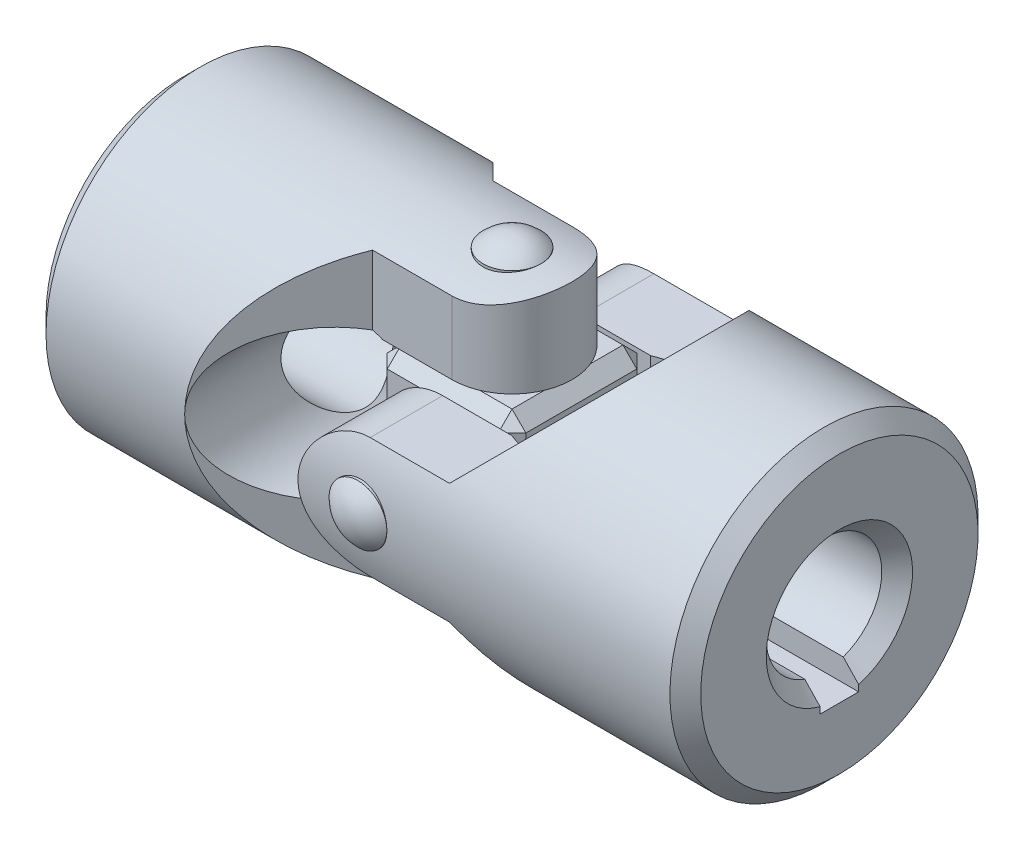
ISO-10303-21;
HEADER;
FILE_DESCRIPTION(('STEP AP214'),'2;1');
FILE_NAME('part.step','',(''),(''),'','','');
FILE_SCHEMA(('AUTOMOTIVE_DESIGN { 1 0 10303 214 1 1 1 1 }'));
ENDSEC;
DATA;
#1=APPLICATION_CONTEXT('core data for automotive mechanical design processes');
#2=APPLICATION_PROTOCOL_DEFINITION('international standard','automotive_design',2000,#1);
#3=PRODUCT_CONTEXT('',#1,'mechanical');
#4=PRODUCT('Part','Part','',(#3));
#5=PRODUCT_RELATED_PRODUCT_CATEGORY('part','',(#4));
#6=PRODUCT_DEFINITION_FORMATION('','',#4);
#7=PRODUCT_DEFINITION_CONTEXT('part definition',#1,'design');
#8=PRODUCT_DEFINITION('design','',#6,#7);
#9=PRODUCT_DEFINITION_SHAPE('','',#8);
#10=(LENGTH_UNIT() NAMED_UNIT(*) SI_UNIT(.MILLI.,.METRE.));
#11=(NAMED_UNIT(*) PLANE_ANGLE_UNIT() SI_UNIT($,.RADIAN.));
#12=(NAMED_UNIT(*) SI_UNIT($,.STERADIAN.) SOLID_ANGLE_UNIT());
#13=UNCERTAINTY_MEASURE_WITH_UNIT(LENGTH_MEASURE(1.E-05),#10,'distance_accuracy_value','');
#14=(GEOMETRIC_REPRESENTATION_CONTEXT(3) GLOBAL_UNCERTAINTY_ASSIGNED_CONTEXT((#13)) GLOBAL_UNIT_ASSIGNED_CONTEXT((#10,
#11,#12)) REPRESENTATION_CONTEXT('',''));
#15=CARTESIAN_POINT('',(0.,0.,0.));
#16=DIRECTION('',(0.,0.,1.));
#17=DIRECTION('',(1.,0.,0.));
#18=AXIS2_PLACEMENT_3D('',#15,#16,#17);
#19=CARTESIAN_POINT('',(0.,8.,0.));
#20=DIRECTION('',(0.,-1.,0.));
#21=DIRECTION('',(-1.,0.,0.));
#22=AXIS2_PLACEMENT_3D('',#19,#20,#21);
#23=CYLINDRICAL_SURFACE('',#22,1.5);
#24=CARTESIAN_POINT('',(0.,8.,0.));
#25=DIRECTION('',(0.,1.,0.));
#26=DIRECTION('',(1.,0.,0.));
#27=AXIS2_PLACEMENT_3D('',#24,#25,#26);
#28=CIRCLE('',#27,1.5);
#29=CARTESIAN_POINT('',(1.5,8.,0.));
#30=VERTEX_POINT('',#29);
#31=EDGE_CURVE('P0_E10',#30,#30,#28,.T.);
#32=ORIENTED_EDGE('',*,*,#31,.F.);
#33=EDGE_LOOP('',(#32));
#34=FACE_BOUND('',#33,.T.);
#35=CARTESIAN_POINT('',(0.,-8.00000000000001,0.));
#36=DIRECTION('',(0.,-1.,0.));
#37=DIRECTION('',(0.,0.,-1.));
#38=AXIS2_PLACEMENT_3D('',#35,#36,#37);
#39=CIRCLE('',#38,1.5);
#40=CARTESIAN_POINT('',(0.,-8.,-1.5));
#41=VERTEX_POINT('',#40);
#42=EDGE_CURVE('P0_E20',#41,#41,#39,.T.);
#43=ORIENTED_EDGE('',*,*,#42,.F.);
#44=EDGE_LOOP('',(#43));
#45=FACE_BOUND('',#44,.T.);
#46=ADVANCED_FACE('P0_F14',(#34,#45),#23,.T.);
#47=CARTESIAN_POINT('',(0.,6.56218750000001,0.));
#48=DIRECTION('',(0.,-1.,0.));
#49=DIRECTION('',(0.,0.,-1.));
#50=AXIS2_PLACEMENT_3D('',#47,#48,#49);
#51=SPHERICAL_SURFACE('',#50,2.07781249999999);
#52=ORIENTED_EDGE('',*,*,#31,.T.);
#53=EDGE_LOOP('',(#52));
#54=FACE_BOUND('',#53,.T.);
#55=ADVANCED_FACE('P0_F29',(#54),#51,.T.);
#56=CARTESIAN_POINT('',(0.,-6.56218750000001,0.));
#57=DIRECTION('',(0.,1.,0.));
#58=DIRECTION('',(0.,0.,-1.));
#59=AXIS2_PLACEMENT_3D('',#56,#57,#58);
#60=SPHERICAL_SURFACE('',#59,2.07781249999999);
#61=ORIENTED_EDGE('',*,*,#42,.T.);
#62=EDGE_LOOP('',(#61));
#63=FACE_BOUND('',#62,.T.);
#64=ADVANCED_FACE('P0_F26',(#63),#60,.T.);
#65=CLOSED_SHELL('',(#46,#55,#64));
#66=MANIFOLD_SOLID_BREP('P0_B1',#65);
#67=CARTESIAN_POINT('',(0.,0.,8.));
#68=DIRECTION('',(0.,0.,-1.));
#69=DIRECTION('',(-1.,0.,0.));
#70=AXIS2_PLACEMENT_3D('',#67,#68,#69);
#71=CYLINDRICAL_SURFACE('',#70,1.5);
#72=CARTESIAN_POINT('',(0.,0.,8.));
#73=DIRECTION('',(0.,0.,1.));
#74=DIRECTION('',(1.,0.,0.));
#75=AXIS2_PLACEMENT_3D('',#72,#73,#74);
#76=CIRCLE('',#75,1.5);
#77=CARTESIAN_POINT('',(1.5,0.,8.));
#78=VERTEX_POINT('',#77);
#79=EDGE_CURVE('P1_E10',#78,#78,#76,.T.);
#80=ORIENTED_EDGE('',*,*,#79,.F.);
#81=EDGE_LOOP('',(#80));
#82=FACE_BOUND('',#81,.T.);
#83=CARTESIAN_POINT('',(0.,0.,-8.00000000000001));
#84=DIRECTION('',(0.,0.,-1.));
#85=DIRECTION('',(0.,1.,0.));
#86=AXIS2_PLACEMENT_3D('',#83,#84,#85);
#87=CIRCLE('',#86,1.5);
#88=CARTESIAN_POINT('',(0.,1.5,-8.));
#89=VERTEX_POINT('',#88);
#90=EDGE_CURVE('P1_E20',#89,#89,#87,.T.);
#91=ORIENTED_EDGE('',*,*,#90,.F.);
#92=EDGE_LOOP('',(#91));
#93=FACE_BOUND('',#92,.T.);
#94=ADVANCED_FACE('P1_F14',(#82,#93),#71,.T.);
#95=CARTESIAN_POINT('',(0.,0.,6.56218750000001));
#96=DIRECTION('',(0.,0.,-1.));
#97=DIRECTION('',(0.,1.,0.));
#98=AXIS2_PLACEMENT_3D('',#95,#96,#97);
#99=SPHERICAL_SURFACE('',#98,2.07781249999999);
#100=ORIENTED_EDGE('',*,*,#79,.T.);
#101=EDGE_LOOP('',(#100));
#102=FACE_BOUND('',#101,.T.);
#103=ADVANCED_FACE('P1_F29',(#102),#99,.T.);
#104=CARTESIAN_POINT('',(0.,0.,-6.56218750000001));
#105=DIRECTION('',(0.,0.,1.));
#106=DIRECTION('',(0.,1.,0.));
#107=AXIS2_PLACEMENT_3D('',#104,#105,#106);
#108=SPHERICAL_SURFACE('',#107,2.07781249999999);
#109=ORIENTED_EDGE('',*,*,#90,.T.);
#110=EDGE_LOOP('',(#109));
#111=FACE_BOUND('',#110,.T.);
#112=ADVANCED_FACE('P1_F26',(#111),#108,.T.);
#113=CLOSED_SHELL('',(#94,#103,#112));
#114=MANIFOLD_SOLID_BREP('P1_B1',#113);
#115=CARTESIAN_POINT('',(0.,-8.,-3.12));
#116=DIRECTION('',(0.,0.,1.));
#117=DIRECTION('',(1.,0.,0.));
#118=AXIS2_PLACEMENT_3D('',#115,#116,#117);
#119=PLANE('',#118);
#120=DIRECTION('',(0.,1.,0.));
#121=VECTOR('',#120,1.);
#122=CARTESIAN_POINT('',(0.,-8.,-3.12));
#123=LINE('',#122,#121);
#124=CARTESIAN_POINT('',(0.,3.6,-3.12));
#125=VERTEX_POINT('',#124);
#126=CARTESIAN_POINT('',(0.,7.36651885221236,-3.12));
#127=VERTEX_POINT('',#126);
#128=EDGE_CURVE('P2_E349',#125,#127,#123,.T.);
#129=ORIENTED_EDGE('',*,*,#128,.F.);
#130=DIRECTION('',(-1.,0.,0.));
#131=VECTOR('',#130,1.);
#132=CARTESIAN_POINT('',(0.,3.6,-3.12));
#133=LINE('',#132,#131);
#134=CARTESIAN_POINT('',(-3.6,3.6,-3.12));
#135=VERTEX_POINT('',#134);
#136=EDGE_CURVE('P2_E179',#125,#135,#133,.T.);
#137=ORIENTED_EDGE('',*,*,#136,.T.);
#138=CARTESIAN_POINT('',(-5.1,0.,-3.12));
#139=DIRECTION('',(0.,0.,1.));
#140=DIRECTION('',(1.,0.,0.));
#141=AXIS2_PLACEMENT_3D('',#138,#139,#140);
#142=CIRCLE('',#141,3.9);
#143=CARTESIAN_POINT('',(-4.12000000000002,3.7748642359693,-3.12));
#144=VERTEX_POINT('',#143);
#145=EDGE_CURVE('P2_E196',#135,#144,#142,.T.);
#146=ORIENTED_EDGE('',*,*,#145,.T.);
#147=DIRECTION('',(0.,1.,0.));
#148=VECTOR('',#147,1.);
#149=CARTESIAN_POINT('',(-4.12000000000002,-8.,-3.12));
#150=LINE('',#149,#148);
#151=CARTESIAN_POINT('',(-4.12000000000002,7.36651885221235,-3.12));
#152=VERTEX_POINT('',#151);
#153=EDGE_CURVE('P2_E356',#144,#152,#150,.T.);
#154=ORIENTED_EDGE('',*,*,#153,.T.);
#155=DIRECTION('',(1.,0.,0.));
#156=VECTOR('',#155,1.);
#157=CARTESIAN_POINT('',(-17.,7.36651885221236,-3.11999999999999));
#158=LINE('',#157,#156);
#159=EDGE_CURVE('P2_E283',#127,#152,#158,.F.);
#160=ORIENTED_EDGE('',*,*,#159,.F.);
#161=EDGE_LOOP('',(#129,#137,#146,#154,#160));
#162=FACE_BOUND('',#161,.T.);
#163=ADVANCED_FACE('P2_F16',(#162),#119,.F.);
#164=CARTESIAN_POINT('',(-4.12000000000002,-8.,-3.12));
#165=DIRECTION('',(-0.707106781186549,0.,0.707106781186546));
#166=DIRECTION('',(0.707106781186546,0.,0.707106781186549));
#167=AXIS2_PLACEMENT_3D('',#164,#165,#166);
#168=PLANE('',#167);
#169=CARTESIAN_POINT('',(-1.00000000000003,0.,0.));
#170=DIRECTION('',(-0.707106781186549,0.,0.707106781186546));
#171=DIRECTION('',(0.707106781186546,0.,0.707106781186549));
#172=AXIS2_PLACEMENT_3D('',#169,#170,#171);
#173=ELLIPSE('',#172,11.3137084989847,8.);
#174=CARTESIAN_POINT('',(-9.00000000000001,0.,-8.));
#175=VERTEX_POINT('',#174);
#176=CARTESIAN_POINT('',(-4.12000000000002,-7.36651885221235,-3.12));
#177=VERTEX_POINT('',#176);
#178=EDGE_CURVE('P2_E286',#175,#177,#173,.T.);
#179=ORIENTED_EDGE('',*,*,#178,.F.);
#180=CARTESIAN_POINT('',(-5.1,0.,-4.09999999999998));
#181=DIRECTION('',(-0.707106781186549,0.,0.707106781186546));
#182=DIRECTION('',(-0.707106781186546,0.,-0.707106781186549));
#183=AXIS2_PLACEMENT_3D('',#180,#181,#182);
#184=ELLIPSE('',#183,5.51543289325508,3.9);
#185=CARTESIAN_POINT('',(-4.12000000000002,-3.77486423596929,-3.12));
#186=VERTEX_POINT('',#185);
#187=EDGE_CURVE('P2_E192',#175,#186,#184,.T.);
#188=ORIENTED_EDGE('',*,*,#187,.T.);
#189=EDGE_CURVE('P2_E353',#177,#186,#150,.T.);
#190=ORIENTED_EDGE('',*,*,#189,.F.);
#191=EDGE_LOOP('',(#179,#188,#190));
#192=FACE_BOUND('',#191,.T.);
#193=ADVANCED_FACE('P2_F234',(#192),#168,.F.);
#194=CARTESIAN_POINT('',(-4.12000000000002,-8.,3.12));
#195=DIRECTION('',(-0.707106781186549,0.,-0.707106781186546));
#196=DIRECTION('',(-0.707106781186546,0.,0.707106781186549));
#197=AXIS2_PLACEMENT_3D('',#194,#195,#196);
#198=PLANE('',#197);
#199=DIRECTION('',(0.,1.,0.));
#200=VECTOR('',#199,1.);
#201=CARTESIAN_POINT('',(-4.12000000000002,-8.,3.12));
#202=LINE('',#201,#200);
#203=CARTESIAN_POINT('',(-4.12000000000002,-7.36651885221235,3.12));
#204=VERTEX_POINT('',#203);
#205=CARTESIAN_POINT('',(-4.12000000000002,-3.77486423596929,3.12));
#206=VERTEX_POINT('',#205);
#207=EDGE_CURVE('P2_E359',#204,#206,#202,.T.);
#208=ORIENTED_EDGE('',*,*,#207,.T.);
#209=CARTESIAN_POINT('',(-5.1,0.,4.09999999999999));
#210=DIRECTION('',(-0.707106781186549,0.,-0.707106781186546));
#211=DIRECTION('',(0.707106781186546,0.,-0.707106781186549));
#212=AXIS2_PLACEMENT_3D('',#209,#210,#211);
#213=ELLIPSE('',#212,5.51543289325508,3.9);
#214=CARTESIAN_POINT('',(-9.,0.,8.));
#215=VERTEX_POINT('',#214);
#216=EDGE_CURVE('P2_E188',#206,#215,#213,.T.);
#217=ORIENTED_EDGE('',*,*,#216,.T.);
#218=CARTESIAN_POINT('',(-1.00000000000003,0.,0.));
#219=DIRECTION('',(-0.707106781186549,0.,-0.707106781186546));
#220=DIRECTION('',(0.707106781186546,0.,-0.707106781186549));
#221=AXIS2_PLACEMENT_3D('',#218,#219,#220);
#222=ELLIPSE('',#221,11.3137084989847,8.);
#223=EDGE_CURVE('P2_E297',#204,#215,#222,.T.);
#224=ORIENTED_EDGE('',*,*,#223,.F.);
#225=EDGE_LOOP('',(#208,#217,#224));
#226=FACE_BOUND('',#225,.T.);
#227=ADVANCED_FACE('P2_F239',(#226),#198,.F.);
#228=CARTESIAN_POINT('',(0.,-8.,3.12));
#229=DIRECTION('',(0.,0.,-1.));
#230=DIRECTION('',(-1.,0.,0.));
#231=AXIS2_PLACEMENT_3D('',#228,#229,#230);
#232=PLANE('',#231);
#233=CARTESIAN_POINT('',(-5.1,0.,3.12));
#234=DIRECTION('',(0.,0.,-1.));
#235=DIRECTION('',(-1.,0.,0.));
#236=AXIS2_PLACEMENT_3D('',#233,#234,#235);
#237=CIRCLE('',#236,3.9);
#238=CARTESIAN_POINT('',(-4.12000000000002,3.7748642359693,3.12));
#239=VERTEX_POINT('',#238);
#240=CARTESIAN_POINT('',(-3.6,3.6,3.12));
#241=VERTEX_POINT('',#240);
#242=EDGE_CURVE('P2_E311',#239,#241,#237,.T.);
#243=ORIENTED_EDGE('',*,*,#242,.T.);
#244=DIRECTION('',(1.,0.,0.));
#245=VECTOR('',#244,1.);
#246=CARTESIAN_POINT('',(0.,3.6,3.12));
#247=LINE('',#246,#245);
#248=CARTESIAN_POINT('',(0.,3.6,3.12));
#249=VERTEX_POINT('',#248);
#250=EDGE_CURVE('P2_E176',#241,#249,#247,.T.);
#251=ORIENTED_EDGE('',*,*,#250,.T.);
#252=DIRECTION('',(0.,1.,0.));
#253=VECTOR('',#252,1.);
#254=CARTESIAN_POINT('',(0.,-8.,3.12));
#255=LINE('',#254,#253);
#256=CARTESIAN_POINT('',(0.,7.36651885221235,3.12));
#257=VERTEX_POINT('',#256);
#258=EDGE_CURVE('P2_E204',#249,#257,#255,.T.);
#259=ORIENTED_EDGE('',*,*,#258,.T.);
#260=DIRECTION('',(1.,0.,0.));
#261=VECTOR('',#260,1.);
#262=CARTESIAN_POINT('',(-17.,7.36651885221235,3.12));
#263=LINE('',#262,#261);
#264=CARTESIAN_POINT('',(-4.12000000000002,7.36651885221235,3.12));
#265=VERTEX_POINT('',#264);
#266=EDGE_CURVE('P2_E300',#265,#257,#263,.T.);
#267=ORIENTED_EDGE('',*,*,#266,.F.);
#268=EDGE_CURVE('P2_E361',#239,#265,#202,.T.);
#269=ORIENTED_EDGE('',*,*,#268,.F.);
#270=EDGE_LOOP('',(#243,#251,#259,#267,#269));
#271=FACE_BOUND('',#270,.T.);
#272=ADVANCED_FACE('P2_F243',(#271),#232,.F.);
#273=CARTESIAN_POINT('',(0.,-8.,0.));
#274=DIRECTION('',(0.,1.,0.));
#275=DIRECTION('',(0.,0.,-1.));
#276=AXIS2_PLACEMENT_3D('',#273,#274,#275);
#277=CYLINDRICAL_SURFACE('',#276,3.12);
#278=ORIENTED_EDGE('',*,*,#258,.F.);
#279=CARTESIAN_POINT('',(0.,3.6,0.));
#280=DIRECTION('',(0.,1.,0.));
#281=DIRECTION('',(1.,0.,0.));
#282=AXIS2_PLACEMENT_3D('',#279,#280,#281);
#283=CIRCLE('',#282,3.12);
#284=EDGE_CURVE('P2_E305',#249,#125,#283,.T.);
#285=ORIENTED_EDGE('',*,*,#284,.T.);
#286=ORIENTED_EDGE('',*,*,#128,.T.);
#287=CARTESIAN_POINT('',(0.,7.36651885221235,3.12));
#288=CARTESIAN_POINT('',(0.0841298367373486,7.36650219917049,3.12001225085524));
#289=CARTESIAN_POINT('',(0.168250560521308,7.36795966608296,3.11659751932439));
#290=CARTESIAN_POINT('',(0.335817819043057,7.37369848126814,3.10300979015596));
#291=CARTESIAN_POINT('',(0.419264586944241,7.3779788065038,3.09283924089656));
#292=CARTESIAN_POINT('',(0.584577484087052,7.38921791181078,3.06588637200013));
#293=CARTESIAN_POINT('',(0.666448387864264,7.39616652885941,3.04912913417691));
#294=CARTESIAN_POINT('',(0.82833886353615,7.41250623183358,3.00918837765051));
#295=CARTESIAN_POINT('',(0.908358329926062,7.42189745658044,2.98600449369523));
#296=CARTESIAN_POINT('',(1.14467049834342,7.45329488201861,2.90716814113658));
#297=CARTESIAN_POINT('',(1.29753196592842,7.4785479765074,2.84217884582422));
#298=CARTESIAN_POINT('',(1.59024083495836,7.53483377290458,2.68940034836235));
#299=CARTESIAN_POINT('',(1.7300764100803,7.56587165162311,2.60159069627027));
#300=CARTESIAN_POINT('',(2.00027653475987,7.63208526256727,2.4006217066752));
#301=CARTESIAN_POINT('',(2.12984795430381,7.66738890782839,2.28643591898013));
#302=CARTESIAN_POINT('',(2.36856057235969,7.73709353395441,2.03813582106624));
#303=CARTESIAN_POINT('',(2.47769767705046,7.77149433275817,1.90401752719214));
#304=CARTESIAN_POINT('',(2.67639758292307,7.83706373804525,1.61350176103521));
#305=CARTESIAN_POINT('',(2.76507948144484,7.86806414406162,1.45646034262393));
#306=CARTESIAN_POINT('',(2.91442643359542,7.92178029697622,1.12826644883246));
#307=CARTESIAN_POINT('',(2.9751026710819,7.94449935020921,0.957119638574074));
#308=CARTESIAN_POINT('',(3.06388199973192,7.97818045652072,0.613973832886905));
#309=CARTESIAN_POINT('',(3.09336257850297,7.98963794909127,0.442380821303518));
#310=CARTESIAN_POINT('',(3.1233405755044,8.00129067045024,0.0963230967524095));
#311=CARTESIAN_POINT('',(3.12384770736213,8.00148967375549,-0.0781406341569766));
#312=CARTESIAN_POINT('',(3.09663745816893,7.99090954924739,-0.415061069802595));
#313=CARTESIAN_POINT('',(3.07042705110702,7.98071656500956,-0.577661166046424));
#314=CARTESIAN_POINT('',(2.99307825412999,7.95127943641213,-0.895941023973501));
#315=CARTESIAN_POINT('',(2.94193844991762,7.93203477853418,-1.05162039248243));
#316=CARTESIAN_POINT('',(2.8155466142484,7.8860255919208,-1.3544078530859));
#317=CARTESIAN_POINT('',(2.73994662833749,7.85915327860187,-1.50135364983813));
#318=CARTESIAN_POINT('',(2.56710076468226,7.80057698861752,-1.78084804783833));
#319=CARTESIAN_POINT('',(2.4698474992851,7.76887136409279,-1.91339171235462));
#320=CARTESIAN_POINT('',(2.24932949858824,7.70151949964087,-2.16914086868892));
#321=CARTESIAN_POINT('',(2.12481611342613,7.66575082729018,-2.29123967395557));
#322=CARTESIAN_POINT('',(1.85692467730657,7.59585654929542,-2.51327282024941));
#323=CARTESIAN_POINT('',(1.7135385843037,7.56173165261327,-2.61319766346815));
#324=CARTESIAN_POINT('',(1.40704221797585,7.49816265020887,-2.79046703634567));
#325=CARTESIAN_POINT('',(1.2435134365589,7.46886469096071,-2.86715100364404));
#326=CARTESIAN_POINT('',(0.989492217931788,7.43220202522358,-2.96031535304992));
#327=CARTESIAN_POINT('',(0.903384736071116,7.42119688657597,-2.98772272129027));
#328=CARTESIAN_POINT('',(0.728837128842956,7.40197916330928,-3.03502181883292));
#329=CARTESIAN_POINT('',(0.640398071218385,7.39376532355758,-3.0549169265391));
#330=CARTESIAN_POINT('',(0.460382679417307,7.38033758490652,-3.0872230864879));
#331=CARTESIAN_POINT('',(0.36877857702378,7.37517689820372,-3.09950155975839));
#332=CARTESIAN_POINT('',(0.184786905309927,7.36825672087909,-3.11589587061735));
#333=CARTESIAN_POINT('',(0.0923999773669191,7.36649467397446,-3.12001784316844));
#334=CARTESIAN_POINT('',(0.,7.36651885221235,-3.12));
#335=B_SPLINE_CURVE_WITH_KNOTS('',3,(#287,#288,#289,#290,#291,#292,#293,#294,#295,#296,#297,
#298,#299,#300,#301,#302,#303,#304,#305,#306,#307,#308,#309,#310,#311,#312,#313,#314,#315,#316,
#317,#318,#319,#320,#321,#322,#323,#324,#325,#326,#327,#328,#329,#330,#331,#332,#333,#334),
.UNSPECIFIED.,.F.,.F.,(4,2,2,2,2,2,2,2,2,2,2,2,2,2,2,2,2,2,2,2,2,2,2,4),(0.,0.25229240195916,
0.504493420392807,0.755743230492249,1.00700732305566,1.50858722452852,2.01061816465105,
2.53710332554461,3.063693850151,3.60990605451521,4.15589994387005,4.67662602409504,
5.19717752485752,5.68990882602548,6.18266808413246,6.68277023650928,7.18304327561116,
7.71468566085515,8.24655532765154,8.79236697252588,9.06514659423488,9.33780339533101,
9.61508200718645,9.89215198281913),.UNSPECIFIED.);
#336=EDGE_CURVE('P2_E258',#257,#127,#335,.T.);
#337=ORIENTED_EDGE('',*,*,#336,.F.);
#338=EDGE_LOOP('',(#278,#285,#286,#337));
#339=FACE_BOUND('',#338,.T.);
#340=ADVANCED_FACE('P2_F247',(#339),#277,.T.);
#341=CARTESIAN_POINT('',(-17.,0.,0.));
#342=DIRECTION('',(-1.,0.,0.));
#343=DIRECTION('',(0.,0.,1.));
#344=AXIS2_PLACEMENT_3D('',#341,#342,#343);
#345=PLANE('',#344);
#346=DIRECTION('',(0.,0.,1.));
#347=VECTOR('',#346,1.);
#348=CARTESIAN_POINT('',(-17.,-1.,-4.));
#349=LINE('',#348,#347);
#350=CARTESIAN_POINT('',(-17.,-1.,-4.));
#351=VERTEX_POINT('',#350);
#352=CARTESIAN_POINT('',(-17.,-1.,-3.66606055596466));
#353=VERTEX_POINT('',#352);
#354=EDGE_CURVE('P2_E139',#351,#353,#349,.T.);
#355=ORIENTED_EDGE('',*,*,#354,.F.);
#356=DIRECTION('',(0.,-1.,0.));
#357=VECTOR('',#356,1.);
#358=CARTESIAN_POINT('',(-17.,-1.,-4.));
#359=LINE('',#358,#357);
#360=CARTESIAN_POINT('',(-17.,1.,-4.));
#361=VERTEX_POINT('',#360);
#362=EDGE_CURVE('P2_E135',#361,#351,#359,.T.);
#363=ORIENTED_EDGE('',*,*,#362,.F.);
#364=DIRECTION('',(0.,0.,-1.));
#365=VECTOR('',#364,1.);
#366=CARTESIAN_POINT('',(-17.,1.,-4.));
#367=LINE('',#366,#365);
#368=CARTESIAN_POINT('',(-17.,1.,-3.66606055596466));
#369=VERTEX_POINT('',#368);
#370=EDGE_CURVE('P2_E142',#369,#361,#367,.T.);
#371=ORIENTED_EDGE('',*,*,#370,.F.);
#372=CARTESIAN_POINT('',(-17.,0.,0.));
#373=DIRECTION('',(-1.,0.,0.));
#374=DIRECTION('',(0.,0.,1.));
#375=AXIS2_PLACEMENT_3D('',#372,#373,#374);
#376=CIRCLE('',#375,3.79999999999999);
#377=EDGE_CURVE('P2_E318',#369,#353,#376,.F.);
#378=ORIENTED_EDGE('',*,*,#377,.T.);
#379=EDGE_LOOP('',(#355,#363,#371,#378));
#380=FACE_BOUND('',#379,.T.);
#381=CARTESIAN_POINT('',(-17.,0.,0.));
#382=DIRECTION('',(-1.,0.,0.));
#383=DIRECTION('',(0.,0.,1.));
#384=AXIS2_PLACEMENT_3D('',#381,#382,#383);
#385=CIRCLE('',#384,7.2);
#386=CARTESIAN_POINT('',(-17.,0.,7.2));
#387=VERTEX_POINT('',#386);
#388=EDGE_CURVE('P2_E315',#387,#387,#385,.T.);
#389=ORIENTED_EDGE('',*,*,#388,.T.);
#390=EDGE_LOOP('',(#389));
#391=FACE_BOUND('',#390,.T.);
#392=ADVANCED_FACE('P2_F149',(#380,#391),#345,.T.);
#393=CARTESIAN_POINT('',(-17.,0.,0.));
#394=DIRECTION('',(1.,0.,0.));
#395=DIRECTION('',(0.,0.,-1.));
#396=AXIS2_PLACEMENT_3D('',#393,#394,#395);
#397=CYLINDRICAL_SURFACE('',#396,8.);
#398=CARTESIAN_POINT('',(-16.2,0.,0.));
#399=DIRECTION('',(-1.,0.,0.));
#400=DIRECTION('',(0.,0.,1.));
#401=AXIS2_PLACEMENT_3D('',#398,#399,#400);
#402=CIRCLE('',#401,8.);
#403=CARTESIAN_POINT('',(-16.2,0.,8.));
#404=VERTEX_POINT('',#403);
#405=EDGE_CURVE('P2_E320',#404,#404,#402,.F.);
#406=ORIENTED_EDGE('',*,*,#405,.T.);
#407=EDGE_LOOP('',(#406));
#408=FACE_BOUND('',#407,.T.);
#409=CARTESIAN_POINT('',(1.5,-8.,0.));
#410=CARTESIAN_POINT('',(1.49999681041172,-7.99999848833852,-0.0834717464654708));
#411=CARTESIAN_POINT('',(1.49300892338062,-7.99868009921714,-0.166984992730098));
#412=CARTESIAN_POINT('',(1.46526000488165,-7.9935478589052,-0.331658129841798));
#413=CARTESIAN_POINT('',(1.44448734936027,-7.98973190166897,-0.412815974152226));
#414=CARTESIAN_POINT('',(1.38982729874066,-7.98003138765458,-0.570372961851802));
#415=CARTESIAN_POINT('',(1.35595174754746,-7.97414869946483,-0.646776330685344));
#416=CARTESIAN_POINT('',(1.27608112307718,-7.96095710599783,-0.792807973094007));
#417=CARTESIAN_POINT('',(1.23008703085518,-7.9536483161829,-0.862436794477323));
#418=CARTESIAN_POINT('',(1.12670023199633,-7.93831336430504,-0.993783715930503));
#419=CARTESIAN_POINT('',(1.06919055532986,-7.93028034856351,-1.05540895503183));
#420=CARTESIAN_POINT('',(0.94465669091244,-7.9144531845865,-1.16819606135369));
#421=CARTESIAN_POINT('',(0.877631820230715,-7.90665905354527,-1.21935717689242));
#422=CARTESIAN_POINT('',(0.73531391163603,-7.89212551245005,-1.31014998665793));
#423=CARTESIAN_POINT('',(0.659959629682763,-7.88539493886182,-1.34968721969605));
#424=CARTESIAN_POINT('',(0.50353108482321,-7.87384713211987,-1.41550524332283));
#425=CARTESIAN_POINT('',(0.422457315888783,-7.86902973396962,-1.44178717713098));
#426=CARTESIAN_POINT('',(0.257884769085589,-7.8619226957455,-1.480050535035));
#427=CARTESIAN_POINT('',(0.174424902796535,-7.85960445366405,-1.49219390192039));
#428=CARTESIAN_POINT('',(0.0066226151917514,-7.85767197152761,-1.50233808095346));
#429=CARTESIAN_POINT('',(-0.0777197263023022,-7.8580574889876,-1.50034016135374));
#430=CARTESIAN_POINT('',(-0.243719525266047,-7.86146292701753,-1.48238979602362));
#431=CARTESIAN_POINT('',(-0.325397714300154,-7.86444808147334,-1.46662149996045));
#432=CARTESIAN_POINT('',(-0.484928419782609,-7.87266183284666,-1.42186799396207));
#433=CARTESIAN_POINT('',(-0.562780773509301,-7.87789052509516,-1.39288222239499));
#434=CARTESIAN_POINT('',(-0.712988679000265,-7.89003855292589,-1.322336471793));
#435=CARTESIAN_POINT('',(-0.785308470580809,-7.89696783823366,-1.28070213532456));
#436=CARTESIAN_POINT('',(-0.922004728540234,-7.91172971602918,-1.18609368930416));
#437=CARTESIAN_POINT('',(-0.986380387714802,-7.91956240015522,-1.13311842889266));
#438=CARTESIAN_POINT('',(-1.10642495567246,-7.93540001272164,-1.01633905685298));
#439=CARTESIAN_POINT('',(-1.16194065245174,-7.94340571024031,-0.952377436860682));
#440=CARTESIAN_POINT('',(-1.26147724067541,-7.95857386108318,-0.815968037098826));
#441=CARTESIAN_POINT('',(-1.30549801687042,-7.96573630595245,-0.743520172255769));
#442=CARTESIAN_POINT('',(-1.38081775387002,-7.97842539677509,-0.592034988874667));
#443=CARTESIAN_POINT('',(-1.4121007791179,-7.98394999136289,-0.512989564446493));
#444=CARTESIAN_POINT('',(-1.46090209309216,-7.99272505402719,-0.350639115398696));
#445=CARTESIAN_POINT('',(-1.47842184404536,-7.99597576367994,-0.267334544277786));
#446=CARTESIAN_POINT('',(-1.49898603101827,-7.99980360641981,-0.100148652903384));
#447=CARTESIAN_POINT('',(-1.50224039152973,-8.00041950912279,-0.0162940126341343));
#448=CARTESIAN_POINT('',(-1.49474452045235,-7.99901543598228,0.150761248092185));
#449=CARTESIAN_POINT('',(-1.48399497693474,-7.99699558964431,0.233961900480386));
#450=CARTESIAN_POINT('',(-1.44897096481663,-7.99057111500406,0.396681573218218));
#451=CARTESIAN_POINT('',(-1.42480271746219,-7.98618522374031,0.476224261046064));
#452=CARTESIAN_POINT('',(-1.36374229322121,-7.97551842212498,0.630128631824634));
#453=CARTESIAN_POINT('',(-1.32684925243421,-7.96923738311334,0.704489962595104));
#454=CARTESIAN_POINT('',(-1.24092187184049,-7.95538030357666,0.846816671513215));
#455=CARTESIAN_POINT('',(-1.19175926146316,-7.94779086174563,0.914703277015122));
#456=CARTESIAN_POINT('',(-1.08286186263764,-7.93219343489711,1.04133832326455));
#457=CARTESIAN_POINT('',(-1.02312608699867,-7.92418541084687,1.10008590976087));
#458=CARTESIAN_POINT('',(-0.893827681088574,-7.9085247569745,1.20757295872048));
#459=CARTESIAN_POINT('',(-0.824145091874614,-7.90087825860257,1.25616916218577));
#460=CARTESIAN_POINT('',(-0.677482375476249,-7.88692985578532,1.34096675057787));
#461=CARTESIAN_POINT('',(-0.600502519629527,-7.8806279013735,1.37716859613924));
#462=CARTESIAN_POINT('',(-0.441794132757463,-7.87013024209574,1.43594673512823));
#463=CARTESIAN_POINT('',(-0.360090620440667,-7.86592440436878,1.45858868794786));
#464=CARTESIAN_POINT('',(-0.193952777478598,-7.86007203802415,1.48980679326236));
#465=CARTESIAN_POINT('',(-0.109518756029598,-7.8584252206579,1.49838453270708));
#466=CARTESIAN_POINT('',(0.0582483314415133,-7.85789199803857,1.50117762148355));
#467=CARTESIAN_POINT('',(0.141577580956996,-7.85896215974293,1.49561895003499));
#468=CARTESIAN_POINT('',(0.306091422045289,-7.86364600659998,1.47079175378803));
#469=CARTESIAN_POINT('',(0.387276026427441,-7.86725967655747,1.45152331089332));
#470=CARTESIAN_POINT('',(0.545074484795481,-7.8766050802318,1.39991887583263));
#471=CARTESIAN_POINT('',(0.62169659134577,-7.88233284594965,1.36760735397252));
#472=CARTESIAN_POINT('',(0.768468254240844,-7.8952638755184,1.29085868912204));
#473=CARTESIAN_POINT('',(0.838617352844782,-7.90246724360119,1.24642068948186));
#474=CARTESIAN_POINT('',(0.971583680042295,-7.91767266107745,1.14589487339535));
#475=CARTESIAN_POINT('',(1.0342754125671,-7.92568505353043,1.08964259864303));
#476=CARTESIAN_POINT('',(1.14940516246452,-7.94152833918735,0.96742792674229));
#477=CARTESIAN_POINT('',(1.20184082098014,-7.94935919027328,0.901463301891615));
#478=CARTESIAN_POINT('',(1.29541095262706,-7.96403975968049,0.760984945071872));
#479=CARTESIAN_POINT('',(1.33643942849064,-7.97088000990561,0.686399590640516));
#480=CARTESIAN_POINT('',(1.40531763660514,-7.98271619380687,0.531290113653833));
#481=CARTESIAN_POINT('',(1.43317974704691,-7.98771385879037,0.450771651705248));
#482=CARTESIAN_POINT('',(1.46927731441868,-7.99428290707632,0.308347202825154));
#483=CARTESIAN_POINT('',(1.4807786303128,-7.99641470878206,0.24727381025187));
#484=CARTESIAN_POINT('',(1.49614106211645,-7.9992737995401,0.124141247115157));
#485=CARTESIAN_POINT('',(1.50000237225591,-8.00000112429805,0.0620821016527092));
#486=CARTESIAN_POINT('',(1.5,-8.,0.));
#487=B_SPLINE_CURVE_WITH_KNOTS('',3,(#409,#410,#411,#412,#413,#414,#415,#416,#417,#418,#419,
#420,#421,#422,#423,#424,#425,#426,#427,#428,#429,#430,#431,#432,#433,#434,#435,#436,#437,#438,
#439,#440,#441,#442,#443,#444,#445,#446,#447,#448,#449,#450,#451,#452,#453,#454,#455,#456,#457,
#458,#459,#460,#461,#462,#463,#464,#465,#466,#467,#468,#469,#470,#471,#472,#473,#474,#475,#476,
#477,#478,#479,#480,#481,#482,#483,#484,#485,#486),.UNSPECIFIED.,.T.,.F.,(4,2,2,2,2,2,2,2,2,2,2,
2,2,2,2,2,2,2,2,2,2,2,2,2,2,2,2,2,2,2,2,2,2,2,2,2,2,2,4),(0.,0.250188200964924,
0.500587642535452,0.750761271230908,1.00091465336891,1.25375118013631,1.50660586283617,
1.76146190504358,2.01629596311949,2.26818151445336,2.52004447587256,2.76859000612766,
3.01714609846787,3.26719262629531,3.5172645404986,3.77127768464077,4.02529337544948,
4.27962588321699,4.53393136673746,4.78448174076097,5.03501980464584,5.28360233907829,
5.53220175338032,5.78351778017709,6.03485728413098,6.28953436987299,6.54420198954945,
6.79762627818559,7.05102196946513,7.30039252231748,7.54976158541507,7.79866496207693,
8.04758592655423,8.30023369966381,8.55293951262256,8.80792048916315,9.06266126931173,
9.2487434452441,9.43482089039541),.UNSPECIFIED.);
#488=CARTESIAN_POINT('',(1.5,-8.,0.));
#489=VERTEX_POINT('',#488);
#490=EDGE_CURVE('P2_E278',#489,#489,#487,.T.);
#491=ORIENTED_EDGE('',*,*,#490,.T.);
#492=EDGE_LOOP('',(#491));
#493=FACE_BOUND('',#492,.T.);
#494=CARTESIAN_POINT('',(0.,7.85811682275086,-1.5));
#495=CARTESIAN_POINT('',(0.0834572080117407,7.85811843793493,-1.49999679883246));
#496=CARTESIAN_POINT('',(0.166955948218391,7.85946079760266,-1.49301126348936));
#497=CARTESIAN_POINT('',(0.331598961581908,7.86467851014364,-1.46527253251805));
#498=CARTESIAN_POINT('',(0.412741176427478,7.86855601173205,-1.44450765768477));
#499=CARTESIAN_POINT('',(0.570265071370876,7.87838976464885,-1.38987035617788));
#500=CARTESIAN_POINT('',(0.646651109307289,7.88434407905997,-1.35601013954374));
#501=CARTESIAN_POINT('',(0.792653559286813,7.89765826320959,-1.27617565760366));
#502=CARTESIAN_POINT('',(0.862270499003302,7.90501802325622,-1.23020233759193));
#503=CARTESIAN_POINT('',(0.993630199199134,7.92041614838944,-1.12683678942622));
#504=CARTESIAN_POINT('',(1.05527648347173,7.92846116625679,-1.06932292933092));
#505=CARTESIAN_POINT('',(1.16810438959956,7.94426457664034,-0.944771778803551));
#506=CARTESIAN_POINT('',(1.2192853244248,7.95202295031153,-0.877733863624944));
#507=CARTESIAN_POINT('',(1.31009937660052,7.96645017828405,-0.735403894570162));
#508=CARTESIAN_POINT('',(1.34964153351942,7.97311028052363,-0.660052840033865));
#509=CARTESIAN_POINT('',(1.41546954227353,7.98451608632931,-0.503631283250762));
#510=CARTESIAN_POINT('',(1.44175648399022,7.98926194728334,-0.422561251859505));
#511=CARTESIAN_POINT('',(1.48002954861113,7.99625755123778,-0.258002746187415));
#512=CARTESIAN_POINT('',(1.49217830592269,7.99853565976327,-0.174553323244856));
#513=CARTESIAN_POINT('',(1.5023368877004,8.00043684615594,-0.00677167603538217));
#514=CARTESIAN_POINT('',(1.50034791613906,8.00006015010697,0.0775604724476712));
#515=CARTESIAN_POINT('',(1.48241222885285,7.99671633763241,0.243598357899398));
#516=CARTESIAN_POINT('',(1.46664063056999,7.99378172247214,0.32532376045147));
#517=CARTESIAN_POINT('',(1.42186435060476,7.98568826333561,0.484947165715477));
#518=CARTESIAN_POINT('',(1.3928591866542,7.98052933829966,0.562845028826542));
#519=CARTESIAN_POINT('',(1.3222722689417,7.96851260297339,0.713110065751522));
#520=CARTESIAN_POINT('',(1.2806205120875,7.96164537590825,0.785443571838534));
#521=CARTESIAN_POINT('',(1.18597433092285,7.9469714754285,0.922159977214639));
#522=CARTESIAN_POINT('',(1.13297875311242,7.93916470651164,0.986542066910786));
#523=CARTESIAN_POINT('',(1.01618429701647,7.92333513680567,1.10656561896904));
#524=CARTESIAN_POINT('',(0.952232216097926,7.91531085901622,1.16205790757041));
#525=CARTESIAN_POINT('',(0.815850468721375,7.90006508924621,1.26155171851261));
#526=CARTESIAN_POINT('',(0.743420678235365,7.89284360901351,1.30555307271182));
#527=CARTESIAN_POINT('',(0.591941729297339,7.88001893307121,1.38085852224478));
#528=CARTESIAN_POINT('',(0.512881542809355,7.87441850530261,1.41214093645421));
#529=CARTESIAN_POINT('',(0.350498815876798,7.86551242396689,1.46093656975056));
#530=CARTESIAN_POINT('',(0.267176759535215,7.8622065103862,1.47845134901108));
#531=CARTESIAN_POINT('',(0.0999806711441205,7.85831520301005,1.49899672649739));
#532=CARTESIAN_POINT('',(0.0161338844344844,7.85768955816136,1.50224164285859));
#533=CARTESIAN_POINT('',(-0.150903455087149,7.8591219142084,1.49472968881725));
#534=CARTESIAN_POINT('',(-0.234094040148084,7.86117978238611,1.48397351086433));
#535=CARTESIAN_POINT('',(-0.396752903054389,7.86770980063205,1.44894868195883));
#536=CARTESIAN_POINT('',(-0.476246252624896,7.87216186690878,1.4247923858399));
#537=CARTESIAN_POINT('',(-0.630057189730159,7.88296134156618,1.3637722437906));
#538=CARTESIAN_POINT('',(-0.704374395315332,7.88930888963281,1.32690746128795));
#539=CARTESIAN_POINT('',(-0.84666761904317,7.90327577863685,1.2410235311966));
#540=CARTESIAN_POINT('',(-0.914560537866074,7.91090895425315,1.19186899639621));
#541=CARTESIAN_POINT('',(-1.04121204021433,7.926548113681,1.08298344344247));
#542=CARTESIAN_POINT('',(-1.09996980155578,7.93455413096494,1.02325147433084));
#543=CARTESIAN_POINT('',(-1.20748376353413,7.95016624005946,0.893949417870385));
#544=CARTESIAN_POINT('',(-1.25609582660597,7.95776555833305,0.82425853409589));
#545=CARTESIAN_POINT('',(-1.34092120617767,7.97159404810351,0.67757452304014));
#546=CARTESIAN_POINT('',(-1.37713500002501,7.97782327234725,0.600581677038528));
#547=CARTESIAN_POINT('',(-1.43592009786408,7.98818057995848,0.441877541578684));
#548=CARTESIAN_POINT('',(-1.45856218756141,7.99231954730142,0.360193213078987));
#549=CARTESIAN_POINT('',(-1.48978704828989,7.99807642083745,0.194096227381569));
#550=CARTESIAN_POINT('',(-1.49837129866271,7.99969459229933,0.10968385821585));
#551=CARTESIAN_POINT('',(-1.50118530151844,8.00022227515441,-0.0580907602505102));
#552=CARTESIAN_POINT('',(-1.49563275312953,7.99917286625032,-0.141449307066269));
#553=CARTESIAN_POINT('',(-1.47080757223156,7.99456866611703,-0.306023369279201));
#554=CARTESIAN_POINT('',(-1.45153507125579,7.99101389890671,-0.387238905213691));
#555=CARTESIAN_POINT('',(-1.39990879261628,7.98179837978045,-0.545106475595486));
#556=CARTESIAN_POINT('',(-1.36757818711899,7.97614135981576,-0.621766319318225));
#557=CARTESIAN_POINT('',(-1.29077954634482,7.96333372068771,-0.768605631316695));
#558=CARTESIAN_POINT('',(-1.24631069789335,7.95618300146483,-0.838784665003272));
#559=CARTESIAN_POINT('',(-1.14574854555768,7.94104779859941,-0.971755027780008));
#560=CARTESIAN_POINT('',(-1.08949796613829,7.93305284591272,-1.03442623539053));
#561=CARTESIAN_POINT('',(-0.967295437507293,7.91719633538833,-1.14951536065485));
#562=CARTESIAN_POINT('',(-0.90134120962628,7.90933480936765,-1.2019308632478));
#563=CARTESIAN_POINT('',(-0.760873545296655,7.89455577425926,-1.29547633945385));
#564=CARTESIAN_POINT('',(-0.686286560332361,7.88764767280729,-1.33649740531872));
#565=CARTESIAN_POINT('',(-0.531174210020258,7.87567084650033,-1.40536132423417));
#566=CARTESIAN_POINT('',(-0.450654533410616,7.87060038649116,-1.43321661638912));
#567=CARTESIAN_POINT('',(-0.308247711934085,7.86393016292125,-1.46929726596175));
#568=CARTESIAN_POINT('',(-0.247194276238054,7.86176310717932,-1.48079105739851));
#569=CARTESIAN_POINT('',(-0.124101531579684,7.85885585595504,-1.49614351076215));
#570=CARTESIAN_POINT('',(-0.0620622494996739,7.85811562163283,-1.50000238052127));
#571=CARTESIAN_POINT('',(0.,7.85811682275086,-1.5));
#572=B_SPLINE_CURVE_WITH_KNOTS('',3,(#494,#495,#496,#497,#498,#499,#500,#501,#502,#503,#504,
#505,#506,#507,#508,#509,#510,#511,#512,#513,#514,#515,#516,#517,#518,#519,#520,#521,#522,#523,
#524,#525,#526,#527,#528,#529,#530,#531,#532,#533,#534,#535,#536,#537,#538,#539,#540,#541,#542,
#543,#544,#545,#546,#547,#548,#549,#550,#551,#552,#553,#554,#555,#556,#557,#558,#559,#560,#561,
#562,#563,#564,#565,#566,#567,#568,#569,#570,#571),.UNSPECIFIED.,.T.,.F.,(4,2,2,2,2,2,2,2,2,2,2,
2,2,2,2,2,2,2,2,2,2,2,2,2,2,2,2,2,2,2,2,2,2,2,2,2,2,2,4),(0.,0.250144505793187,
0.500501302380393,0.750625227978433,1.00072963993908,1.25362335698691,1.50653367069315,
1.76137104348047,2.0161874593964,2.26804275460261,2.51987660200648,2.76855650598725,
3.01724547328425,3.26733691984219,3.51745380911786,3.77140614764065,4.025362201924,
4.27974936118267,4.53410768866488,4.78463248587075,5.03514489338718,5.28358792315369,
5.53204926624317,5.78337862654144,6.03473059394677,6.28944125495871,6.54414210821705,
6.79750269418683,7.05083661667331,7.30029300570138,7.54974700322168,7.79876026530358,
8.0477902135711,8.30038464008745,8.55303847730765,8.80803001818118,9.06278015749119,
9.24880307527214,9.43482092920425),.UNSPECIFIED.);
#573=CARTESIAN_POINT('',(0.,7.85811682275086,-1.5));
#574=VERTEX_POINT('',#573);
#575=EDGE_CURVE('P2_E273',#574,#574,#572,.T.);
#576=ORIENTED_EDGE('',*,*,#575,.T.);
#577=EDGE_LOOP('',(#576));
#578=FACE_BOUND('',#577,.T.);
#579=ORIENTED_EDGE('',*,*,#266,.T.);
#580=ORIENTED_EDGE('',*,*,#336,.T.);
#581=ORIENTED_EDGE('',*,*,#159,.T.);
#582=EDGE_CURVE('P2_E287',#152,#175,#173,.T.);
#583=ORIENTED_EDGE('',*,*,#582,.T.);
#584=ORIENTED_EDGE('',*,*,#178,.T.);
#585=DIRECTION('',(1.,0.,0.));
#586=VECTOR('',#585,1.);
#587=CARTESIAN_POINT('',(-17.,-7.36651885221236,-3.11999999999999));
#588=LINE('',#587,#586);
#589=CARTESIAN_POINT('',(0.,-7.36651885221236,-3.12));
#590=VERTEX_POINT('',#589);
#591=EDGE_CURVE('P2_E290',#177,#590,#588,.T.);
#592=ORIENTED_EDGE('',*,*,#591,.T.);
#593=CARTESIAN_POINT('',(0.,-7.36651885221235,-3.12));
#594=CARTESIAN_POINT('',(0.084129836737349,-7.36650219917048,-3.12001225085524));
#595=CARTESIAN_POINT('',(0.168250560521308,-7.36795966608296,-3.11659751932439));
#596=CARTESIAN_POINT('',(0.335817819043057,-7.37369848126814,-3.10300979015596));
#597=CARTESIAN_POINT('',(0.419264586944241,-7.3779788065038,-3.09283924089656));
#598=CARTESIAN_POINT('',(0.584577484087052,-7.38921791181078,-3.06588637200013));
#599=CARTESIAN_POINT('',(0.666448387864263,-7.39616652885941,-3.04912913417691));
#600=CARTESIAN_POINT('',(0.82833886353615,-7.41250623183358,-3.00918837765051));
#601=CARTESIAN_POINT('',(0.908358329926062,-7.42189745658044,-2.98600449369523));
#602=CARTESIAN_POINT('',(1.14467049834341,-7.45329488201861,-2.90716814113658));
#603=CARTESIAN_POINT('',(1.29753196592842,-7.4785479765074,-2.84217884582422));
#604=CARTESIAN_POINT('',(1.59024083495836,-7.53483377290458,-2.68940034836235));
#605=CARTESIAN_POINT('',(1.7300764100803,-7.56587165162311,-2.60159069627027));
#606=CARTESIAN_POINT('',(2.00027653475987,-7.63208526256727,-2.4006217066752));
#607=CARTESIAN_POINT('',(2.12984795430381,-7.66738890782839,-2.28643591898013));
#608=CARTESIAN_POINT('',(2.36856057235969,-7.73709353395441,-2.03813582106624));
#609=CARTESIAN_POINT('',(2.47769767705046,-7.77149433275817,-1.90401752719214));
#610=CARTESIAN_POINT('',(2.67639758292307,-7.83706373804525,-1.61350176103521));
#611=CARTESIAN_POINT('',(2.76507948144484,-7.86806414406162,-1.45646034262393));
#612=CARTESIAN_POINT('',(2.91442643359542,-7.92178029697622,-1.12826644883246));
#613=CARTESIAN_POINT('',(2.9751026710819,-7.94449935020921,-0.957119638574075));
#614=CARTESIAN_POINT('',(3.06388199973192,-7.97818045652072,-0.613973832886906));
#615=CARTESIAN_POINT('',(3.09336257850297,-7.98963794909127,-0.442380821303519));
#616=CARTESIAN_POINT('',(3.1233405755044,-8.00129067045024,-0.0963230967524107));
#617=CARTESIAN_POINT('',(3.12384770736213,-8.00148967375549,0.0781406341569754));
#618=CARTESIAN_POINT('',(3.09663745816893,-7.99090954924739,0.415061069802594));
#619=CARTESIAN_POINT('',(3.07042705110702,-7.98071656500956,0.577661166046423));
#620=CARTESIAN_POINT('',(2.99307825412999,-7.95127943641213,0.8959410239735));
#621=CARTESIAN_POINT('',(2.94193844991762,-7.93203477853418,1.05162039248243));
#622=CARTESIAN_POINT('',(2.8155466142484,-7.8860255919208,1.35440785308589));
#623=CARTESIAN_POINT('',(2.73994662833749,-7.85915327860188,1.50135364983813));
#624=CARTESIAN_POINT('',(2.56710076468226,-7.80057698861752,1.78084804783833));
#625=CARTESIAN_POINT('',(2.4698474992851,-7.76887136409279,1.91339171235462));
#626=CARTESIAN_POINT('',(2.24932949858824,-7.70151949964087,2.16914086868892));
#627=CARTESIAN_POINT('',(2.12481611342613,-7.66575082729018,2.29123967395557));
#628=CARTESIAN_POINT('',(1.85692467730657,-7.59585654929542,2.51327282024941));
#629=CARTESIAN_POINT('',(1.7135385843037,-7.56173165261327,2.61319766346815));
#630=CARTESIAN_POINT('',(1.40704221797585,-7.49816265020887,2.79046703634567));
#631=CARTESIAN_POINT('',(1.2435134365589,-7.4688646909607,2.86715100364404));
#632=CARTESIAN_POINT('',(0.98949221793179,-7.43220202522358,2.96031535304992));
#633=CARTESIAN_POINT('',(0.903384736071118,-7.42119688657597,2.98772272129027));
#634=CARTESIAN_POINT('',(0.728837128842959,-7.40197916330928,3.03502181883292));
#635=CARTESIAN_POINT('',(0.640398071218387,-7.39376532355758,3.0549169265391));
#636=CARTESIAN_POINT('',(0.460382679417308,-7.38033758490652,3.0872230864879));
#637=CARTESIAN_POINT('',(0.36877857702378,-7.37517689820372,3.09950155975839));
#638=CARTESIAN_POINT('',(0.184786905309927,-7.36825672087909,3.11589587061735));
#639=CARTESIAN_POINT('',(0.0923999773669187,-7.36649467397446,3.12001784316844));
#640=CARTESIAN_POINT('',(0.,-7.36651885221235,3.12));
#641=B_SPLINE_CURVE_WITH_KNOTS('',3,(#593,#594,#595,#596,#597,#598,#599,#600,#601,#602,#603,
#604,#605,#606,#607,#608,#609,#610,#611,#612,#613,#614,#615,#616,#617,#618,#619,#620,#621,#622,
#623,#624,#625,#626,#627,#628,#629,#630,#631,#632,#633,#634,#635,#636,#637,#638,#639,#640),
.UNSPECIFIED.,.F.,.F.,(4,2,2,2,2,2,2,2,2,2,2,2,2,2,2,2,2,2,2,2,2,2,2,4),(0.,0.25229240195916,
0.504493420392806,0.755743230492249,1.00700732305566,1.50858722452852,2.01061816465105,
2.53710332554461,3.06369385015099,3.60990605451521,4.15589994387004,4.67662602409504,
5.19717752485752,5.68990882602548,6.18266808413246,6.68277023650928,7.18304327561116,
7.71468566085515,8.24655532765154,8.79236697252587,9.06514659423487,9.33780339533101,
9.61508200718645,9.89215198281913),.UNSPECIFIED.);
#642=CARTESIAN_POINT('',(0.,-7.36651885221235,3.12));
#643=VERTEX_POINT('',#642);
#644=EDGE_CURVE('P2_E251',#590,#643,#641,.T.);
#645=ORIENTED_EDGE('',*,*,#644,.T.);
#646=DIRECTION('',(1.,0.,0.));
#647=VECTOR('',#646,1.);
#648=CARTESIAN_POINT('',(-17.,-7.36651885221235,3.12));
#649=LINE('',#648,#647);
#650=EDGE_CURVE('P2_E293',#643,#204,#649,.F.);
#651=ORIENTED_EDGE('',*,*,#650,.T.);
#652=ORIENTED_EDGE('',*,*,#223,.T.);
#653=EDGE_CURVE('P2_E296',#215,#265,#222,.T.);
#654=ORIENTED_EDGE('',*,*,#653,.T.);
#655=EDGE_LOOP('',(#579,#580,#581,#583,#584,#592,#645,#651,#652,#654));
#656=FACE_BOUND('',#655,.T.);
#657=ADVANCED_FACE('P2_F266',(#408,#493,#578,#656),#397,.T.);
#658=CARTESIAN_POINT('',(-17.,0.,0.));
#659=DIRECTION('',(1.,0.,0.));
#660=DIRECTION('',(0.,0.,-1.));
#661=AXIS2_PLACEMENT_3D('',#658,#659,#660);
#662=CYLINDRICAL_SURFACE('',#661,3.);
#663=DIRECTION('',(1.,0.,0.));
#664=VECTOR('',#663,1.);
#665=CARTESIAN_POINT('',(-17.,-1.,-2.82842712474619));
#666=LINE('',#665,#664);
#667=CARTESIAN_POINT('',(-16.2,-1.,-2.82842712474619));
#668=VERTEX_POINT('',#667);
#669=CARTESIAN_POINT('',(-8.86961536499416,-1.,-2.82842712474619));
#670=VERTEX_POINT('',#669);
#671=EDGE_CURVE('P2_E158',#668,#670,#666,.T.);
#672=ORIENTED_EDGE('',*,*,#671,.F.);
#673=CARTESIAN_POINT('',(-16.2,0.,0.));
#674=DIRECTION('',(-1.,0.,0.));
#675=DIRECTION('',(0.,0.,1.));
#676=AXIS2_PLACEMENT_3D('',#673,#674,#675);
#677=CIRCLE('',#676,3.);
#678=CARTESIAN_POINT('',(-16.2,1.,-2.82842712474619));
#679=VERTEX_POINT('',#678);
#680=EDGE_CURVE('P2_E312',#668,#679,#677,.T.);
#681=ORIENTED_EDGE('',*,*,#680,.T.);
#682=DIRECTION('',(1.,0.,0.));
#683=VECTOR('',#682,1.);
#684=CARTESIAN_POINT('',(-17.,1.,-2.82842712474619));
#685=LINE('',#684,#683);
#686=CARTESIAN_POINT('',(-8.86961536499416,1.,-2.82842712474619));
#687=VERTEX_POINT('',#686);
#688=EDGE_CURVE('P2_E31',#687,#679,#685,.F.);
#689=ORIENTED_EDGE('',*,*,#688,.F.);
#690=CARTESIAN_POINT('',(-9.00000000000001,0.,-3.));
#691=CARTESIAN_POINT('',(-9.00000040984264,-0.0728449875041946,-3.00000042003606));
#692=CARTESIAN_POINT('',(-8.99795346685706,-0.145684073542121,-2.99734126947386));
#693=CARTESIAN_POINT('',(-8.98982641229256,-0.290761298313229,-2.98676396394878));
#694=CARTESIAN_POINT('',(-8.98374488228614,-0.362999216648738,-2.97884395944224));
#695=CARTESIAN_POINT('',(-8.95960763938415,-0.578074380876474,-2.94733280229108));
#696=CARTESIAN_POINT('',(-8.93565941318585,-0.719219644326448,-2.91599063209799));
#697=CARTESIAN_POINT('',(-8.87434378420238,-0.991876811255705,-2.83484833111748));
#698=CARTESIAN_POINT('',(-8.83705489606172,-1.12343976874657,-2.78515614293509));
#699=CARTESIAN_POINT('',(-8.75181602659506,-1.37547729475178,-2.66969614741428));
#700=CARTESIAN_POINT('',(-8.70386657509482,-1.49595241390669,-2.60392913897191));
#701=CARTESIAN_POINT('',(-8.59541010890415,-1.73521013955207,-2.45173637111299));
#702=CARTESIAN_POINT('',(-8.53414744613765,-1.85277652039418,-2.36395233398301));
#703=CARTESIAN_POINT('',(-8.40619848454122,-2.07249248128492,-2.17391757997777));
#704=CARTESIAN_POINT('',(-8.33950443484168,-2.17461941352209,-2.07164602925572));
#705=CARTESIAN_POINT('',(-8.23137752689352,-2.32581535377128,-1.89689119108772));
#706=CARTESIAN_POINT('',(-8.19031623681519,-2.37996433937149,-1.82849385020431));
#707=CARTESIAN_POINT('',(-8.10874893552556,-2.48227835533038,-1.68698563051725));
#708=CARTESIAN_POINT('',(-8.06824310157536,-2.53044151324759,-1.61387328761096));
#709=CARTESIAN_POINT('',(-7.98902137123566,-2.62052469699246,-1.46306465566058));
#710=CARTESIAN_POINT('',(-7.95030401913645,-2.6624498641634,-1.38537221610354));
#711=CARTESIAN_POINT('',(-7.87607188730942,-2.73976210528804,-1.22539507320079));
#712=CARTESIAN_POINT('',(-7.84055528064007,-2.775152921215,-1.14311303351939));
#713=CARTESIAN_POINT('',(-7.76482647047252,-2.84819324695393,-0.949411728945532));
#714=CARTESIAN_POINT('',(-7.72622929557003,-2.88353312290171,-0.836450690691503));
#715=CARTESIAN_POINT('',(-7.66169437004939,-2.9410224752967,-0.603879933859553));
#716=CARTESIAN_POINT('',(-7.63572692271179,-2.96320292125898,-0.484286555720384));
#717=CARTESIAN_POINT('',(-7.60051389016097,-2.99299380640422,-0.239399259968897));
#718=CARTESIAN_POINT('',(-7.59144817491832,-3.00044757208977,-0.114058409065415));
#719=CARTESIAN_POINT('',(-7.59257661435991,-2.99951050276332,0.136488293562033));
#720=CARTESIAN_POINT('',(-7.60277221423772,-2.99111847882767,0.261694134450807));
#721=CARTESIAN_POINT('',(-7.63784709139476,-2.9613751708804,0.491992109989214));
#722=CARTESIAN_POINT('',(-7.66073152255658,-2.94177498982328,0.597642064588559));
#723=CARTESIAN_POINT('',(-7.71651809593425,-2.89227046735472,0.803754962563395));
#724=CARTESIAN_POINT('',(-7.74943115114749,-2.86235489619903,0.904212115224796));
#725=CARTESIAN_POINT('',(-7.84595071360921,-2.77066136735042,1.16309327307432));
#726=CARTESIAN_POINT('',(-7.91554768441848,-2.70084408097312,1.31642712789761));
#727=CARTESIAN_POINT('',(-8.06247229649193,-2.5388587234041,1.60684413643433));
#728=CARTESIAN_POINT('',(-8.13981930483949,-2.44663379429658,1.74388460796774));
#729=CARTESIAN_POINT('',(-8.29694201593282,-2.23768338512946,2.0054085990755));
#730=CARTESIAN_POINT('',(-8.37671450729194,-2.12025589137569,2.12933559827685));
#731=CARTESIAN_POINT('',(-8.52916077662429,-1.86361620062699,2.35717345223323));
#732=CARTESIAN_POINT('',(-8.60184703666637,-1.7244434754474,2.46111982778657));
#733=CARTESIAN_POINT('',(-8.72178856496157,-1.4527696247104,2.62870664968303));
#734=CARTESIAN_POINT('',(-8.77126479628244,-1.32365632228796,2.69623920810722));
#735=CARTESIAN_POINT('',(-8.85774354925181,-1.05328185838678,2.81285917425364));
#736=CARTESIAN_POINT('',(-8.89475305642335,-0.912027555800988,2.86195691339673));
#737=CARTESIAN_POINT('',(-8.93864050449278,-0.693163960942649,2.91981357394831));
#738=CARTESIAN_POINT('',(-8.95136016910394,-0.618721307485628,2.93650349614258));
#739=CARTESIAN_POINT('',(-8.97253698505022,-0.468206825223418,2.96422419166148));
#740=CARTESIAN_POINT('',(-8.98099618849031,-0.392135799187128,2.97525768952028));
#741=CARTESIAN_POINT('',(-8.99342578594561,-0.239024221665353,2.99145304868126));
#742=CARTESIAN_POINT('',(-8.99739735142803,-0.161983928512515,2.99661644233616));
#743=CARTESIAN_POINT('',(-9.00075761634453,-0.00766009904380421,3.00098481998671));
#744=CARTESIAN_POINT('',(-9.00014678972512,0.0696234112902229,3.00019042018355));
#745=CARTESIAN_POINT('',(-8.99210620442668,0.282823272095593,2.98973635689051));
#746=CARTESIAN_POINT('',(-8.9798133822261,0.418324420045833,2.97375440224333));
#747=CARTESIAN_POINT('',(-8.94190044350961,0.684007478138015,2.92411507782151));
#748=CARTESIAN_POINT('',(-8.91627809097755,0.814188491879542,2.89045474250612));
#749=CARTESIAN_POINT('',(-8.85308772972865,1.06855049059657,2.80650051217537));
#750=CARTESIAN_POINT('',(-8.81532263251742,1.19259051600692,2.75593159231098));
#751=CARTESIAN_POINT('',(-8.73046942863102,1.4302588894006,2.64042467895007));
#752=CARTESIAN_POINT('',(-8.68337977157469,1.54388550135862,2.57548429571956));
#753=CARTESIAN_POINT('',(-8.57434652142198,1.77708827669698,2.42167184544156));
#754=CARTESIAN_POINT('',(-8.51123205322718,1.8946772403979,2.33063012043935));
#755=CARTESIAN_POINT('',(-8.37989874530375,2.11390962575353,2.13381066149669));
#756=CARTESIAN_POINT('',(-8.31167081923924,2.21552361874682,2.02800639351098));
#757=CARTESIAN_POINT('',(-8.20180486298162,2.36510010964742,1.84771950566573));
#758=CARTESIAN_POINT('',(-8.16034757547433,2.41836303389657,1.77744655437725));
#759=CARTESIAN_POINT('',(-8.07827993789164,2.51873912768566,1.63210213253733));
#760=CARTESIAN_POINT('',(-8.03766988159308,2.56585019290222,1.55702903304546));
#761=CARTESIAN_POINT('',(-7.95864494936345,2.65360709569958,1.40223871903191));
#762=CARTESIAN_POINT('',(-7.92022723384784,2.69426142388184,1.32252779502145));
#763=CARTESIAN_POINT('',(-7.84710095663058,2.76878322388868,1.15842830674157));
#764=CARTESIAN_POINT('',(-7.81238991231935,2.80265525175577,1.07404293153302));
#765=CARTESIAN_POINT('',(-7.74057202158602,2.87060809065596,0.879056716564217));
#766=CARTESIAN_POINT('',(-7.70500673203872,2.90265646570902,0.76714537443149));
#767=CARTESIAN_POINT('',(-7.64684507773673,2.95382906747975,0.537299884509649));
#768=CARTESIAN_POINT('',(-7.6242171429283,2.97298477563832,0.419381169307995));
#769=CARTESIAN_POINT('',(-7.59553517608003,2.99711466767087,0.178877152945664));
#770=CARTESIAN_POINT('',(-7.58963335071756,3.00195863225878,0.0562592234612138));
#771=CARTESIAN_POINT('',(-7.59608684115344,2.99659070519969,-0.188190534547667));
#772=CARTESIAN_POINT('',(-7.60845293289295,2.98636992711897,-0.310021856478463));
#773=CARTESIAN_POINT('',(-7.65114550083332,2.94999804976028,-0.561591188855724));
#774=CARTESIAN_POINT('',(-7.68325267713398,2.92225895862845,-0.690779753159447));
#775=CARTESIAN_POINT('',(-7.76098644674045,2.85164403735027,-0.94079758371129));
#776=CARTESIAN_POINT('',(-7.80664898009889,2.8087279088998,-1.06160356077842));
#777=CARTESIAN_POINT('',(-7.89162929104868,2.72384221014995,-1.26046300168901));
#778=CARTESIAN_POINT('',(-7.92899083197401,2.68515501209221,-1.34081430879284));
#779=CARTESIAN_POINT('',(-8.00621266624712,2.60137890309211,-1.49688884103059));
#780=CARTESIAN_POINT('',(-8.04607395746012,2.55628742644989,-1.57261019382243));
#781=CARTESIAN_POINT('',(-8.12699500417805,2.45993098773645,-1.71943367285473));
#782=CARTESIAN_POINT('',(-8.16805563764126,2.40866141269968,-1.79053228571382));
#783=CARTESIAN_POINT('',(-8.25024441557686,2.30013296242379,-1.92796950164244));
#784=CARTESIAN_POINT('',(-8.29137258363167,2.24287108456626,-1.99430569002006));
#785=CARTESIAN_POINT('',(-8.41514985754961,2.05954897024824,-2.18870002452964));
#786=CARTESIAN_POINT('',(-8.49641459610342,1.92396652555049,-2.30905791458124));
#787=CARTESIAN_POINT('',(-8.60942901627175,1.70316663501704,-2.47134694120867));
#788=CARTESIAN_POINT('',(-8.64560710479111,1.62669701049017,-2.52238489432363));
#789=CARTESIAN_POINT('',(-8.71414336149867,1.46813307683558,-2.61785116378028));
#790=CARTESIAN_POINT('',(-8.7465029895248,1.3860409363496,-2.66228200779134));
#791=CARTESIAN_POINT('',(-8.82064501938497,1.17655899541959,-2.76312517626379));
#792=CARTESIAN_POINT('',(-8.85966307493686,1.04608161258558,-2.81529046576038));
#793=CARTESIAN_POINT('',(-8.92446812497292,0.776266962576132,-2.90126846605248));
#794=CARTESIAN_POINT('',(-8.95028360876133,0.636949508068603,-2.93512070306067));
#795=CARTESIAN_POINT('',(-8.97886466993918,0.413731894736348,-2.97248364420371));
#796=CARTESIAN_POINT('',(-8.98676538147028,0.331553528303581,-2.98277756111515));
#797=CARTESIAN_POINT('',(-8.99733340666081,0.166247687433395,-2.99653627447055));
#798=CARTESIAN_POINT('',(-8.99999953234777,0.0831200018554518,-2.99999952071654));
#799=CARTESIAN_POINT('',(-9.00000000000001,0.,-3.));
#800=B_SPLINE_CURVE_WITH_KNOTS('',3,(#690,#691,#692,#693,#694,#695,#696,#697,#698,#699,#700,
#701,#702,#703,#704,#705,#706,#707,#708,#709,#710,#711,#712,#713,#714,#715,#716,#717,#718,#719,
#720,#721,#722,#723,#724,#725,#726,#727,#728,#729,#730,#731,#732,#733,#734,#735,#736,#737,#738,
#739,#740,#741,#742,#743,#744,#745,#746,#747,#748,#749,#750,#751,#752,#753,#754,#755,#756,#757,
#758,#759,#760,#761,#762,#763,#764,#765,#766,#767,#768,#769,#770,#771,#772,#773,#774,#775,#776,
#777,#778,#779,#780,#781,#782,#783,#784,#785,#786,#787,#788,#789,#790,#791,#792,#793,#794,#795,
#796,#797,#798,#799),.UNSPECIFIED.,.T.,.F.,(4,2,2,2,2,2,2,2,2,2,2,2,2,2,2,2,2,2,2,2,2,2,2,2,2,2,
2,2,2,2,2,2,2,2,2,2,2,2,2,2,2,2,2,2,2,2,2,2,2,2,2,2,2,2,4),(0.,0.218440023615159,
0.436956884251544,0.874148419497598,1.30880814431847,1.74344627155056,2.218808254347,
2.69486090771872,2.98385314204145,3.27293555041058,3.56177836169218,3.85045524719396,
4.22266311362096,4.59399151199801,4.96924955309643,5.34453575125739,5.67290942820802,
6.00164172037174,6.54551409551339,7.09078119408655,7.65386261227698,8.21593355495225,
8.67580862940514,9.13542559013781,9.36717026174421,9.59880320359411,9.83037566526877,
10.0619241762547,10.4707667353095,10.8796778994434,11.2955928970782,11.711577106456,
12.1945315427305,12.6783654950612,12.9704055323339,13.2625452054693,13.5542974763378,
13.8458530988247,14.2097311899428,14.5727175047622,14.9389965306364,15.3054917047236,
15.7112142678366,16.118022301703,16.4077492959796,16.6975926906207,16.9876538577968,
17.2778610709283,17.8704228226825,18.1664625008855,18.4623886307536,18.8980295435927,
19.3327263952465,19.5819215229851,19.8311731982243),.UNSPECIFIED.);
#801=EDGE_CURVE('P2_E197',#670,#687,#800,.T.);
#802=ORIENTED_EDGE('',*,*,#801,.F.);
#803=EDGE_LOOP('',(#672,#681,#689,#802));
#804=FACE_BOUND('',#803,.T.);
#805=ADVANCED_FACE('P2_F207',(#804),#662,.F.);
#806=CARTESIAN_POINT('',(0.,-8.,0.));
#807=DIRECTION('',(0.,1.,0.));
#808=DIRECTION('',(0.,0.,-1.));
#809=AXIS2_PLACEMENT_3D('',#806,#807,#808);
#810=CYLINDRICAL_SURFACE('',#809,1.5);
#811=CARTESIAN_POINT('',(0.,3.6,0.));
#812=DIRECTION('',(0.,1.,0.));
#813=DIRECTION('',(1.,0.,0.));
#814=AXIS2_PLACEMENT_3D('',#811,#812,#813);
#815=CIRCLE('',#814,1.5);
#816=CARTESIAN_POINT('',(1.5,3.6,0.));
#817=VERTEX_POINT('',#816);
#818=EDGE_CURVE('P2_E182',#817,#817,#815,.F.);
#819=ORIENTED_EDGE('',*,*,#818,.T.);
#820=EDGE_LOOP('',(#819));
#821=FACE_BOUND('',#820,.T.);
#822=ORIENTED_EDGE('',*,*,#575,.F.);
#823=EDGE_LOOP('',(#822));
#824=FACE_BOUND('',#823,.T.);
#825=ADVANCED_FACE('P2_F383',(#821,#824),#810,.F.);
#826=CARTESIAN_POINT('',(0.,-3.59999999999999,0.));
#827=DIRECTION('',(0.,-1.,0.));
#828=DIRECTION('',(-1.,0.,0.));
#829=AXIS2_PLACEMENT_3D('',#826,#827,#828);
#830=CIRCLE('',#829,1.5);
#831=CARTESIAN_POINT('',(-1.5,-3.59999999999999,0.));
#832=VERTEX_POINT('',#831);
#833=EDGE_CURVE('P2_E173',#832,#832,#830,.F.);
#834=ORIENTED_EDGE('',*,*,#833,.T.);
#835=EDGE_LOOP('',(#834));
#836=FACE_BOUND('',#835,.T.);
#837=ORIENTED_EDGE('',*,*,#490,.F.);
#838=EDGE_LOOP('',(#837));
#839=FACE_BOUND('',#838,.T.);
#840=ADVANCED_FACE('P2_F228',(#836,#839),#810,.F.);
#841=ORIENTED_EDGE('',*,*,#189,.T.);
#842=CARTESIAN_POINT('',(-3.59999999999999,-3.59999999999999,-3.12));
#843=VERTEX_POINT('',#842);
#844=EDGE_CURVE('P2_E193',#186,#843,#142,.T.);
#845=ORIENTED_EDGE('',*,*,#844,.T.);
#846=DIRECTION('',(1.,0.,0.));
#847=VECTOR('',#846,1.);
#848=CARTESIAN_POINT('',(0.,-3.59999999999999,-3.12));
#849=LINE('',#848,#847);
#850=CARTESIAN_POINT('',(0.,-3.59999999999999,-3.12));
#851=VERTEX_POINT('',#850);
#852=EDGE_CURVE('P2_E170',#843,#851,#849,.T.);
#853=ORIENTED_EDGE('',*,*,#852,.T.);
#854=EDGE_CURVE('P2_E205',#590,#851,#123,.T.);
#855=ORIENTED_EDGE('',*,*,#854,.F.);
#856=ORIENTED_EDGE('',*,*,#591,.F.);
#857=EDGE_LOOP('',(#841,#845,#853,#855,#856));
#858=FACE_BOUND('',#857,.T.);
#859=ADVANCED_FACE('P2_F224',(#858),#119,.F.);
#860=ORIENTED_EDGE('',*,*,#153,.F.);
#861=EDGE_CURVE('P2_E189',#144,#175,#184,.T.);
#862=ORIENTED_EDGE('',*,*,#861,.T.);
#863=ORIENTED_EDGE('',*,*,#582,.F.);
#864=EDGE_LOOP('',(#860,#862,#863));
#865=FACE_BOUND('',#864,.T.);
#866=ADVANCED_FACE('P2_F227',(#865),#168,.F.);
#867=ORIENTED_EDGE('',*,*,#653,.F.);
#868=EDGE_CURVE('P2_E185',#215,#239,#213,.T.);
#869=ORIENTED_EDGE('',*,*,#868,.T.);
#870=ORIENTED_EDGE('',*,*,#268,.T.);
#871=EDGE_LOOP('',(#867,#869,#870));
#872=FACE_BOUND('',#871,.T.);
#873=ADVANCED_FACE('P2_F232',(#872),#198,.F.);
#874=DIRECTION('',(-1.,0.,0.));
#875=VECTOR('',#874,1.);
#876=CARTESIAN_POINT('',(0.,-3.59999999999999,3.12));
#877=LINE('',#876,#875);
#878=CARTESIAN_POINT('',(0.,-3.59999999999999,3.12));
#879=VERTEX_POINT('',#878);
#880=CARTESIAN_POINT('',(-3.59999999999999,-3.59999999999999,3.12));
#881=VERTEX_POINT('',#880);
#882=EDGE_CURVE('P2_E39',#879,#881,#877,.T.);
#883=ORIENTED_EDGE('',*,*,#882,.T.);
#884=EDGE_CURVE('P2_E308',#881,#206,#237,.T.);
#885=ORIENTED_EDGE('',*,*,#884,.T.);
#886=ORIENTED_EDGE('',*,*,#207,.F.);
#887=ORIENTED_EDGE('',*,*,#650,.F.);
#888=EDGE_CURVE('P2_E264',#643,#879,#255,.T.);
#889=ORIENTED_EDGE('',*,*,#888,.T.);
#890=EDGE_LOOP('',(#883,#885,#886,#887,#889));
#891=FACE_BOUND('',#890,.T.);
#892=ADVANCED_FACE('P2_F237',(#891),#232,.F.);
#893=ORIENTED_EDGE('',*,*,#854,.T.);
#894=CARTESIAN_POINT('',(0.,-3.59999999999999,0.));
#895=DIRECTION('',(0.,-1.,0.));
#896=DIRECTION('',(-1.,0.,0.));
#897=AXIS2_PLACEMENT_3D('',#894,#895,#896);
#898=CIRCLE('',#897,3.12);
#899=EDGE_CURVE('P2_E303',#851,#879,#898,.T.);
#900=ORIENTED_EDGE('',*,*,#899,.T.);
#901=ORIENTED_EDGE('',*,*,#888,.F.);
#902=ORIENTED_EDGE('',*,*,#644,.F.);
#903=EDGE_LOOP('',(#893,#900,#901,#902));
#904=FACE_BOUND('',#903,.T.);
#905=ADVANCED_FACE('P2_F217',(#904),#277,.T.);
#906=CARTESIAN_POINT('',(-5.1,0.,8.));
#907=DIRECTION('',(0.,0.,-1.));
#908=DIRECTION('',(-1.,0.,0.));
#909=AXIS2_PLACEMENT_3D('',#906,#907,#908);
#910=CYLINDRICAL_SURFACE('',#909,3.9);
#911=CARTESIAN_POINT('',(-5.1,0.,-4.));
#912=DIRECTION('',(0.,0.,-1.));
#913=DIRECTION('',(-1.,0.,0.));
#914=AXIS2_PLACEMENT_3D('',#911,#912,#913);
#915=CIRCLE('',#914,3.9);
#916=CARTESIAN_POINT('',(-8.86961536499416,1.,-4.));
#917=VERTEX_POINT('',#916);
#918=CARTESIAN_POINT('',(-8.86961536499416,-1.,-4.));
#919=VERTEX_POINT('',#918);
#920=EDGE_CURVE('P2_E11',#917,#919,#915,.F.);
#921=ORIENTED_EDGE('',*,*,#920,.T.);
#922=DIRECTION('',(0.,0.,-1.));
#923=VECTOR('',#922,1.);
#924=CARTESIAN_POINT('',(-8.86961536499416,-1.,8.));
#925=LINE('',#924,#923);
#926=EDGE_CURVE('P2_E160',#919,#670,#925,.F.);
#927=ORIENTED_EDGE('',*,*,#926,.T.);
#928=ORIENTED_EDGE('',*,*,#801,.T.);
#929=DIRECTION('',(0.,0.,-1.));
#930=VECTOR('',#929,1.);
#931=CARTESIAN_POINT('',(-8.86961536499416,1.,8.));
#932=LINE('',#931,#930);
#933=EDGE_CURVE('P2_E156',#687,#917,#932,.T.);
#934=ORIENTED_EDGE('',*,*,#933,.T.);
#935=EDGE_LOOP('',(#921,#927,#928,#934));
#936=FACE_BOUND('',#935,.T.);
#937=DIRECTION('',(0.,0.,-1.));
#938=VECTOR('',#937,1.);
#939=CARTESIAN_POINT('',(-3.6,3.6,8.));
#940=LINE('',#939,#938);
#941=EDGE_CURVE('P2_E164',#241,#135,#940,.T.);
#942=ORIENTED_EDGE('',*,*,#941,.F.);
#943=ORIENTED_EDGE('',*,*,#242,.F.);
#944=ORIENTED_EDGE('',*,*,#868,.F.);
#945=ORIENTED_EDGE('',*,*,#216,.F.);
#946=ORIENTED_EDGE('',*,*,#884,.F.);
#947=DIRECTION('',(0.,0.,-1.));
#948=VECTOR('',#947,1.);
#949=CARTESIAN_POINT('',(-3.59999999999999,-3.59999999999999,8.));
#950=LINE('',#949,#948);
#951=EDGE_CURVE('P2_E163',#881,#843,#950,.T.);
#952=ORIENTED_EDGE('',*,*,#951,.T.);
#953=ORIENTED_EDGE('',*,*,#844,.F.);
#954=ORIENTED_EDGE('',*,*,#187,.F.);
#955=ORIENTED_EDGE('',*,*,#861,.F.);
#956=ORIENTED_EDGE('',*,*,#145,.F.);
#957=EDGE_LOOP('',(#942,#943,#944,#945,#946,#952,#953,#954,#955,#956));
#958=FACE_BOUND('',#957,.T.);
#959=ADVANCED_FACE('P2_F211',(#936,#958),#910,.F.);
#960=CARTESIAN_POINT('',(-3.6,3.6,8.));
#961=DIRECTION('',(0.,1.,0.));
#962=DIRECTION('',(1.,0.,0.));
#963=AXIS2_PLACEMENT_3D('',#960,#961,#962);
#964=PLANE('',#963);
#965=ORIENTED_EDGE('',*,*,#284,.F.);
#966=ORIENTED_EDGE('',*,*,#250,.F.);
#967=ORIENTED_EDGE('',*,*,#941,.T.);
#968=ORIENTED_EDGE('',*,*,#136,.F.);
#969=EDGE_LOOP('',(#965,#966,#967,#968));
#970=FACE_BOUND('',#969,.T.);
#971=ORIENTED_EDGE('',*,*,#818,.F.);
#972=EDGE_LOOP('',(#971));
#973=FACE_BOUND('',#972,.T.);
#974=ADVANCED_FACE('P2_F216',(#970,#973),#964,.F.);
#975=CARTESIAN_POINT('',(7.2,-3.59999999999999,8.));
#976=DIRECTION('',(0.,-1.,0.));
#977=DIRECTION('',(-1.,0.,0.));
#978=AXIS2_PLACEMENT_3D('',#975,#976,#977);
#979=PLANE('',#978);
#980=ORIENTED_EDGE('',*,*,#951,.F.);
#981=ORIENTED_EDGE('',*,*,#882,.F.);
#982=ORIENTED_EDGE('',*,*,#899,.F.);
#983=ORIENTED_EDGE('',*,*,#852,.F.);
#984=EDGE_LOOP('',(#980,#981,#982,#983));
#985=FACE_BOUND('',#984,.T.);
#986=ORIENTED_EDGE('',*,*,#833,.F.);
#987=EDGE_LOOP('',(#986));
#988=FACE_BOUND('',#987,.T.);
#989=ADVANCED_FACE('P2_F220',(#985,#988),#979,.F.);
#990=CARTESIAN_POINT('',(-16.2,0.,0.));
#991=DIRECTION('',(-1.,0.,0.));
#992=DIRECTION('',(0.,0.,1.));
#993=AXIS2_PLACEMENT_3D('',#990,#991,#992);
#994=CONICAL_SURFACE('',#993,3.,0.78539816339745);
#995=CARTESIAN_POINT('',(-19.3301785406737,-1.,-6.04806489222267));
#996=CARTESIAN_POINT('',(-19.1607815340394,-1.,-5.87635967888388));
#997=CARTESIAN_POINT('',(-18.9914736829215,-1.,-5.70456636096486));
#998=CARTESIAN_POINT('',(-18.6529809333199,-1.,-5.36059336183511));
#999=CARTESIAN_POINT('',(-18.4837962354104,-1.,-5.1884134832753));
#1000=CARTESIAN_POINT('',(-18.1433343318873,-1.,-4.84125251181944));
#1001=CARTESIAN_POINT('',(-17.9720619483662,-1.,-4.66626668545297));
#1002=CARTESIAN_POINT('',(-17.6301337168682,-1.,-4.31596049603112));
#1003=CARTESIAN_POINT('',(-17.4594774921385,-1.,-4.14064050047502));
#1004=CARTESIAN_POINT('',(-17.039733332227,-1.,-3.70777928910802));
#1005=CARTESIAN_POINT('',(-16.7910274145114,-1.,-3.44986607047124));
#1006=CARTESIAN_POINT('',(-16.4196649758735,-1.,-3.06067215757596));
#1007=CARTESIAN_POINT('',(-16.2959866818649,-1.,-2.93036773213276));
#1008=CARTESIAN_POINT('',(-16.0496910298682,-1.,-2.66883609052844));
#1009=CARTESIAN_POINT('',(-15.9270733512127,-1.,-2.53760917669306));
#1010=CARTESIAN_POINT('',(-15.6848033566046,-1.,-2.27525467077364));
#1011=CARTESIAN_POINT('',(-15.5651331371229,-1.,-2.14414370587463));
#1012=CARTESIAN_POINT('',(-15.3874431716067,-1.,-1.94570309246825));
#1013=CARTESIAN_POINT('',(-15.3284800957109,-1.,-1.87921915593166));
#1014=CARTESIAN_POINT('',(-15.2114044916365,-1.,-1.74550764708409));
#1015=CARTESIAN_POINT('',(-15.1532919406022,-1.,-1.67828009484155));
#1016=CARTESIAN_POINT('',(-15.0385224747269,-1.,-1.54318798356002));
#1017=CARTESIAN_POINT('',(-14.9818595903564,-1.,-1.47532851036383));
#1018=CARTESIAN_POINT('',(-14.8701601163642,-1.,-1.33828838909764));
#1019=CARTESIAN_POINT('',(-14.8151233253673,-1.,-1.26910790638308));
#1020=CARTESIAN_POINT('',(-14.7075488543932,-1.,-1.12903335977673));
#1021=CARTESIAN_POINT('',(-14.6550065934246,-1.,-1.05814282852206));
#1022=CARTESIAN_POINT('',(-14.5536309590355,-1.,-0.913771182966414));
#1023=CARTESIAN_POINT('',(-14.5047946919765,-1.,-0.840292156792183));
#1024=CARTESIAN_POINT('',(-14.4483480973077,-1.,-0.747370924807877));
#1025=CARTESIAN_POINT('',(-14.4378360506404,-1.,-0.729689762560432));
#1026=CARTESIAN_POINT('',(-14.4171956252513,-1.,-0.69410113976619));
#1027=CARTESIAN_POINT('',(-14.4070673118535,-1.,-0.676193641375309));
#1028=CARTESIAN_POINT('',(-14.3773324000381,-1.,-0.622108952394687));
#1029=CARTESIAN_POINT('',(-14.3583754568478,-1.,-0.585568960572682));
#1030=CARTESIAN_POINT('',(-14.3228567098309,-1.,-0.511709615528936));
#1031=CARTESIAN_POINT('',(-14.3062761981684,-1.,-0.474399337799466));
#1032=CARTESIAN_POINT('',(-14.275963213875,-1.,-0.398623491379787));
#1033=CARTESIAN_POINT('',(-14.2622302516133,-1.,-0.360158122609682));
#1034=CARTESIAN_POINT('',(-14.2414560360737,-1.,-0.292213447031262));
#1035=CARTESIAN_POINT('',(-14.2336027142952,-1.,-0.262983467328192));
#1036=CARTESIAN_POINT('',(-14.220192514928,-1.,-0.204001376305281));
#1037=CARTESIAN_POINT('',(-14.2146350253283,-1.,-0.174249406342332));
#1038=CARTESIAN_POINT('',(-14.2060976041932,-1.,-0.114472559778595));
#1039=CARTESIAN_POINT('',(-14.2031092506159,-1.,-0.0844489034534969));
#1040=CARTESIAN_POINT('',(-14.1998421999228,-1.,-0.0242456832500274));
#1041=CARTESIAN_POINT('',(-14.1995640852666,-1.,0.0059339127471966));
#1042=CARTESIAN_POINT('',(-14.2017362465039,-1.,0.0661980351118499));
#1043=CARTESIAN_POINT('',(-14.2041869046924,-1.,0.0962825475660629));
#1044=CARTESIAN_POINT('',(-14.2116785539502,-1.,0.156132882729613));
#1045=CARTESIAN_POINT('',(-14.2167207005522,-1.,0.185898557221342));
#1046=CARTESIAN_POINT('',(-14.235414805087,-1.,0.274638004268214));
#1047=CARTESIAN_POINT('',(-14.2526253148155,-1.,0.332869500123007));
#1048=CARTESIAN_POINT('',(-14.2981156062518,-1.,0.458214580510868));
#1049=CARTESIAN_POINT('',(-14.3279300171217,-1.,0.524743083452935));
#1050=CARTESIAN_POINT('',(-14.3939117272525,-1.,0.654641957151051));
#1051=CARTESIAN_POINT('',(-14.4300931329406,-1.,0.718004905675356));
#1052=CARTESIAN_POINT('',(-14.5068894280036,-1.,0.842854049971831));
#1053=CARTESIAN_POINT('',(-14.5475466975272,-1.,0.904313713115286));
#1054=CARTESIAN_POINT('',(-14.6315908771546,-1.,1.02535093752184));
#1055=CARTESIAN_POINT('',(-14.6749788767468,-1.,1.08492773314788));
#1056=CARTESIAN_POINT('',(-14.7593345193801,-1.,1.19697337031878));
#1057=CARTESIAN_POINT('',(-14.8001304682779,-1.,1.24957243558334));
#1058=CARTESIAN_POINT('',(-14.8828496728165,-1.,1.35387885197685));
#1059=CARTESIAN_POINT('',(-14.9247730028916,-1.,1.40558614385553));
#1060=CARTESIAN_POINT('',(-15.0518539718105,-1.,1.55973628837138));
#1061=CARTESIAN_POINT('',(-15.1382701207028,-1.,1.66113935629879));
#1062=CARTESIAN_POINT('',(-15.3092899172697,-1.,1.85777379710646));
#1063=CARTESIAN_POINT('',(-15.3938072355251,-1.,1.95308098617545));
#1064=CARTESIAN_POINT('',(-15.5214599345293,-1.,2.09513810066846));
#1065=CARTESIAN_POINT('',(-15.5641281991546,-1.,2.14230869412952));
#1066=CARTESIAN_POINT('',(-15.6497260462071,-1.,2.236411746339));
#1067=CARTESIAN_POINT('',(-15.6926556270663,-1.,2.28334420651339));
#1068=CARTESIAN_POINT('',(-15.7356916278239,-1.,2.3301785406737));
#1069=B_SPLINE_CURVE_WITH_KNOTS('',3,(#995,#996,#997,#998,#999,#1000,#1001,#1002,#1003,#1004,
#1005,#1006,#1007,#1008,#1009,#1010,#1011,#1012,#1013,#1014,#1015,#1016,#1017,#1018,#1019,#1020,
#1021,#1022,#1023,#1024,#1025,#1026,#1027,#1028,#1029,#1030,#1031,#1032,#1033,#1034,#1035,#1036,
#1037,#1038,#1039,#1040,#1041,#1042,#1043,#1044,#1045,#1046,#1047,#1048,#1049,#1050,#1051,#1052,
#1053,#1054,#1055,#1056,#1057,#1058,#1059,#1060,#1061,#1062,#1063,#1064,#1065,#1066,#1067,
#1068),.UNSPECIFIED.,.F.,.F.,(4,2,2,2,2,2,2,2,2,2,2,2,2,2,2,2,2,2,2,2,2,2,2,2,2,2,2,2,2,2,2,2,2,
2,2,2,4),(0.,0.723603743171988,1.44777500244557,2.18234090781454,2.91633373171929,
3.99119948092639,4.53015763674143,5.06894670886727,5.60146365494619,5.86804972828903,
6.13462862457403,6.39983018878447,6.66499877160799,6.9296599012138,7.19411221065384,
7.25581804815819,7.31753434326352,7.44096479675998,7.56336281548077,7.68573977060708,
7.77646117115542,7.86715837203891,7.9575571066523,8.04797526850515,8.13840609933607,
8.22887728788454,8.41036747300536,8.62855812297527,8.84723841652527,9.06820399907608,
9.28925830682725,9.48893569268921,9.68862629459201,10.0882651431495,10.4704044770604,
10.6612197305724,10.8520338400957),.UNSPECIFIED.);
#1070=EDGE_CURVE('P2_E24',#353,#668,#1069,.T.);
#1071=ORIENTED_EDGE('',*,*,#1070,.F.);
#1072=ORIENTED_EDGE('',*,*,#377,.F.);
#1073=CARTESIAN_POINT('',(-15.7356916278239,1.,2.33017854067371));
#1074=CARTESIAN_POINT('',(-15.6723239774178,1.,2.26120158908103));
#1075=CARTESIAN_POINT('',(-15.6091726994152,1.,2.19202275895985));
#1076=CARTESIAN_POINT('',(-15.4834768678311,1.,2.05308736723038));
#1077=CARTESIAN_POINT('',(-15.4209324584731,1.,1.98333067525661));
#1078=CARTESIAN_POINT('',(-15.2962732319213,1.,1.84266788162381));
#1079=CARTESIAN_POINT('',(-15.234163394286,1.,1.77175735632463));
#1080=CARTESIAN_POINT('',(-15.1110790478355,1.,1.62896873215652));
#1081=CARTESIAN_POINT('',(-15.0501044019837,1.,1.55709075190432));
#1082=CARTESIAN_POINT('',(-14.9404990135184,1.,1.42493641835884));
#1083=CARTESIAN_POINT('',(-14.8916065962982,1.,1.36487776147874));
#1084=CARTESIAN_POINT('',(-14.7953324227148,1.,1.2435639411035));
#1085=CARTESIAN_POINT('',(-14.7479505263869,1.,1.18230888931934));
#1086=CARTESIAN_POINT('',(-14.6553832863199,1.,1.05822988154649));
#1087=CARTESIAN_POINT('',(-14.6101961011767,1.,0.995407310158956));
#1088=CARTESIAN_POINT('',(-14.5230609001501,1.,0.867572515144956));
#1089=CARTESIAN_POINT('',(-14.4811111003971,1.,0.802561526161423));
#1090=CARTESIAN_POINT('',(-14.4026264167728,1.,0.670174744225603));
#1091=CARTESIAN_POINT('',(-14.366041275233,1.,0.602829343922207));
#1092=CARTESIAN_POINT('',(-14.3008586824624,1.,0.464333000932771));
#1093=CARTESIAN_POINT('',(-14.2722469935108,1.,0.393189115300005));
#1094=CARTESIAN_POINT('',(-14.2323599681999,1.,0.262247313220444));
#1095=CARTESIAN_POINT('',(-14.2187054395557,1.,0.203205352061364));
#1096=CARTESIAN_POINT('',(-14.201769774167,1.,0.0837097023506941));
#1097=CARTESIAN_POINT('',(-14.1984622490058,1.,0.0232600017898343));
#1098=CARTESIAN_POINT('',(-14.2029059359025,1.,-0.0972507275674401));
#1099=CARTESIAN_POINT('',(-14.2106657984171,1.,-0.157311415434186));
#1100=CARTESIAN_POINT('',(-14.2356251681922,1.,-0.275478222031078));
#1101=CARTESIAN_POINT('',(-14.2528488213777,1.,-0.333578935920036));
#1102=CARTESIAN_POINT('',(-14.2984442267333,1.,-0.45900522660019));
#1103=CARTESIAN_POINT('',(-14.3283891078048,1.,-0.525737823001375));
#1104=CARTESIAN_POINT('',(-14.3946550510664,1.,-0.656012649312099));
#1105=CARTESIAN_POINT('',(-14.4309901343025,1.,-0.719547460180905));
#1106=CARTESIAN_POINT('',(-14.5080309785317,1.,-0.844622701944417));
#1107=CARTESIAN_POINT('',(-14.5487715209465,1.,-0.906141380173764));
#1108=CARTESIAN_POINT('',(-14.6118938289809,1.,-0.996950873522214));
#1109=CARTESIAN_POINT('',(-14.6332586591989,1.,-1.02696130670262));
#1110=CARTESIAN_POINT('',(-14.6765549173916,1.,-1.08657011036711));
#1111=CARTESIAN_POINT('',(-14.6984863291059,1.,-1.11616849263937));
#1112=CARTESIAN_POINT('',(-14.7698766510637,1.,-1.21093664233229));
#1113=CARTESIAN_POINT('',(-14.8202522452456,1.,-1.27541520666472));
#1114=CARTESIAN_POINT('',(-14.9225785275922,1.,-1.40311378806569));
#1115=CARTESIAN_POINT('',(-14.9745294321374,1.,-1.46633363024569));
#1116=CARTESIAN_POINT('',(-15.0795792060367,1.,-1.59185373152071));
#1117=CARTESIAN_POINT('',(-15.1326785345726,1.,-1.6541536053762));
#1118=CARTESIAN_POINT('',(-15.2397133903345,1.,-1.77803193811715));
#1119=CARTESIAN_POINT('',(-15.2936489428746,1.,-1.83961037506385));
#1120=CARTESIAN_POINT('',(-15.4565623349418,1.,-2.02370259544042));
#1121=CARTESIAN_POINT('',(-15.5664833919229,1.,-2.14538071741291));
#1122=CARTESIAN_POINT('',(-15.7878271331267,1.,-2.38729981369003));
#1123=CARTESIAN_POINT('',(-15.8992494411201,1.,-2.50754113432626));
#1124=CARTESIAN_POINT('',(-16.1226149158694,1.,-2.7465390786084));
#1125=CARTESIAN_POINT('',(-16.2345535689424,1.,-2.86529992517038));
#1126=CARTESIAN_POINT('',(-16.4591409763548,1.,-3.10216109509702));
#1127=CARTESIAN_POINT('',(-16.5717897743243,1.,-3.22026137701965));
#1128=CARTESIAN_POINT('',(-16.9103077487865,1.,-3.57365517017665));
#1129=CARTESIAN_POINT('',(-17.1369263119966,1.,-3.80823043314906));
#1130=CARTESIAN_POINT('',(-17.5269877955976,1.,-4.21003447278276));
#1131=CARTESIAN_POINT('',(-17.690155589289,1.,-4.37753120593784));
#1132=CARTESIAN_POINT('',(-18.0169527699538,1.,-4.71214788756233));
#1133=CARTESIAN_POINT('',(-18.1805822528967,1.,-4.87926774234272));
#1134=CARTESIAN_POINT('',(-18.5084245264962,1.,-5.21348512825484));
#1135=CARTESIAN_POINT('',(-18.6726378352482,1.,-5.38058215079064));
#1136=CARTESIAN_POINT('',(-19.0012655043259,1.,-5.71450218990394));
#1137=CARTESIAN_POINT('',(-19.1656798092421,1.,-5.88132526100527));
#1138=CARTESIAN_POINT('',(-19.3301785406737,1.,-6.04806489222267));
#1139=B_SPLINE_CURVE_WITH_KNOTS('',3,(#1073,#1074,#1075,#1076,#1077,#1078,#1079,#1080,#1081,
#1082,#1083,#1084,#1085,#1086,#1087,#1088,#1089,#1090,#1091,#1092,#1093,#1094,#1095,#1096,#1097,
#1098,#1099,#1100,#1101,#1102,#1103,#1104,#1105,#1106,#1107,#1108,#1109,#1110,#1111,#1112,#1113,
#1114,#1115,#1116,#1117,#1118,#1119,#1120,#1121,#1122,#1123,#1124,#1125,#1126,#1127,#1128,#1129,
#1130,#1131,#1132,#1133,#1134,#1135,#1136,#1137,#1138),.UNSPECIFIED.,.F.,.F.,(4,2,2,2,2,2,2,2,2,
2,2,2,2,2,2,2,2,2,2,2,2,2,2,2,2,2,2,2,2,2,2,2,4),(0.,0.281000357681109,0.562065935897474,
0.844853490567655,1.12760668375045,1.35992077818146,1.59221328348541,1.82430739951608,
2.05627269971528,2.28590295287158,2.51512050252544,2.69618798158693,2.87679329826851,
3.05753985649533,3.23874972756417,3.4576279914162,3.67699263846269,3.89823685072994,
4.0087484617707,4.1192569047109,4.36468827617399,4.61015351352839,4.85571878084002,
5.10129149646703,5.59319464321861,6.08497672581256,6.5745738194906,7.06420129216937,
8.04267821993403,8.74418336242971,9.44584701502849,10.1486887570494,10.8513676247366),.UNSPECIFIED.);
#1140=EDGE_CURVE('P2_E144',#679,#369,#1139,.T.);
#1141=ORIENTED_EDGE('',*,*,#1140,.F.);
#1142=ORIENTED_EDGE('',*,*,#680,.F.);
#1143=EDGE_LOOP('',(#1071,#1072,#1141,#1142));
#1144=FACE_BOUND('',#1143,.T.);
#1145=ADVANCED_FACE('P2_F223',(#1144),#994,.F.);
#1146=CARTESIAN_POINT('',(-17.,0.,0.));
#1147=DIRECTION('',(1.,0.,0.));
#1148=DIRECTION('',(0.,0.,-1.));
#1149=AXIS2_PLACEMENT_3D('',#1146,#1147,#1148);
#1150=CONICAL_SURFACE('',#1149,7.2,0.785398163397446);
#1151=ORIENTED_EDGE('',*,*,#405,.F.);
#1152=EDGE_LOOP('',(#1151));
#1153=FACE_BOUND('',#1152,.T.);
#1154=ORIENTED_EDGE('',*,*,#388,.F.);
#1155=EDGE_LOOP('',(#1154));
#1156=FACE_BOUND('',#1155,.T.);
#1157=ADVANCED_FACE('P2_F18',(#1153,#1156),#1150,.T.);
#1158=CARTESIAN_POINT('',(3.12,-1.,-4.));
#1159=DIRECTION('',(0.,0.,-1.));
#1160=DIRECTION('',(-1.,0.,0.));
#1161=AXIS2_PLACEMENT_3D('',#1158,#1159,#1160);
#1162=PLANE('',#1161);
#1163=DIRECTION('',(-1.,0.,0.));
#1164=VECTOR('',#1163,1.);
#1165=CARTESIAN_POINT('',(3.12,1.,-4.));
#1166=LINE('',#1165,#1164);
#1167=EDGE_CURVE('P2_E130',#917,#361,#1166,.T.);
#1168=ORIENTED_EDGE('',*,*,#1167,.T.);
#1169=ORIENTED_EDGE('',*,*,#362,.T.);
#1170=DIRECTION('',(-1.,0.,0.));
#1171=VECTOR('',#1170,1.);
#1172=CARTESIAN_POINT('',(3.12,-1.,-4.));
#1173=LINE('',#1172,#1171);
#1174=EDGE_CURVE('P2_E138',#919,#351,#1173,.T.);
#1175=ORIENTED_EDGE('',*,*,#1174,.F.);
#1176=ORIENTED_EDGE('',*,*,#920,.F.);
#1177=EDGE_LOOP('',(#1168,#1169,#1175,#1176));
#1178=FACE_BOUND('',#1177,.T.);
#1179=ADVANCED_FACE('P2_F132',(#1178),#1162,.F.);
#1180=CARTESIAN_POINT('',(3.12,-1.,-4.));
#1181=DIRECTION('',(0.,-1.,0.));
#1182=DIRECTION('',(0.,0.,1.));
#1183=AXIS2_PLACEMENT_3D('',#1180,#1181,#1182);
#1184=PLANE('',#1183);
#1185=ORIENTED_EDGE('',*,*,#1174,.T.);
#1186=ORIENTED_EDGE('',*,*,#354,.T.);
#1187=ORIENTED_EDGE('',*,*,#1070,.T.);
#1188=ORIENTED_EDGE('',*,*,#671,.T.);
#1189=ORIENTED_EDGE('',*,*,#926,.F.);
#1190=EDGE_LOOP('',(#1185,#1186,#1187,#1188,#1189));
#1191=FACE_BOUND('',#1190,.T.);
#1192=ADVANCED_FACE('P2_F333',(#1191),#1184,.F.);
#1193=CARTESIAN_POINT('',(3.12,1.,-4.));
#1194=DIRECTION('',(0.,1.,0.));
#1195=DIRECTION('',(0.,0.,-1.));
#1196=AXIS2_PLACEMENT_3D('',#1193,#1194,#1195);
#1197=PLANE('',#1196);
#1198=ORIENTED_EDGE('',*,*,#688,.T.);
#1199=ORIENTED_EDGE('',*,*,#1140,.T.);
#1200=ORIENTED_EDGE('',*,*,#370,.T.);
#1201=ORIENTED_EDGE('',*,*,#1167,.F.);
#1202=ORIENTED_EDGE('',*,*,#933,.F.);
#1203=EDGE_LOOP('',(#1198,#1199,#1200,#1201,#1202));
#1204=FACE_BOUND('',#1203,.T.);
#1205=ADVANCED_FACE('P2_F143',(#1204),#1197,.F.);
#1206=CLOSED_SHELL('',(#163,#193,#227,#272,#340,#392,#657,#805,#825,#840,#859,#866,#873,#892,
#905,#959,#974,#989,#1145,#1157,#1179,#1192,#1205));
#1207=MANIFOLD_SOLID_BREP('P2_B1',#1206);
#1208=CARTESIAN_POINT('',(0.,0.,3.6));
#1209=DIRECTION('',(0.,0.,-1.));
#1210=DIRECTION('',(-1.,0.,0.));
#1211=AXIS2_PLACEMENT_3D('',#1208,#1209,#1210);
#1212=CYLINDRICAL_SURFACE('',#1211,1.5);
#1213=CARTESIAN_POINT('',(0.,0.,0.));
#1214=DIRECTION('',(0.,0.707106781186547,-0.707106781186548));
#1215=DIRECTION('',(0.,-0.707106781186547,-0.707106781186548));
#1216=AXIS2_PLACEMENT_3D('',#1213,#1214,#1215);
#1217=ELLIPSE('',#1216,2.12132034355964,1.5);
#1218=CARTESIAN_POINT('',(1.5,0.,0.));
#1219=VERTEX_POINT('',#1218);
#1220=CARTESIAN_POINT('',(-1.5,0.,0.));
#1221=VERTEX_POINT('',#1220);
#1222=EDGE_CURVE('P3_E119',#1219,#1221,#1217,.F.);
#1223=ORIENTED_EDGE('',*,*,#1222,.F.);
#1224=CARTESIAN_POINT('',(0.,0.,0.));
#1225=DIRECTION('',(0.,-0.707106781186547,-0.707106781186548));
#1226=DIRECTION('',(0.,0.707106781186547,-0.707106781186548));
#1227=AXIS2_PLACEMENT_3D('',#1224,#1225,#1226);
#1228=ELLIPSE('',#1227,2.12132034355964,1.5);
#1229=EDGE_CURVE('P3_E123',#1221,#1219,#1228,.F.);
#1230=ORIENTED_EDGE('',*,*,#1229,.F.);
#1231=EDGE_LOOP('',(#1223,#1230));
#1232=FACE_BOUND('',#1231,.T.);
#1233=CARTESIAN_POINT('',(0.,0.,3.6));
#1234=DIRECTION('',(0.,0.,1.));
#1235=DIRECTION('',(1.,0.,0.));
#1236=AXIS2_PLACEMENT_3D('',#1233,#1234,#1235);
#1237=CIRCLE('',#1236,1.5);
#1238=CARTESIAN_POINT('',(1.5,0.,3.6));
#1239=VERTEX_POINT('',#1238);
#1240=EDGE_CURVE('P3_E130',#1239,#1239,#1237,.T.);
#1241=ORIENTED_EDGE('',*,*,#1240,.T.);
#1242=EDGE_LOOP('',(#1241));
#1243=FACE_BOUND('',#1242,.T.);
#1244=ADVANCED_FACE('P3_F16',(#1232,#1243),#1212,.F.);
#1245=CARTESIAN_POINT('',(3.6,3.6,3.6));
#1246=DIRECTION('',(0.,0.,-1.));
#1247=DIRECTION('',(-1.,0.,0.));
#1248=AXIS2_PLACEMENT_3D('',#1245,#1246,#1247);
#1249=PLANE('',#1248);
#1250=DIRECTION('',(0.,-1.,0.));
#1251=VECTOR('',#1250,1.);
#1252=CARTESIAN_POINT('',(-2.88,3.6,3.6));
#1253=LINE('',#1252,#1251);
#1254=CARTESIAN_POINT('',(-2.88,2.88,3.6));
#1255=VERTEX_POINT('',#1254);
#1256=CARTESIAN_POINT('',(-2.88,-2.88,3.6));
#1257=VERTEX_POINT('',#1256);
#1258=EDGE_CURVE('P3_E142',#1255,#1257,#1253,.T.);
#1259=ORIENTED_EDGE('',*,*,#1258,.T.);
#1260=DIRECTION('',(1.,0.,0.));
#1261=VECTOR('',#1260,1.);
#1262=CARTESIAN_POINT('',(3.6,-2.88,3.6));
#1263=LINE('',#1262,#1261);
#1264=CARTESIAN_POINT('',(2.88,-2.88,3.6));
#1265=VERTEX_POINT('',#1264);
#1266=EDGE_CURVE('P3_E144',#1257,#1265,#1263,.T.);
#1267=ORIENTED_EDGE('',*,*,#1266,.T.);
#1268=DIRECTION('',(0.,1.,0.));
#1269=VECTOR('',#1268,1.);
#1270=CARTESIAN_POINT('',(2.88,3.6,3.6));
#1271=LINE('',#1270,#1269);
#1272=CARTESIAN_POINT('',(2.88,2.88,3.6));
#1273=VERTEX_POINT('',#1272);
#1274=EDGE_CURVE('P3_E133',#1265,#1273,#1271,.T.);
#1275=ORIENTED_EDGE('',*,*,#1274,.T.);
#1276=DIRECTION('',(-1.,0.,0.));
#1277=VECTOR('',#1276,1.);
#1278=CARTESIAN_POINT('',(3.6,2.88,3.6));
#1279=LINE('',#1278,#1277);
#1280=EDGE_CURVE('P3_E140',#1273,#1255,#1279,.T.);
#1281=ORIENTED_EDGE('',*,*,#1280,.T.);
#1282=EDGE_LOOP('',(#1259,#1267,#1275,#1281));
#1283=FACE_BOUND('',#1282,.T.);
#1284=ORIENTED_EDGE('',*,*,#1240,.F.);
#1285=EDGE_LOOP('',(#1284));
#1286=FACE_BOUND('',#1285,.T.);
#1287=ADVANCED_FACE('P3_F285',(#1283,#1286),#1249,.F.);
#1288=CARTESIAN_POINT('',(3.6,3.6,-3.6));
#1289=DIRECTION('',(0.,0.,-1.));
#1290=DIRECTION('',(-1.,0.,0.));
#1291=AXIS2_PLACEMENT_3D('',#1288,#1289,#1290);
#1292=PLANE('',#1291);
#1293=DIRECTION('',(0.,-1.,0.));
#1294=VECTOR('',#1293,1.);
#1295=CARTESIAN_POINT('',(2.88,-3.6,-3.6));
#1296=LINE('',#1295,#1294);
#1297=CARTESIAN_POINT('',(2.88,2.88,-3.6));
#1298=VERTEX_POINT('',#1297);
#1299=CARTESIAN_POINT('',(2.88,-2.88,-3.6));
#1300=VERTEX_POINT('',#1299);
#1301=EDGE_CURVE('P3_E183',#1298,#1300,#1296,.T.);
#1302=ORIENTED_EDGE('',*,*,#1301,.T.);
#1303=DIRECTION('',(-1.,0.,0.));
#1304=VECTOR('',#1303,1.);
#1305=CARTESIAN_POINT('',(-3.6,-2.88,-3.6));
#1306=LINE('',#1305,#1304);
#1307=CARTESIAN_POINT('',(-2.88,-2.88,-3.6));
#1308=VERTEX_POINT('',#1307);
#1309=EDGE_CURVE('P3_E11',#1300,#1308,#1306,.T.);
#1310=ORIENTED_EDGE('',*,*,#1309,.T.);
#1311=DIRECTION('',(0.,1.,0.));
#1312=VECTOR('',#1311,1.);
#1313=CARTESIAN_POINT('',(-2.88,3.6,-3.6));
#1314=LINE('',#1313,#1312);
#1315=CARTESIAN_POINT('',(-2.88,2.88,-3.6));
#1316=VERTEX_POINT('',#1315);
#1317=EDGE_CURVE('P3_E25',#1308,#1316,#1314,.T.);
#1318=ORIENTED_EDGE('',*,*,#1317,.T.);
#1319=DIRECTION('',(1.,0.,0.));
#1320=VECTOR('',#1319,1.);
#1321=CARTESIAN_POINT('',(3.6,2.88,-3.6));
#1322=LINE('',#1321,#1320);
#1323=EDGE_CURVE('P3_E185',#1316,#1298,#1322,.T.);
#1324=ORIENTED_EDGE('',*,*,#1323,.T.);
#1325=EDGE_LOOP('',(#1302,#1310,#1318,#1324));
#1326=FACE_BOUND('',#1325,.T.);
#1327=CARTESIAN_POINT('',(0.,0.,-3.6));
#1328=DIRECTION('',(0.,0.,1.));
#1329=DIRECTION('',(1.,0.,0.));
#1330=AXIS2_PLACEMENT_3D('',#1327,#1328,#1329);
#1331=CIRCLE('',#1330,1.5);
#1332=CARTESIAN_POINT('',(1.5,0.,-3.6));
#1333=VERTEX_POINT('',#1332);
#1334=EDGE_CURVE('P3_E262',#1333,#1333,#1331,.T.);
#1335=ORIENTED_EDGE('',*,*,#1334,.T.);
#1336=EDGE_LOOP('',(#1335));
#1337=FACE_BOUND('',#1336,.T.);
#1338=ADVANCED_FACE('P3_F270',(#1326,#1337),#1292,.T.);
#1339=CARTESIAN_POINT('',(3.6,-3.6,3.6));
#1340=DIRECTION('',(-1.,0.,0.));
#1341=DIRECTION('',(0.,0.,1.));
#1342=AXIS2_PLACEMENT_3D('',#1339,#1340,#1341);
#1343=PLANE('',#1342);
#1344=DIRECTION('',(0.,0.,1.));
#1345=VECTOR('',#1344,1.);
#1346=CARTESIAN_POINT('',(3.6,2.88,3.6));
#1347=LINE('',#1346,#1345);
#1348=CARTESIAN_POINT('',(3.6,2.88,-2.88));
#1349=VERTEX_POINT('',#1348);
#1350=CARTESIAN_POINT('',(3.6,2.88,2.88));
#1351=VERTEX_POINT('',#1350);
#1352=EDGE_CURVE('P3_E174',#1349,#1351,#1347,.T.);
#1353=ORIENTED_EDGE('',*,*,#1352,.T.);
#1354=DIRECTION('',(0.,-1.,0.));
#1355=VECTOR('',#1354,1.);
#1356=CARTESIAN_POINT('',(3.6,-3.6,2.88));
#1357=LINE('',#1356,#1355);
#1358=CARTESIAN_POINT('',(3.6,-2.88,2.88));
#1359=VERTEX_POINT('',#1358);
#1360=EDGE_CURVE('P3_E180',#1351,#1359,#1357,.T.);
#1361=ORIENTED_EDGE('',*,*,#1360,.T.);
#1362=DIRECTION('',(0.,0.,-1.));
#1363=VECTOR('',#1362,1.);
#1364=CARTESIAN_POINT('',(3.6,-2.88,3.6));
#1365=LINE('',#1364,#1363);
#1366=CARTESIAN_POINT('',(3.6,-2.88,-2.88));
#1367=VERTEX_POINT('',#1366);
#1368=EDGE_CURVE('P3_E178',#1359,#1367,#1365,.T.);
#1369=ORIENTED_EDGE('',*,*,#1368,.T.);
#1370=DIRECTION('',(0.,1.,0.));
#1371=VECTOR('',#1370,1.);
#1372=CARTESIAN_POINT('',(3.6,3.6,-2.88));
#1373=LINE('',#1372,#1371);
#1374=EDGE_CURVE('P3_E176',#1367,#1349,#1373,.T.);
#1375=ORIENTED_EDGE('',*,*,#1374,.T.);
#1376=EDGE_LOOP('',(#1353,#1361,#1369,#1375));
#1377=FACE_BOUND('',#1376,.T.);
#1378=ADVANCED_FACE('P3_F293',(#1377),#1343,.F.);
#1379=CARTESIAN_POINT('',(-3.6,3.6,3.6));
#1380=DIRECTION('',(0.,-1.,0.));
#1381=DIRECTION('',(0.,0.,-1.));
#1382=AXIS2_PLACEMENT_3D('',#1379,#1380,#1381);
#1383=PLANE('',#1382);
#1384=DIRECTION('',(0.,0.,1.));
#1385=VECTOR('',#1384,1.);
#1386=CARTESIAN_POINT('',(-2.88,3.6,3.6));
#1387=LINE('',#1386,#1385);
#1388=CARTESIAN_POINT('',(-2.88,3.6,-2.88));
#1389=VERTEX_POINT('',#1388);
#1390=CARTESIAN_POINT('',(-2.88,3.6,2.88));
#1391=VERTEX_POINT('',#1390);
#1392=EDGE_CURVE('P3_E169',#1389,#1391,#1387,.T.);
#1393=ORIENTED_EDGE('',*,*,#1392,.T.);
#1394=DIRECTION('',(1.,0.,0.));
#1395=VECTOR('',#1394,1.);
#1396=CARTESIAN_POINT('',(-3.6,3.6,2.88));
#1397=LINE('',#1396,#1395);
#1398=CARTESIAN_POINT('',(2.88,3.6,2.88));
#1399=VERTEX_POINT('',#1398);
#1400=EDGE_CURVE('P3_E171',#1391,#1399,#1397,.T.);
#1401=ORIENTED_EDGE('',*,*,#1400,.T.);
#1402=DIRECTION('',(0.,0.,-1.));
#1403=VECTOR('',#1402,1.);
#1404=CARTESIAN_POINT('',(2.88,3.6,3.6));
#1405=LINE('',#1404,#1403);
#1406=CARTESIAN_POINT('',(2.88,3.6,-2.88));
#1407=VERTEX_POINT('',#1406);
#1408=EDGE_CURVE('P3_E165',#1399,#1407,#1405,.T.);
#1409=ORIENTED_EDGE('',*,*,#1408,.T.);
#1410=DIRECTION('',(-1.,0.,0.));
#1411=VECTOR('',#1410,1.);
#1412=CARTESIAN_POINT('',(-3.6,3.6,-2.88));
#1413=LINE('',#1412,#1411);
#1414=EDGE_CURVE('P3_E167',#1407,#1389,#1413,.T.);
#1415=ORIENTED_EDGE('',*,*,#1414,.T.);
#1416=EDGE_LOOP('',(#1393,#1401,#1409,#1415));
#1417=FACE_BOUND('',#1416,.T.);
#1418=CARTESIAN_POINT('',(0.,3.6,0.));
#1419=DIRECTION('',(0.,1.,0.));
#1420=DIRECTION('',(0.,0.,1.));
#1421=AXIS2_PLACEMENT_3D('',#1418,#1419,#1420);
#1422=CIRCLE('',#1421,1.5);
#1423=CARTESIAN_POINT('',(0.,3.6,1.5));
#1424=VERTEX_POINT('',#1423);
#1425=EDGE_CURVE('P3_E252',#1424,#1424,#1422,.T.);
#1426=ORIENTED_EDGE('',*,*,#1425,.F.);
#1427=EDGE_LOOP('',(#1426));
#1428=FACE_BOUND('',#1427,.T.);
#1429=ADVANCED_FACE('P3_F299',(#1417,#1428),#1383,.F.);
#1430=CARTESIAN_POINT('',(-3.6,-3.6,3.6));
#1431=DIRECTION('',(1.,0.,0.));
#1432=DIRECTION('',(0.,0.,-1.));
#1433=AXIS2_PLACEMENT_3D('',#1430,#1431,#1432);
#1434=PLANE('',#1433);
#1435=DIRECTION('',(0.,0.,1.));
#1436=VECTOR('',#1435,1.);
#1437=CARTESIAN_POINT('',(-3.6,-2.88,3.6));
#1438=LINE('',#1437,#1436);
#1439=CARTESIAN_POINT('',(-3.6,-2.88,-2.88));
#1440=VERTEX_POINT('',#1439);
#1441=CARTESIAN_POINT('',(-3.6,-2.88,2.88));
#1442=VERTEX_POINT('',#1441);
#1443=EDGE_CURVE('P3_E160',#1440,#1442,#1438,.T.);
#1444=ORIENTED_EDGE('',*,*,#1443,.T.);
#1445=DIRECTION('',(0.,1.,0.));
#1446=VECTOR('',#1445,1.);
#1447=CARTESIAN_POINT('',(-3.6,-3.6,2.88));
#1448=LINE('',#1447,#1446);
#1449=CARTESIAN_POINT('',(-3.6,2.88,2.88));
#1450=VERTEX_POINT('',#1449);
#1451=EDGE_CURVE('P3_E162',#1442,#1450,#1448,.T.);
#1452=ORIENTED_EDGE('',*,*,#1451,.T.);
#1453=DIRECTION('',(0.,0.,-1.));
#1454=VECTOR('',#1453,1.);
#1455=CARTESIAN_POINT('',(-3.6,2.88,3.6));
#1456=LINE('',#1455,#1454);
#1457=CARTESIAN_POINT('',(-3.6,2.88,-2.88));
#1458=VERTEX_POINT('',#1457);
#1459=EDGE_CURVE('P3_E156',#1450,#1458,#1456,.T.);
#1460=ORIENTED_EDGE('',*,*,#1459,.T.);
#1461=DIRECTION('',(0.,-1.,0.));
#1462=VECTOR('',#1461,1.);
#1463=CARTESIAN_POINT('',(-3.6,-3.6,-2.88));
#1464=LINE('',#1463,#1462);
#1465=EDGE_CURVE('P3_E158',#1458,#1440,#1464,.T.);
#1466=ORIENTED_EDGE('',*,*,#1465,.T.);
#1467=EDGE_LOOP('',(#1444,#1452,#1460,#1466));
#1468=FACE_BOUND('',#1467,.T.);
#1469=ADVANCED_FACE('P3_F280',(#1468),#1434,.F.);
#1470=CARTESIAN_POINT('',(-3.6,-3.6,3.6));
#1471=DIRECTION('',(0.,1.,0.));
#1472=DIRECTION('',(0.,0.,1.));
#1473=AXIS2_PLACEMENT_3D('',#1470,#1471,#1472);
#1474=PLANE('',#1473);
#1475=DIRECTION('',(1.,0.,0.));
#1476=VECTOR('',#1475,1.);
#1477=CARTESIAN_POINT('',(3.6,-3.6,-2.88));
#1478=LINE('',#1477,#1476);
#1479=CARTESIAN_POINT('',(-2.88,-3.6,-2.88));
#1480=VERTEX_POINT('',#1479);
#1481=CARTESIAN_POINT('',(2.88,-3.6,-2.88));
#1482=VERTEX_POINT('',#1481);
#1483=EDGE_CURVE('P3_E149',#1480,#1482,#1478,.T.);
#1484=ORIENTED_EDGE('',*,*,#1483,.T.);
#1485=DIRECTION('',(0.,0.,1.));
#1486=VECTOR('',#1485,1.);
#1487=CARTESIAN_POINT('',(2.88,-3.6,3.6));
#1488=LINE('',#1487,#1486);
#1489=CARTESIAN_POINT('',(2.88,-3.6,2.88));
#1490=VERTEX_POINT('',#1489);
#1491=EDGE_CURVE('P3_E154',#1482,#1490,#1488,.T.);
#1492=ORIENTED_EDGE('',*,*,#1491,.T.);
#1493=DIRECTION('',(-1.,0.,0.));
#1494=VECTOR('',#1493,1.);
#1495=CARTESIAN_POINT('',(-3.6,-3.6,2.88));
#1496=LINE('',#1495,#1494);
#1497=CARTESIAN_POINT('',(-2.88,-3.6,2.88));
#1498=VERTEX_POINT('',#1497);
#1499=EDGE_CURVE('P3_E151',#1490,#1498,#1496,.T.);
#1500=ORIENTED_EDGE('',*,*,#1499,.T.);
#1501=DIRECTION('',(0.,0.,-1.));
#1502=VECTOR('',#1501,1.);
#1503=CARTESIAN_POINT('',(-2.88,-3.6,3.6));
#1504=LINE('',#1503,#1502);
#1505=EDGE_CURVE('P3_E147',#1498,#1480,#1504,.T.);
#1506=ORIENTED_EDGE('',*,*,#1505,.T.);
#1507=EDGE_LOOP('',(#1484,#1492,#1500,#1506));
#1508=FACE_BOUND('',#1507,.T.);
#1509=CARTESIAN_POINT('',(0.,-3.6,0.));
#1510=DIRECTION('',(0.,1.,0.));
#1511=DIRECTION('',(0.,0.,1.));
#1512=AXIS2_PLACEMENT_3D('',#1509,#1510,#1511);
#1513=CIRCLE('',#1512,1.5);
#1514=CARTESIAN_POINT('',(0.,-3.6,1.5));
#1515=VERTEX_POINT('',#1514);
#1516=EDGE_CURVE('P3_E258',#1515,#1515,#1513,.T.);
#1517=ORIENTED_EDGE('',*,*,#1516,.T.);
#1518=EDGE_LOOP('',(#1517));
#1519=FACE_BOUND('',#1518,.T.);
#1520=ADVANCED_FACE('P3_F272',(#1508,#1519),#1474,.F.);
#1521=CARTESIAN_POINT('',(0.,0.,0.));
#1522=DIRECTION('',(0.,0.707106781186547,-0.707106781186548));
#1523=DIRECTION('',(0.,-0.707106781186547,-0.707106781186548));
#1524=AXIS2_PLACEMENT_3D('',#1521,#1522,#1523);
#1525=ELLIPSE('',#1524,2.12132034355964,1.5);
#1526=EDGE_CURVE('P3_E122',#1219,#1221,#1525,.T.);
#1527=ORIENTED_EDGE('',*,*,#1526,.F.);
#1528=CARTESIAN_POINT('',(0.,0.,0.));
#1529=DIRECTION('',(0.,-0.707106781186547,-0.707106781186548));
#1530=DIRECTION('',(0.,0.707106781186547,-0.707106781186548));
#1531=AXIS2_PLACEMENT_3D('',#1528,#1529,#1530);
#1532=ELLIPSE('',#1531,2.12132034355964,1.5);
#1533=EDGE_CURVE('P3_E114',#1221,#1219,#1532,.T.);
#1534=ORIENTED_EDGE('',*,*,#1533,.F.);
#1535=EDGE_LOOP('',(#1527,#1534));
#1536=FACE_BOUND('',#1535,.T.);
#1537=ORIENTED_EDGE('',*,*,#1334,.F.);
#1538=EDGE_LOOP('',(#1537));
#1539=FACE_BOUND('',#1538,.T.);
#1540=ADVANCED_FACE('P3_F135',(#1536,#1539),#1212,.F.);
#1541=CARTESIAN_POINT('',(0.,-3.6,0.));
#1542=DIRECTION('',(0.,1.,0.));
#1543=DIRECTION('',(0.,0.,1.));
#1544=AXIS2_PLACEMENT_3D('',#1541,#1542,#1543);
#1545=CYLINDRICAL_SURFACE('',#1544,1.5);
#1546=ORIENTED_EDGE('',*,*,#1526,.T.);
#1547=ORIENTED_EDGE('',*,*,#1229,.T.);
#1548=EDGE_LOOP('',(#1546,#1547));
#1549=FACE_BOUND('',#1548,.T.);
#1550=ORIENTED_EDGE('',*,*,#1516,.F.);
#1551=EDGE_LOOP('',(#1550));
#1552=FACE_BOUND('',#1551,.T.);
#1553=ADVANCED_FACE('P3_F127',(#1549,#1552),#1545,.F.);
#1554=ORIENTED_EDGE('',*,*,#1222,.T.);
#1555=ORIENTED_EDGE('',*,*,#1533,.T.);
#1556=EDGE_LOOP('',(#1554,#1555));
#1557=FACE_BOUND('',#1556,.T.);
#1558=ORIENTED_EDGE('',*,*,#1425,.T.);
#1559=EDGE_LOOP('',(#1558));
#1560=FACE_BOUND('',#1559,.T.);
#1561=ADVANCED_FACE('P3_F116',(#1557,#1560),#1545,.F.);
#1562=CARTESIAN_POINT('',(-3.6,3.6,-2.88));
#1563=DIRECTION('',(0.,0.707106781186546,-0.707106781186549));
#1564=DIRECTION('',(0.,0.707106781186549,0.707106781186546));
#1565=AXIS2_PLACEMENT_3D('',#1562,#1563,#1564);
#1566=PLANE('',#1565);
#1567=DIRECTION('',(0.,-0.707106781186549,-0.707106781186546));
#1568=VECTOR('',#1567,1.);
#1569=CARTESIAN_POINT('',(-2.88,2.88,-3.6));
#1570=LINE('',#1569,#1568);
#1571=EDGE_CURVE('P3_E20',#1389,#1316,#1570,.T.);
#1572=ORIENTED_EDGE('',*,*,#1571,.F.);
#1573=ORIENTED_EDGE('',*,*,#1414,.F.);
#1574=DIRECTION('',(0.,0.707106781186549,0.707106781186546));
#1575=VECTOR('',#1574,1.);
#1576=CARTESIAN_POINT('',(2.88,2.88,-3.6));
#1577=LINE('',#1576,#1575);
#1578=EDGE_CURVE('P3_E245',#1298,#1407,#1577,.T.);
#1579=ORIENTED_EDGE('',*,*,#1578,.F.);
#1580=ORIENTED_EDGE('',*,*,#1323,.F.);
#1581=EDGE_LOOP('',(#1572,#1573,#1579,#1580));
#1582=FACE_BOUND('',#1581,.T.);
#1583=ADVANCED_FACE('P3_F18',(#1582),#1566,.T.);
#1584=CARTESIAN_POINT('',(-2.88,2.88,-3.6));
#1585=DIRECTION('',(-0.577350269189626,0.577350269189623,-0.577350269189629));
#1586=DIRECTION('',(-0.707106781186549,0.,0.707106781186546));
#1587=AXIS2_PLACEMENT_3D('',#1584,#1585,#1586);
#1588=PLANE('',#1587);
#1589=DIRECTION('',(-0.707106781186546,-0.707106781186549,0.));
#1590=VECTOR('',#1589,1.);
#1591=CARTESIAN_POINT('',(-3.24,3.24,-2.88));
#1592=LINE('',#1591,#1590);
#1593=EDGE_CURVE('P3_E240',#1389,#1458,#1592,.T.);
#1594=ORIENTED_EDGE('',*,*,#1593,.F.);
#1595=ORIENTED_EDGE('',*,*,#1571,.T.);
#1596=DIRECTION('',(-0.707106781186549,0.,0.707106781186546));
#1597=VECTOR('',#1596,1.);
#1598=CARTESIAN_POINT('',(-2.88,2.88,-3.6));
#1599=LINE('',#1598,#1597);
#1600=EDGE_CURVE('P3_E243',#1458,#1316,#1599,.F.);
#1601=ORIENTED_EDGE('',*,*,#1600,.F.);
#1602=EDGE_LOOP('',(#1594,#1595,#1601));
#1603=FACE_BOUND('',#1602,.T.);
#1604=ADVANCED_FACE('P3_F376',(#1603),#1588,.T.);
#1605=CARTESIAN_POINT('',(2.88,2.88,-3.6));
#1606=DIRECTION('',(0.577350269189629,0.577350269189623,-0.577350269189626));
#1607=DIRECTION('',(-0.707106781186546,0.,-0.707106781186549));
#1608=AXIS2_PLACEMENT_3D('',#1605,#1606,#1607);
#1609=PLANE('',#1608);
#1610=DIRECTION('',(-0.707106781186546,0.,-0.707106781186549));
#1611=VECTOR('',#1610,1.);
#1612=CARTESIAN_POINT('',(2.88,2.88,-3.6));
#1613=LINE('',#1612,#1611);
#1614=EDGE_CURVE('P3_E234',#1298,#1349,#1613,.F.);
#1615=ORIENTED_EDGE('',*,*,#1614,.F.);
#1616=ORIENTED_EDGE('',*,*,#1578,.T.);
#1617=DIRECTION('',(-0.707106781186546,0.707106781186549,0.));
#1618=VECTOR('',#1617,1.);
#1619=CARTESIAN_POINT('',(3.24,3.24,-2.88));
#1620=LINE('',#1619,#1618);
#1621=EDGE_CURVE('P3_E237',#1349,#1407,#1620,.T.);
#1622=ORIENTED_EDGE('',*,*,#1621,.F.);
#1623=EDGE_LOOP('',(#1615,#1616,#1622));
#1624=FACE_BOUND('',#1623,.T.);
#1625=ADVANCED_FACE('P3_F373',(#1624),#1609,.T.);
#1626=CARTESIAN_POINT('',(-3.6,-3.6,-2.88));
#1627=DIRECTION('',(-0.707106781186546,0.,-0.707106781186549));
#1628=DIRECTION('',(-0.707106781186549,0.,0.707106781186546));
#1629=AXIS2_PLACEMENT_3D('',#1626,#1627,#1628);
#1630=PLANE('',#1629);
#1631=ORIENTED_EDGE('',*,*,#1600,.T.);
#1632=ORIENTED_EDGE('',*,*,#1317,.F.);
#1633=DIRECTION('',(0.707106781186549,0.,-0.707106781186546));
#1634=VECTOR('',#1633,1.);
#1635=CARTESIAN_POINT('',(-2.88,-2.88,-3.6));
#1636=LINE('',#1635,#1634);
#1637=EDGE_CURVE('P3_E33',#1440,#1308,#1636,.T.);
#1638=ORIENTED_EDGE('',*,*,#1637,.F.);
#1639=ORIENTED_EDGE('',*,*,#1465,.F.);
#1640=EDGE_LOOP('',(#1631,#1632,#1638,#1639));
#1641=FACE_BOUND('',#1640,.T.);
#1642=ADVANCED_FACE('P3_F369',(#1641),#1630,.T.);
#1643=CARTESIAN_POINT('',(-3.6,2.88,3.6));
#1644=DIRECTION('',(0.707106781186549,-0.707106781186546,0.));
#1645=DIRECTION('',(0.707106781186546,0.707106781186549,0.));
#1646=AXIS2_PLACEMENT_3D('',#1643,#1644,#1645);
#1647=PLANE('',#1646);
#1648=ORIENTED_EDGE('',*,*,#1593,.T.);
#1649=ORIENTED_EDGE('',*,*,#1459,.F.);
#1650=DIRECTION('',(0.707106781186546,0.707106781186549,0.));
#1651=VECTOR('',#1650,1.);
#1652=CARTESIAN_POINT('',(-3.6,2.88,2.88));
#1653=LINE('',#1652,#1651);
#1654=EDGE_CURVE('P3_E228',#1391,#1450,#1653,.F.);
#1655=ORIENTED_EDGE('',*,*,#1654,.F.);
#1656=ORIENTED_EDGE('',*,*,#1392,.F.);
#1657=EDGE_LOOP('',(#1648,#1649,#1655,#1656));
#1658=FACE_BOUND('',#1657,.T.);
#1659=ADVANCED_FACE('P3_F365',(#1658),#1647,.F.);
#1660=CARTESIAN_POINT('',(3.6,2.88,3.6));
#1661=DIRECTION('',(0.,-0.707106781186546,-0.707106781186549));
#1662=DIRECTION('',(0.,0.707106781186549,-0.707106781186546));
#1663=AXIS2_PLACEMENT_3D('',#1660,#1661,#1662);
#1664=PLANE('',#1663);
#1665=DIRECTION('',(0.,0.707106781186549,-0.707106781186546));
#1666=VECTOR('',#1665,1.);
#1667=CARTESIAN_POINT('',(2.88,3.6,2.88));
#1668=LINE('',#1667,#1666);
#1669=EDGE_CURVE('P3_E222',#1399,#1273,#1668,.F.);
#1670=ORIENTED_EDGE('',*,*,#1669,.F.);
#1671=ORIENTED_EDGE('',*,*,#1400,.F.);
#1672=DIRECTION('',(0.,-0.707106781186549,0.707106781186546));
#1673=VECTOR('',#1672,1.);
#1674=CARTESIAN_POINT('',(-2.88,3.24,3.24));
#1675=LINE('',#1674,#1673);
#1676=EDGE_CURVE('P3_E225',#1255,#1391,#1675,.F.);
#1677=ORIENTED_EDGE('',*,*,#1676,.F.);
#1678=ORIENTED_EDGE('',*,*,#1280,.F.);
#1679=EDGE_LOOP('',(#1670,#1671,#1677,#1678));
#1680=FACE_BOUND('',#1679,.T.);
#1681=ADVANCED_FACE('P3_F361',(#1680),#1664,.F.);
#1682=CARTESIAN_POINT('',(2.88,3.6,3.6));
#1683=DIRECTION('',(-0.707106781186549,-0.707106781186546,0.));
#1684=DIRECTION('',(0.707106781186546,-0.707106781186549,0.));
#1685=AXIS2_PLACEMENT_3D('',#1682,#1683,#1684);
#1686=PLANE('',#1685);
#1687=ORIENTED_EDGE('',*,*,#1621,.T.);
#1688=ORIENTED_EDGE('',*,*,#1408,.F.);
#1689=DIRECTION('',(0.707106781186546,-0.707106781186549,0.));
#1690=VECTOR('',#1689,1.);
#1691=CARTESIAN_POINT('',(2.88,3.6,2.88));
#1692=LINE('',#1691,#1690);
#1693=EDGE_CURVE('P3_E220',#1351,#1399,#1692,.F.);
#1694=ORIENTED_EDGE('',*,*,#1693,.F.);
#1695=ORIENTED_EDGE('',*,*,#1352,.F.);
#1696=EDGE_LOOP('',(#1687,#1688,#1694,#1695));
#1697=FACE_BOUND('',#1696,.T.);
#1698=ADVANCED_FACE('P3_F357',(#1697),#1686,.F.);
#1699=CARTESIAN_POINT('',(3.6,-3.6,-2.88));
#1700=DIRECTION('',(0.707106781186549,0.,-0.707106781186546));
#1701=DIRECTION('',(-0.707106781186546,0.,-0.707106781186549));
#1702=AXIS2_PLACEMENT_3D('',#1699,#1700,#1701);
#1703=PLANE('',#1702);
#1704=ORIENTED_EDGE('',*,*,#1614,.T.);
#1705=ORIENTED_EDGE('',*,*,#1374,.F.);
#1706=DIRECTION('',(0.707106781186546,0.,0.707106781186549));
#1707=VECTOR('',#1706,1.);
#1708=CARTESIAN_POINT('',(3.24,-2.88,-3.24));
#1709=LINE('',#1708,#1707);
#1710=EDGE_CURVE('P3_E217',#1300,#1367,#1709,.T.);
#1711=ORIENTED_EDGE('',*,*,#1710,.F.);
#1712=ORIENTED_EDGE('',*,*,#1301,.F.);
#1713=EDGE_LOOP('',(#1704,#1705,#1711,#1712));
#1714=FACE_BOUND('',#1713,.T.);
#1715=ADVANCED_FACE('P3_F353',(#1714),#1703,.T.);
#1716=CARTESIAN_POINT('',(-3.6,-3.6,-2.88));
#1717=DIRECTION('',(0.,-0.707106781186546,-0.707106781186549));
#1718=DIRECTION('',(0.,0.707106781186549,-0.707106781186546));
#1719=AXIS2_PLACEMENT_3D('',#1716,#1717,#1718);
#1720=PLANE('',#1719);
#1721=DIRECTION('',(0.,-0.707106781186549,0.707106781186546));
#1722=VECTOR('',#1721,1.);
#1723=CARTESIAN_POINT('',(-2.88,-2.88,-3.6));
#1724=LINE('',#1723,#1722);
#1725=EDGE_CURVE('P3_E232',#1308,#1480,#1724,.T.);
#1726=ORIENTED_EDGE('',*,*,#1725,.F.);
#1727=ORIENTED_EDGE('',*,*,#1309,.F.);
#1728=DIRECTION('',(0.,0.707106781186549,-0.707106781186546));
#1729=VECTOR('',#1728,1.);
#1730=CARTESIAN_POINT('',(2.88,-3.6,-2.88));
#1731=LINE('',#1730,#1729);
#1732=EDGE_CURVE('P3_E214',#1482,#1300,#1731,.T.);
#1733=ORIENTED_EDGE('',*,*,#1732,.F.);
#1734=ORIENTED_EDGE('',*,*,#1483,.F.);
#1735=EDGE_LOOP('',(#1726,#1727,#1733,#1734));
#1736=FACE_BOUND('',#1735,.T.);
#1737=ADVANCED_FACE('P3_F350',(#1736),#1720,.T.);
#1738=CARTESIAN_POINT('',(-2.88,-2.88,-3.6));
#1739=DIRECTION('',(-0.577350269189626,-0.577350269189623,-0.577350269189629));
#1740=DIRECTION('',(-0.707106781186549,0.,0.707106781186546));
#1741=AXIS2_PLACEMENT_3D('',#1738,#1739,#1740);
#1742=PLANE('',#1741);
#1743=ORIENTED_EDGE('',*,*,#1637,.T.);
#1744=ORIENTED_EDGE('',*,*,#1725,.T.);
#1745=DIRECTION('',(0.707106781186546,-0.707106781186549,0.));
#1746=VECTOR('',#1745,1.);
#1747=CARTESIAN_POINT('',(-3.24,-3.24,-2.88));
#1748=LINE('',#1747,#1746);
#1749=EDGE_CURVE('P3_E211',#1440,#1480,#1748,.T.);
#1750=ORIENTED_EDGE('',*,*,#1749,.F.);
#1751=EDGE_LOOP('',(#1743,#1744,#1750));
#1752=FACE_BOUND('',#1751,.T.);
#1753=ADVANCED_FACE('P3_F346',(#1752),#1742,.T.);
#1754=CARTESIAN_POINT('',(-3.6,2.88,2.88));
#1755=DIRECTION('',(-0.577350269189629,0.577350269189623,0.577350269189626));
#1756=DIRECTION('',(0.707106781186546,0.,0.707106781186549));
#1757=AXIS2_PLACEMENT_3D('',#1754,#1755,#1756);
#1758=PLANE('',#1757);
#1759=ORIENTED_EDGE('',*,*,#1676,.T.);
#1760=ORIENTED_EDGE('',*,*,#1654,.T.);
#1761=DIRECTION('',(-0.707106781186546,0.,-0.707106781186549));
#1762=VECTOR('',#1761,1.);
#1763=CARTESIAN_POINT('',(-3.6,2.88,2.88));
#1764=LINE('',#1763,#1762);
#1765=EDGE_CURVE('P3_E209',#1255,#1450,#1764,.T.);
#1766=ORIENTED_EDGE('',*,*,#1765,.F.);
#1767=EDGE_LOOP('',(#1759,#1760,#1766));
#1768=FACE_BOUND('',#1767,.T.);
#1769=ADVANCED_FACE('P3_F342',(#1768),#1758,.T.);
#1770=CARTESIAN_POINT('',(2.88,3.6,2.88));
#1771=DIRECTION('',(0.577350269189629,0.577350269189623,0.577350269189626));
#1772=DIRECTION('',(0.707106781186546,0.,-0.707106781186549));
#1773=AXIS2_PLACEMENT_3D('',#1770,#1771,#1772);
#1774=PLANE('',#1773);
#1775=ORIENTED_EDGE('',*,*,#1693,.T.);
#1776=ORIENTED_EDGE('',*,*,#1669,.T.);
#1777=DIRECTION('',(-0.707106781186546,0.,0.707106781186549));
#1778=VECTOR('',#1777,1.);
#1779=CARTESIAN_POINT('',(3.24,2.88,3.24));
#1780=LINE('',#1779,#1778);
#1781=EDGE_CURVE('P3_E206',#1351,#1273,#1780,.T.);
#1782=ORIENTED_EDGE('',*,*,#1781,.F.);
#1783=EDGE_LOOP('',(#1775,#1776,#1782));
#1784=FACE_BOUND('',#1783,.T.);
#1785=ADVANCED_FACE('P3_F338',(#1784),#1774,.T.);
#1786=CARTESIAN_POINT('',(2.88,-3.6,-2.88));
#1787=DIRECTION('',(0.577350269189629,-0.577350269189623,-0.577350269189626));
#1788=DIRECTION('',(-0.707106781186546,0.,-0.707106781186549));
#1789=AXIS2_PLACEMENT_3D('',#1786,#1787,#1788);
#1790=PLANE('',#1789);
#1791=ORIENTED_EDGE('',*,*,#1732,.T.);
#1792=ORIENTED_EDGE('',*,*,#1710,.T.);
#1793=DIRECTION('',(0.707106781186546,0.707106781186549,0.));
#1794=VECTOR('',#1793,1.);
#1795=CARTESIAN_POINT('',(2.88,-3.6,-2.88));
#1796=LINE('',#1795,#1794);
#1797=EDGE_CURVE('P3_E203',#1482,#1367,#1796,.T.);
#1798=ORIENTED_EDGE('',*,*,#1797,.F.);
#1799=EDGE_LOOP('',(#1791,#1792,#1798));
#1800=FACE_BOUND('',#1799,.T.);
#1801=ADVANCED_FACE('P3_F334',(#1800),#1790,.T.);
#1802=CARTESIAN_POINT('',(-2.88,-3.6,3.6));
#1803=DIRECTION('',(0.707106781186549,0.707106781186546,0.));
#1804=DIRECTION('',(-0.707106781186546,0.707106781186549,0.));
#1805=AXIS2_PLACEMENT_3D('',#1802,#1803,#1804);
#1806=PLANE('',#1805);
#1807=ORIENTED_EDGE('',*,*,#1749,.T.);
#1808=ORIENTED_EDGE('',*,*,#1505,.F.);
#1809=DIRECTION('',(-0.707106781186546,0.707106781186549,0.));
#1810=VECTOR('',#1809,1.);
#1811=CARTESIAN_POINT('',(-2.88,-3.6,2.88));
#1812=LINE('',#1811,#1810);
#1813=EDGE_CURVE('P3_E200',#1442,#1498,#1812,.F.);
#1814=ORIENTED_EDGE('',*,*,#1813,.F.);
#1815=ORIENTED_EDGE('',*,*,#1443,.F.);
#1816=EDGE_LOOP('',(#1807,#1808,#1814,#1815));
#1817=FACE_BOUND('',#1816,.T.);
#1818=ADVANCED_FACE('P3_F330',(#1817),#1806,.F.);
#1819=CARTESIAN_POINT('',(-2.88,3.6,3.6));
#1820=DIRECTION('',(0.707106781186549,0.,-0.707106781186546));
#1821=DIRECTION('',(-0.707106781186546,0.,-0.707106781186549));
#1822=AXIS2_PLACEMENT_3D('',#1819,#1820,#1821);
#1823=PLANE('',#1822);
#1824=ORIENTED_EDGE('',*,*,#1765,.T.);
#1825=ORIENTED_EDGE('',*,*,#1451,.F.);
#1826=DIRECTION('',(0.707106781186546,0.,0.707106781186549));
#1827=VECTOR('',#1826,1.);
#1828=CARTESIAN_POINT('',(-3.24,-2.88,3.24));
#1829=LINE('',#1828,#1827);
#1830=EDGE_CURVE('P3_E197',#1257,#1442,#1829,.F.);
#1831=ORIENTED_EDGE('',*,*,#1830,.F.);
#1832=ORIENTED_EDGE('',*,*,#1258,.F.);
#1833=EDGE_LOOP('',(#1824,#1825,#1831,#1832));
#1834=FACE_BOUND('',#1833,.T.);
#1835=ADVANCED_FACE('P3_F326',(#1834),#1823,.F.);
#1836=CARTESIAN_POINT('',(2.88,3.6,3.6));
#1837=DIRECTION('',(-0.707106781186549,0.,-0.707106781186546));
#1838=DIRECTION('',(-0.707106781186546,0.,0.707106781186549));
#1839=AXIS2_PLACEMENT_3D('',#1836,#1837,#1838);
#1840=PLANE('',#1839);
#1841=ORIENTED_EDGE('',*,*,#1781,.T.);
#1842=ORIENTED_EDGE('',*,*,#1274,.F.);
#1843=DIRECTION('',(0.707106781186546,0.,-0.707106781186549));
#1844=VECTOR('',#1843,1.);
#1845=CARTESIAN_POINT('',(2.88,-2.88,3.6));
#1846=LINE('',#1845,#1844);
#1847=EDGE_CURVE('P3_E194',#1359,#1265,#1846,.F.);
#1848=ORIENTED_EDGE('',*,*,#1847,.F.);
#1849=ORIENTED_EDGE('',*,*,#1360,.F.);
#1850=EDGE_LOOP('',(#1841,#1842,#1848,#1849));
#1851=FACE_BOUND('',#1850,.T.);
#1852=ADVANCED_FACE('P3_F322',(#1851),#1840,.F.);
#1853=CARTESIAN_POINT('',(3.6,-2.88,3.6));
#1854=DIRECTION('',(-0.707106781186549,0.707106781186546,0.));
#1855=DIRECTION('',(-0.707106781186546,-0.707106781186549,0.));
#1856=AXIS2_PLACEMENT_3D('',#1853,#1854,#1855);
#1857=PLANE('',#1856);
#1858=ORIENTED_EDGE('',*,*,#1797,.T.);
#1859=ORIENTED_EDGE('',*,*,#1368,.F.);
#1860=DIRECTION('',(-0.707106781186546,-0.707106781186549,0.));
#1861=VECTOR('',#1860,1.);
#1862=CARTESIAN_POINT('',(3.24,-3.24,2.88));
#1863=LINE('',#1862,#1861);
#1864=EDGE_CURVE('P3_E192',#1490,#1359,#1863,.F.);
#1865=ORIENTED_EDGE('',*,*,#1864,.F.);
#1866=ORIENTED_EDGE('',*,*,#1491,.F.);
#1867=EDGE_LOOP('',(#1858,#1859,#1865,#1866));
#1868=FACE_BOUND('',#1867,.T.);
#1869=ADVANCED_FACE('P3_F318',(#1868),#1857,.F.);
#1870=CARTESIAN_POINT('',(-2.88,-3.6,2.88));
#1871=DIRECTION('',(-0.577350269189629,-0.577350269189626,0.577350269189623));
#1872=DIRECTION('',(0.707106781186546,-0.707106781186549,0.));
#1873=AXIS2_PLACEMENT_3D('',#1870,#1871,#1872);
#1874=PLANE('',#1873);
#1875=ORIENTED_EDGE('',*,*,#1830,.T.);
#1876=ORIENTED_EDGE('',*,*,#1813,.T.);
#1877=DIRECTION('',(0.,-0.707106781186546,-0.707106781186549));
#1878=VECTOR('',#1877,1.);
#1879=CARTESIAN_POINT('',(-2.88,-3.6,2.88));
#1880=LINE('',#1879,#1878);
#1881=EDGE_CURVE('P3_E190',#1257,#1498,#1880,.T.);
#1882=ORIENTED_EDGE('',*,*,#1881,.F.);
#1883=EDGE_LOOP('',(#1875,#1876,#1882));
#1884=FACE_BOUND('',#1883,.T.);
#1885=ADVANCED_FACE('P3_F314',(#1884),#1874,.T.);
#1886=CARTESIAN_POINT('',(2.88,-2.88,3.6));
#1887=DIRECTION('',(0.577350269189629,-0.577350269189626,0.577350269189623));
#1888=DIRECTION('',(0.707106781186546,0.707106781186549,0.));
#1889=AXIS2_PLACEMENT_3D('',#1886,#1887,#1888);
#1890=PLANE('',#1889);
#1891=ORIENTED_EDGE('',*,*,#1864,.T.);
#1892=ORIENTED_EDGE('',*,*,#1847,.T.);
#1893=DIRECTION('',(0.,0.707106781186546,0.707106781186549));
#1894=VECTOR('',#1893,1.);
#1895=CARTESIAN_POINT('',(2.88,-2.88,3.6));
#1896=LINE('',#1895,#1894);
#1897=EDGE_CURVE('P3_E188',#1490,#1265,#1896,.T.);
#1898=ORIENTED_EDGE('',*,*,#1897,.F.);
#1899=EDGE_LOOP('',(#1891,#1892,#1898));
#1900=FACE_BOUND('',#1899,.T.);
#1901=ADVANCED_FACE('P3_F310',(#1900),#1890,.T.);
#1902=CARTESIAN_POINT('',(3.6,-2.88,3.6));
#1903=DIRECTION('',(0.,0.707106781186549,-0.707106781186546));
#1904=DIRECTION('',(0.,0.707106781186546,0.707106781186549));
#1905=AXIS2_PLACEMENT_3D('',#1902,#1903,#1904);
#1906=PLANE('',#1905);
#1907=ORIENTED_EDGE('',*,*,#1881,.T.);
#1908=ORIENTED_EDGE('',*,*,#1499,.F.);
#1909=ORIENTED_EDGE('',*,*,#1897,.T.);
#1910=ORIENTED_EDGE('',*,*,#1266,.F.);
#1911=EDGE_LOOP('',(#1907,#1908,#1909,#1910));
#1912=FACE_BOUND('',#1911,.T.);
#1913=ADVANCED_FACE('P3_F307',(#1912),#1906,.F.);
#1914=CLOSED_SHELL('',(#1244,#1287,#1338,#1378,#1429,#1469,#1520,#1540,#1553,#1561,#1583,#1604,
#1625,#1642,#1659,#1681,#1698,#1715,#1737,#1753,#1769,#1785,#1801,#1818,#1835,#1852,#1869,#1885,
#1901,#1913));
#1915=MANIFOLD_SOLID_BREP('P3_B1',#1914);
#1916=CARTESIAN_POINT('',(0.,-3.12,-8.));
#1917=DIRECTION('',(0.,1.,0.));
#1918=DIRECTION('',(-1.,0.,0.));
#1919=AXIS2_PLACEMENT_3D('',#1916,#1917,#1918);
#1920=PLANE('',#1919);
#1921=DIRECTION('',(0.,0.,1.));
#1922=VECTOR('',#1921,1.);
#1923=CARTESIAN_POINT('',(0.,-3.12,-8.));
#1924=LINE('',#1923,#1922);
#1925=CARTESIAN_POINT('',(0.,-3.12,3.6));
#1926=VERTEX_POINT('',#1925);
#1927=CARTESIAN_POINT('',(0.,-3.12,7.36651885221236));
#1928=VERTEX_POINT('',#1927);
#1929=EDGE_CURVE('P4_E348',#1926,#1928,#1924,.T.);
#1930=ORIENTED_EDGE('',*,*,#1929,.F.);
#1931=DIRECTION('',(1.,0.,0.));
#1932=VECTOR('',#1931,1.);
#1933=CARTESIAN_POINT('',(0.,-3.12,3.6));
#1934=LINE('',#1933,#1932);
#1935=CARTESIAN_POINT('',(3.6,-3.12,3.6));
#1936=VERTEX_POINT('',#1935);
#1937=EDGE_CURVE('P4_E178',#1926,#1936,#1934,.T.);
#1938=ORIENTED_EDGE('',*,*,#1937,.T.);
#1939=CARTESIAN_POINT('',(5.1,-3.12,0.));
#1940=DIRECTION('',(0.,1.,0.));
#1941=DIRECTION('',(-1.,0.,0.));
#1942=AXIS2_PLACEMENT_3D('',#1939,#1940,#1941);
#1943=CIRCLE('',#1942,3.9);
#1944=CARTESIAN_POINT('',(4.12000000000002,-3.12,3.7748642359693));
#1945=VERTEX_POINT('',#1944);
#1946=EDGE_CURVE('P4_E195',#1936,#1945,#1943,.T.);
#1947=ORIENTED_EDGE('',*,*,#1946,.T.);
#1948=DIRECTION('',(0.,0.,1.));
#1949=VECTOR('',#1948,1.);
#1950=CARTESIAN_POINT('',(4.12000000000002,-3.12,-8.));
#1951=LINE('',#1950,#1949);
#1952=CARTESIAN_POINT('',(4.12000000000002,-3.12,7.36651885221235));
#1953=VERTEX_POINT('',#1952);
#1954=EDGE_CURVE('P4_E355',#1945,#1953,#1951,.T.);
#1955=ORIENTED_EDGE('',*,*,#1954,.T.);
#1956=DIRECTION('',(-1.,0.,0.));
#1957=VECTOR('',#1956,1.);
#1958=CARTESIAN_POINT('',(17.,-3.11999999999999,7.36651885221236));
#1959=LINE('',#1958,#1957);
#1960=EDGE_CURVE('P4_E282',#1928,#1953,#1959,.F.);
#1961=ORIENTED_EDGE('',*,*,#1960,.F.);
#1962=EDGE_LOOP('',(#1930,#1938,#1947,#1955,#1961));
#1963=FACE_BOUND('',#1962,.T.);
#1964=ADVANCED_FACE('P4_F15',(#1963),#1920,.F.);
#1965=CARTESIAN_POINT('',(4.12000000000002,-3.12,-8.));
#1966=DIRECTION('',(0.707106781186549,0.707106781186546,0.));
#1967=DIRECTION('',(-0.707106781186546,0.707106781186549,0.));
#1968=AXIS2_PLACEMENT_3D('',#1965,#1966,#1967);
#1969=PLANE('',#1968);
#1970=CARTESIAN_POINT('',(1.00000000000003,0.,0.));
#1971=DIRECTION('',(0.707106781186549,0.707106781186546,0.));
#1972=DIRECTION('',(-0.707106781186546,0.707106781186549,0.));
#1973=AXIS2_PLACEMENT_3D('',#1970,#1971,#1972);
#1974=ELLIPSE('',#1973,11.3137084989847,8.);
#1975=CARTESIAN_POINT('',(9.00000000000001,-8.,0.));
#1976=VERTEX_POINT('',#1975);
#1977=CARTESIAN_POINT('',(4.12000000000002,-3.12,-7.36651885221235));
#1978=VERTEX_POINT('',#1977);
#1979=EDGE_CURVE('P4_E285',#1976,#1978,#1974,.T.);
#1980=ORIENTED_EDGE('',*,*,#1979,.F.);
#1981=CARTESIAN_POINT('',(5.1,-4.09999999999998,0.));
#1982=DIRECTION('',(0.707106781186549,0.707106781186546,0.));
#1983=DIRECTION('',(0.707106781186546,-0.707106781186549,0.));
#1984=AXIS2_PLACEMENT_3D('',#1981,#1982,#1983);
#1985=ELLIPSE('',#1984,5.51543289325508,3.9);
#1986=CARTESIAN_POINT('',(4.12000000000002,-3.12,-3.77486423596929));
#1987=VERTEX_POINT('',#1986);
#1988=EDGE_CURVE('P4_E191',#1976,#1987,#1985,.T.);
#1989=ORIENTED_EDGE('',*,*,#1988,.T.);
#1990=EDGE_CURVE('P4_E352',#1978,#1987,#1951,.T.);
#1991=ORIENTED_EDGE('',*,*,#1990,.F.);
#1992=EDGE_LOOP('',(#1980,#1989,#1991));
#1993=FACE_BOUND('',#1992,.T.);
#1994=ADVANCED_FACE('P4_F233',(#1993),#1969,.F.);
#1995=CARTESIAN_POINT('',(4.12000000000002,3.12,-8.));
#1996=DIRECTION('',(0.707106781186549,-0.707106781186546,0.));
#1997=DIRECTION('',(0.707106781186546,0.707106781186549,0.));
#1998=AXIS2_PLACEMENT_3D('',#1995,#1996,#1997);
#1999=PLANE('',#1998);
#2000=DIRECTION('',(0.,0.,1.));
#2001=VECTOR('',#2000,1.);
#2002=CARTESIAN_POINT('',(4.12000000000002,3.12,-8.));
#2003=LINE('',#2002,#2001);
#2004=CARTESIAN_POINT('',(4.12000000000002,3.12,-7.36651885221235));
#2005=VERTEX_POINT('',#2004);
#2006=CARTESIAN_POINT('',(4.12000000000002,3.12,-3.77486423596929));
#2007=VERTEX_POINT('',#2006);
#2008=EDGE_CURVE('P4_E358',#2005,#2007,#2003,.T.);
#2009=ORIENTED_EDGE('',*,*,#2008,.T.);
#2010=CARTESIAN_POINT('',(5.1,4.09999999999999,0.));
#2011=DIRECTION('',(0.707106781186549,-0.707106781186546,0.));
#2012=DIRECTION('',(-0.707106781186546,-0.707106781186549,0.));
#2013=AXIS2_PLACEMENT_3D('',#2010,#2011,#2012);
#2014=ELLIPSE('',#2013,5.51543289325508,3.9);
#2015=CARTESIAN_POINT('',(9.,8.,0.));
#2016=VERTEX_POINT('',#2015);
#2017=EDGE_CURVE('P4_E187',#2007,#2016,#2014,.T.);
#2018=ORIENTED_EDGE('',*,*,#2017,.T.);
#2019=CARTESIAN_POINT('',(1.00000000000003,0.,0.));
#2020=DIRECTION('',(0.707106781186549,-0.707106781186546,0.));
#2021=DIRECTION('',(-0.707106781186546,-0.707106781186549,0.));
#2022=AXIS2_PLACEMENT_3D('',#2019,#2020,#2021);
#2023=ELLIPSE('',#2022,11.3137084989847,8.);
#2024=EDGE_CURVE('P4_E296',#2005,#2016,#2023,.T.);
#2025=ORIENTED_EDGE('',*,*,#2024,.F.);
#2026=EDGE_LOOP('',(#2009,#2018,#2025));
#2027=FACE_BOUND('',#2026,.T.);
#2028=ADVANCED_FACE('P4_F238',(#2027),#1999,.F.);
#2029=CARTESIAN_POINT('',(0.,3.12,-8.));
#2030=DIRECTION('',(0.,-1.,0.));
#2031=DIRECTION('',(1.,0.,0.));
#2032=AXIS2_PLACEMENT_3D('',#2029,#2030,#2031);
#2033=PLANE('',#2032);
#2034=CARTESIAN_POINT('',(5.1,3.12,0.));
#2035=DIRECTION('',(0.,-1.,0.));
#2036=DIRECTION('',(1.,0.,0.));
#2037=AXIS2_PLACEMENT_3D('',#2034,#2035,#2036);
#2038=CIRCLE('',#2037,3.9);
#2039=CARTESIAN_POINT('',(4.12000000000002,3.12,3.7748642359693));
#2040=VERTEX_POINT('',#2039);
#2041=CARTESIAN_POINT('',(3.6,3.12,3.6));
#2042=VERTEX_POINT('',#2041);
#2043=EDGE_CURVE('P4_E310',#2040,#2042,#2038,.T.);
#2044=ORIENTED_EDGE('',*,*,#2043,.T.);
#2045=DIRECTION('',(-1.,0.,0.));
#2046=VECTOR('',#2045,1.);
#2047=CARTESIAN_POINT('',(0.,3.12,3.6));
#2048=LINE('',#2047,#2046);
#2049=CARTESIAN_POINT('',(0.,3.12,3.6));
#2050=VERTEX_POINT('',#2049);
#2051=EDGE_CURVE('P4_E175',#2042,#2050,#2048,.T.);
#2052=ORIENTED_EDGE('',*,*,#2051,.T.);
#2053=DIRECTION('',(0.,0.,1.));
#2054=VECTOR('',#2053,1.);
#2055=CARTESIAN_POINT('',(0.,3.12,-8.));
#2056=LINE('',#2055,#2054);
#2057=CARTESIAN_POINT('',(0.,3.12,7.36651885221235));
#2058=VERTEX_POINT('',#2057);
#2059=EDGE_CURVE('P4_E203',#2050,#2058,#2056,.T.);
#2060=ORIENTED_EDGE('',*,*,#2059,.T.);
#2061=DIRECTION('',(-1.,0.,0.));
#2062=VECTOR('',#2061,1.);
#2063=CARTESIAN_POINT('',(17.,3.12,7.36651885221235));
#2064=LINE('',#2063,#2062);
#2065=CARTESIAN_POINT('',(4.12000000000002,3.12,7.36651885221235));
#2066=VERTEX_POINT('',#2065);
#2067=EDGE_CURVE('P4_E299',#2066,#2058,#2064,.T.);
#2068=ORIENTED_EDGE('',*,*,#2067,.F.);
#2069=EDGE_CURVE('P4_E360',#2040,#2066,#2003,.T.);
#2070=ORIENTED_EDGE('',*,*,#2069,.F.);
#2071=EDGE_LOOP('',(#2044,#2052,#2060,#2068,#2070));
#2072=FACE_BOUND('',#2071,.T.);
#2073=ADVANCED_FACE('P4_F242',(#2072),#2033,.F.);
#2074=CARTESIAN_POINT('',(0.,0.,-8.));
#2075=DIRECTION('',(0.,0.,1.));
#2076=DIRECTION('',(0.,-1.,0.));
#2077=AXIS2_PLACEMENT_3D('',#2074,#2075,#2076);
#2078=CYLINDRICAL_SURFACE('',#2077,3.12);
#2079=ORIENTED_EDGE('',*,*,#2059,.F.);
#2080=CARTESIAN_POINT('',(0.,0.,3.6));
#2081=DIRECTION('',(0.,0.,1.));
#2082=DIRECTION('',(-1.,0.,0.));
#2083=AXIS2_PLACEMENT_3D('',#2080,#2081,#2082);
#2084=CIRCLE('',#2083,3.12);
#2085=EDGE_CURVE('P4_E304',#2050,#1926,#2084,.T.);
#2086=ORIENTED_EDGE('',*,*,#2085,.T.);
#2087=ORIENTED_EDGE('',*,*,#1929,.T.);
#2088=CARTESIAN_POINT('',(0.,3.12,7.36651885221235));
#2089=CARTESIAN_POINT('',(-0.0841298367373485,3.12001225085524,7.36650219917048));
#2090=CARTESIAN_POINT('',(-0.168250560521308,3.11659751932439,7.36795966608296));
#2091=CARTESIAN_POINT('',(-0.335817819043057,3.10300979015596,7.37369848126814));
#2092=CARTESIAN_POINT('',(-0.419264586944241,3.09283924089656,7.3779788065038));
#2093=CARTESIAN_POINT('',(-0.584577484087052,3.06588637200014,7.38921791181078));
#2094=CARTESIAN_POINT('',(-0.666448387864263,3.04912913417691,7.39616652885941));
#2095=CARTESIAN_POINT('',(-0.82833886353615,3.00918837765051,7.41250623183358));
#2096=CARTESIAN_POINT('',(-0.908358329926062,2.98600449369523,7.42189745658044));
#2097=CARTESIAN_POINT('',(-1.14467049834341,2.90716814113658,7.45329488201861));
#2098=CARTESIAN_POINT('',(-1.29753196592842,2.84217884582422,7.4785479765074));
#2099=CARTESIAN_POINT('',(-1.59024083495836,2.68940034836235,7.53483377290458));
#2100=CARTESIAN_POINT('',(-1.7300764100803,2.60159069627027,7.56587165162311));
#2101=CARTESIAN_POINT('',(-2.00027653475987,2.40062170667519,7.63208526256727));
#2102=CARTESIAN_POINT('',(-2.12984795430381,2.28643591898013,7.66738890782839));
#2103=CARTESIAN_POINT('',(-2.36856057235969,2.03813582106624,7.73709353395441));
#2104=CARTESIAN_POINT('',(-2.47769767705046,1.90401752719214,7.77149433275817));
#2105=CARTESIAN_POINT('',(-2.67639758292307,1.61350176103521,7.83706373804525));
#2106=CARTESIAN_POINT('',(-2.76507948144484,1.45646034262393,7.86806414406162));
#2107=CARTESIAN_POINT('',(-2.91442643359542,1.12826644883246,7.92178029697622));
#2108=CARTESIAN_POINT('',(-2.9751026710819,0.957119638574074,7.94449935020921));
#2109=CARTESIAN_POINT('',(-3.06388199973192,0.613973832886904,7.97818045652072));
#2110=CARTESIAN_POINT('',(-3.09336257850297,0.442380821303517,7.98963794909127));
#2111=CARTESIAN_POINT('',(-3.1233405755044,0.0963230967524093,8.00129067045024));
#2112=CARTESIAN_POINT('',(-3.12384770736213,-0.0781406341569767,8.00148967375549));
#2113=CARTESIAN_POINT('',(-3.09663745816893,-0.415061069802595,7.99090954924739));
#2114=CARTESIAN_POINT('',(-3.07042705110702,-0.577661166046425,7.98071656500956));
#2115=CARTESIAN_POINT('',(-2.99307825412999,-0.895941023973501,7.95127943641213));
#2116=CARTESIAN_POINT('',(-2.94193844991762,-1.05162039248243,7.93203477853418));
#2117=CARTESIAN_POINT('',(-2.8155466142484,-1.3544078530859,7.8860255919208));
#2118=CARTESIAN_POINT('',(-2.73994662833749,-1.50135364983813,7.85915327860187));
#2119=CARTESIAN_POINT('',(-2.56710076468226,-1.78084804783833,7.80057698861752));
#2120=CARTESIAN_POINT('',(-2.4698474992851,-1.91339171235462,7.76887136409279));
#2121=CARTESIAN_POINT('',(-2.24932949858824,-2.16914086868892,7.70151949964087));
#2122=CARTESIAN_POINT('',(-2.12481611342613,-2.29123967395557,7.66575082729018));
#2123=CARTESIAN_POINT('',(-1.85692467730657,-2.51327282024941,7.59585654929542));
#2124=CARTESIAN_POINT('',(-1.7135385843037,-2.61319766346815,7.56173165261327));
#2125=CARTESIAN_POINT('',(-1.40704221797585,-2.79046703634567,7.49816265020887));
#2126=CARTESIAN_POINT('',(-1.2435134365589,-2.86715100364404,7.4688646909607));
#2127=CARTESIAN_POINT('',(-0.989492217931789,-2.96031535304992,7.43220202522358));
#2128=CARTESIAN_POINT('',(-0.903384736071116,-2.98772272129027,7.42119688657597));
#2129=CARTESIAN_POINT('',(-0.728837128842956,-3.03502181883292,7.40197916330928));
#2130=CARTESIAN_POINT('',(-0.640398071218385,-3.0549169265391,7.39376532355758));
#2131=CARTESIAN_POINT('',(-0.460382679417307,-3.0872230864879,7.38033758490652));
#2132=CARTESIAN_POINT('',(-0.36877857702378,-3.09950155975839,7.37517689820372));
#2133=CARTESIAN_POINT('',(-0.184786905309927,-3.11589587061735,7.36825672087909));
#2134=CARTESIAN_POINT('',(-0.0923999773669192,-3.12001784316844,7.36649467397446));
#2135=CARTESIAN_POINT('',(0.,-3.12,7.36651885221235));
#2136=B_SPLINE_CURVE_WITH_KNOTS('',3,(#2088,#2089,#2090,#2091,#2092,#2093,#2094,#2095,#2096,
#2097,#2098,#2099,#2100,#2101,#2102,#2103,#2104,#2105,#2106,#2107,#2108,#2109,#2110,#2111,#2112,
#2113,#2114,#2115,#2116,#2117,#2118,#2119,#2120,#2121,#2122,#2123,#2124,#2125,#2126,#2127,#2128,
#2129,#2130,#2131,#2132,#2133,#2134,#2135),.UNSPECIFIED.,.F.,.F.,(4,2,2,2,2,2,2,2,2,2,2,2,2,2,2,
2,2,2,2,2,2,2,2,4),(0.,0.25229240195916,0.504493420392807,0.755743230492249,1.00700732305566,
1.50858722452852,2.01061816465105,2.53710332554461,3.063693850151,3.60990605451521,
4.15589994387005,4.67662602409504,5.19717752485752,5.68990882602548,6.18266808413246,
6.68277023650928,7.18304327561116,7.71468566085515,8.24655532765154,8.79236697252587,
9.06514659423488,9.33780339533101,9.61508200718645,9.89215198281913),.UNSPECIFIED.);
#2137=EDGE_CURVE('P4_E257',#2058,#1928,#2136,.T.);
#2138=ORIENTED_EDGE('',*,*,#2137,.F.);
#2139=EDGE_LOOP('',(#2079,#2086,#2087,#2138));
#2140=FACE_BOUND('',#2139,.T.);
#2141=ADVANCED_FACE('P4_F246',(#2140),#2078,.T.);
#2142=CARTESIAN_POINT('',(17.,0.,0.));
#2143=DIRECTION('',(1.,0.,0.));
#2144=DIRECTION('',(0.,1.,0.));
#2145=AXIS2_PLACEMENT_3D('',#2142,#2143,#2144);
#2146=PLANE('',#2145);
#2147=DIRECTION('',(0.,1.,0.));
#2148=VECTOR('',#2147,1.);
#2149=CARTESIAN_POINT('',(17.,-4.,-1.));
#2150=LINE('',#2149,#2148);
#2151=CARTESIAN_POINT('',(17.,-4.,-1.));
#2152=VERTEX_POINT('',#2151);
#2153=CARTESIAN_POINT('',(17.,-3.66606055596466,-1.));
#2154=VERTEX_POINT('',#2153);
#2155=EDGE_CURVE('P4_E138',#2152,#2154,#2150,.T.);
#2156=ORIENTED_EDGE('',*,*,#2155,.F.);
#2157=DIRECTION('',(0.,0.,-1.));
#2158=VECTOR('',#2157,1.);
#2159=CARTESIAN_POINT('',(17.,-4.,-1.));
#2160=LINE('',#2159,#2158);
#2161=CARTESIAN_POINT('',(17.,-4.,1.));
#2162=VERTEX_POINT('',#2161);
#2163=EDGE_CURVE('P4_E134',#2162,#2152,#2160,.T.);
#2164=ORIENTED_EDGE('',*,*,#2163,.F.);
#2165=DIRECTION('',(0.,-1.,0.));
#2166=VECTOR('',#2165,1.);
#2167=CARTESIAN_POINT('',(17.,-4.,1.));
#2168=LINE('',#2167,#2166);
#2169=CARTESIAN_POINT('',(17.,-3.66606055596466,1.));
#2170=VERTEX_POINT('',#2169);
#2171=EDGE_CURVE('P4_E141',#2170,#2162,#2168,.T.);
#2172=ORIENTED_EDGE('',*,*,#2171,.F.);
#2173=CARTESIAN_POINT('',(17.,0.,0.));
#2174=DIRECTION('',(1.,0.,0.));
#2175=DIRECTION('',(0.,1.,0.));
#2176=AXIS2_PLACEMENT_3D('',#2173,#2174,#2175);
#2177=CIRCLE('',#2176,3.79999999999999);
#2178=EDGE_CURVE('P4_E317',#2170,#2154,#2177,.F.);
#2179=ORIENTED_EDGE('',*,*,#2178,.T.);
#2180=EDGE_LOOP('',(#2156,#2164,#2172,#2179));
#2181=FACE_BOUND('',#2180,.T.);
#2182=CARTESIAN_POINT('',(17.,0.,0.));
#2183=DIRECTION('',(1.,0.,0.));
#2184=DIRECTION('',(0.,1.,0.));
#2185=AXIS2_PLACEMENT_3D('',#2182,#2183,#2184);
#2186=CIRCLE('',#2185,7.2);
#2187=CARTESIAN_POINT('',(17.,7.2,0.));
#2188=VERTEX_POINT('',#2187);
#2189=EDGE_CURVE('P4_E314',#2188,#2188,#2186,.T.);
#2190=ORIENTED_EDGE('',*,*,#2189,.T.);
#2191=EDGE_LOOP('',(#2190));
#2192=FACE_BOUND('',#2191,.T.);
#2193=ADVANCED_FACE('P4_F148',(#2181,#2192),#2146,.T.);
#2194=CARTESIAN_POINT('',(17.,0.,0.));
#2195=DIRECTION('',(-1.,0.,0.));
#2196=DIRECTION('',(0.,-1.,0.));
#2197=AXIS2_PLACEMENT_3D('',#2194,#2195,#2196);
#2198=CYLINDRICAL_SURFACE('',#2197,8.);
#2199=CARTESIAN_POINT('',(16.2,0.,0.));
#2200=DIRECTION('',(1.,0.,0.));
#2201=DIRECTION('',(0.,1.,0.));
#2202=AXIS2_PLACEMENT_3D('',#2199,#2200,#2201);
#2203=CIRCLE('',#2202,8.);
#2204=CARTESIAN_POINT('',(16.2,8.,0.));
#2205=VERTEX_POINT('',#2204);
#2206=EDGE_CURVE('P4_E319',#2205,#2205,#2203,.F.);
#2207=ORIENTED_EDGE('',*,*,#2206,.T.);
#2208=EDGE_LOOP('',(#2207));
#2209=FACE_BOUND('',#2208,.T.);
#2210=CARTESIAN_POINT('',(-1.5,0.,-8.));
#2211=CARTESIAN_POINT('',(-1.49999681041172,-0.0834717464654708,-7.99999848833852));
#2212=CARTESIAN_POINT('',(-1.49300892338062,-0.166984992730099,-7.99868009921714));
#2213=CARTESIAN_POINT('',(-1.46526000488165,-0.331658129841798,-7.9935478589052));
#2214=CARTESIAN_POINT('',(-1.44448734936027,-0.412815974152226,-7.98973190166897));
#2215=CARTESIAN_POINT('',(-1.38982729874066,-0.570372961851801,-7.98003138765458));
#2216=CARTESIAN_POINT('',(-1.35595174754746,-0.646776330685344,-7.97414869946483));
#2217=CARTESIAN_POINT('',(-1.27608112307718,-0.792807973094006,-7.96095710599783));
#2218=CARTESIAN_POINT('',(-1.23008703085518,-0.862436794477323,-7.9536483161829));
#2219=CARTESIAN_POINT('',(-1.12670023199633,-0.993783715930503,-7.93831336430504));
#2220=CARTESIAN_POINT('',(-1.06919055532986,-1.05540895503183,-7.93028034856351));
#2221=CARTESIAN_POINT('',(-0.94465669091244,-1.16819606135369,-7.9144531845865));
#2222=CARTESIAN_POINT('',(-0.877631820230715,-1.21935717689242,-7.90665905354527));
#2223=CARTESIAN_POINT('',(-0.735313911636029,-1.31014998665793,-7.89212551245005));
#2224=CARTESIAN_POINT('',(-0.659959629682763,-1.34968721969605,-7.88539493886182));
#2225=CARTESIAN_POINT('',(-0.50353108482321,-1.41550524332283,-7.87384713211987));
#2226=CARTESIAN_POINT('',(-0.422457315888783,-1.44178717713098,-7.86902973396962));
#2227=CARTESIAN_POINT('',(-0.257884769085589,-1.480050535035,-7.8619226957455));
#2228=CARTESIAN_POINT('',(-0.174424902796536,-1.49219390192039,-7.85960445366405));
#2229=CARTESIAN_POINT('',(-0.00662261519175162,-1.50233808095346,-7.85767197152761));
#2230=CARTESIAN_POINT('',(0.077719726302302,-1.50034016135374,-7.8580574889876));
#2231=CARTESIAN_POINT('',(0.243719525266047,-1.48238979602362,-7.86146292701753));
#2232=CARTESIAN_POINT('',(0.325397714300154,-1.46662149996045,-7.86444808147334));
#2233=CARTESIAN_POINT('',(0.484928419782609,-1.42186799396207,-7.87266183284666));
#2234=CARTESIAN_POINT('',(0.562780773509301,-1.39288222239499,-7.87789052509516));
#2235=CARTESIAN_POINT('',(0.712988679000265,-1.322336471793,-7.89003855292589));
#2236=CARTESIAN_POINT('',(0.78530847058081,-1.28070213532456,-7.89696783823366));
#2237=CARTESIAN_POINT('',(0.922004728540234,-1.18609368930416,-7.91172971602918));
#2238=CARTESIAN_POINT('',(0.986380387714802,-1.13311842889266,-7.91956240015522));
#2239=CARTESIAN_POINT('',(1.10642495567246,-1.01633905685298,-7.93540001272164));
#2240=CARTESIAN_POINT('',(1.16194065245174,-0.952377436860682,-7.94340571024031));
#2241=CARTESIAN_POINT('',(1.26147724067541,-0.815968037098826,-7.95857386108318));
#2242=CARTESIAN_POINT('',(1.30549801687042,-0.743520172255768,-7.96573630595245));
#2243=CARTESIAN_POINT('',(1.38081775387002,-0.592034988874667,-7.97842539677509));
#2244=CARTESIAN_POINT('',(1.4121007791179,-0.512989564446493,-7.98394999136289));
#2245=CARTESIAN_POINT('',(1.46090209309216,-0.350639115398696,-7.99272505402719));
#2246=CARTESIAN_POINT('',(1.47842184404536,-0.267334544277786,-7.99597576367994));
#2247=CARTESIAN_POINT('',(1.49898603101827,-0.100148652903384,-7.99980360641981));
#2248=CARTESIAN_POINT('',(1.50224039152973,-0.016294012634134,-8.00041950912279));
#2249=CARTESIAN_POINT('',(1.49474452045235,0.150761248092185,-7.99901543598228));
#2250=CARTESIAN_POINT('',(1.48399497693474,0.233961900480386,-7.99699558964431));
#2251=CARTESIAN_POINT('',(1.44897096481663,0.396681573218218,-7.99057111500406));
#2252=CARTESIAN_POINT('',(1.42480271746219,0.476224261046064,-7.98618522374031));
#2253=CARTESIAN_POINT('',(1.36374229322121,0.630128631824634,-7.97551842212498));
#2254=CARTESIAN_POINT('',(1.32684925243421,0.704489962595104,-7.96923738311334));
#2255=CARTESIAN_POINT('',(1.24092187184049,0.846816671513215,-7.95538030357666));
#2256=CARTESIAN_POINT('',(1.19175926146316,0.914703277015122,-7.94779086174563));
#2257=CARTESIAN_POINT('',(1.08286186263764,1.04133832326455,-7.93219343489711));
#2258=CARTESIAN_POINT('',(1.02312608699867,1.10008590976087,-7.92418541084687));
#2259=CARTESIAN_POINT('',(0.893827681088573,1.20757295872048,-7.9085247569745));
#2260=CARTESIAN_POINT('',(0.824145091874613,1.25616916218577,-7.90087825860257));
#2261=CARTESIAN_POINT('',(0.677482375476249,1.34096675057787,-7.88692985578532));
#2262=CARTESIAN_POINT('',(0.600502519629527,1.37716859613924,-7.8806279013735));
#2263=CARTESIAN_POINT('',(0.441794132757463,1.43594673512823,-7.87013024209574));
#2264=CARTESIAN_POINT('',(0.360090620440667,1.45858868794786,-7.86592440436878));
#2265=CARTESIAN_POINT('',(0.193952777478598,1.48980679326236,-7.86007203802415));
#2266=CARTESIAN_POINT('',(0.109518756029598,1.49838453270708,-7.8584252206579));
#2267=CARTESIAN_POINT('',(-0.0582483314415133,1.50117762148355,-7.85789199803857));
#2268=CARTESIAN_POINT('',(-0.141577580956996,1.49561895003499,-7.85896215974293));
#2269=CARTESIAN_POINT('',(-0.306091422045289,1.47079175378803,-7.86364600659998));
#2270=CARTESIAN_POINT('',(-0.387276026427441,1.45152331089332,-7.86725967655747));
#2271=CARTESIAN_POINT('',(-0.545074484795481,1.39991887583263,-7.8766050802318));
#2272=CARTESIAN_POINT('',(-0.62169659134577,1.36760735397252,-7.88233284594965));
#2273=CARTESIAN_POINT('',(-0.768468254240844,1.29085868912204,-7.8952638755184));
#2274=CARTESIAN_POINT('',(-0.838617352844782,1.24642068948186,-7.90246724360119));
#2275=CARTESIAN_POINT('',(-0.971583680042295,1.14589487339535,-7.91767266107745));
#2276=CARTESIAN_POINT('',(-1.0342754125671,1.08964259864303,-7.92568505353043));
#2277=CARTESIAN_POINT('',(-1.14940516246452,0.96742792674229,-7.94152833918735));
#2278=CARTESIAN_POINT('',(-1.20184082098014,0.901463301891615,-7.94935919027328));
#2279=CARTESIAN_POINT('',(-1.29541095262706,0.760984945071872,-7.96403975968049));
#2280=CARTESIAN_POINT('',(-1.33643942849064,0.686399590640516,-7.97088000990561));
#2281=CARTESIAN_POINT('',(-1.40531763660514,0.531290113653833,-7.98271619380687));
#2282=CARTESIAN_POINT('',(-1.43317974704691,0.450771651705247,-7.98771385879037));
#2283=CARTESIAN_POINT('',(-1.46927731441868,0.308347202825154,-7.99428290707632));
#2284=CARTESIAN_POINT('',(-1.4807786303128,0.24727381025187,-7.99641470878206));
#2285=CARTESIAN_POINT('',(-1.49614106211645,0.124141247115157,-7.9992737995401));
#2286=CARTESIAN_POINT('',(-1.50000237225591,0.0620821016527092,-8.00000112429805));
#2287=CARTESIAN_POINT('',(-1.5,0.,-8.));
#2288=B_SPLINE_CURVE_WITH_KNOTS('',3,(#2210,#2211,#2212,#2213,#2214,#2215,#2216,#2217,#2218,
#2219,#2220,#2221,#2222,#2223,#2224,#2225,#2226,#2227,#2228,#2229,#2230,#2231,#2232,#2233,#2234,
#2235,#2236,#2237,#2238,#2239,#2240,#2241,#2242,#2243,#2244,#2245,#2246,#2247,#2248,#2249,#2250,
#2251,#2252,#2253,#2254,#2255,#2256,#2257,#2258,#2259,#2260,#2261,#2262,#2263,#2264,#2265,#2266,
#2267,#2268,#2269,#2270,#2271,#2272,#2273,#2274,#2275,#2276,#2277,#2278,#2279,#2280,#2281,#2282,
#2283,#2284,#2285,#2286,#2287),.UNSPECIFIED.,.T.,.F.,(4,2,2,2,2,2,2,2,2,2,2,2,2,2,2,2,2,2,2,2,2,
2,2,2,2,2,2,2,2,2,2,2,2,2,2,2,2,2,4),(0.,0.250188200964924,0.500587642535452,0.750761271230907,
1.00091465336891,1.25375118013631,1.50660586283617,1.76146190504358,2.01629596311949,
2.26818151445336,2.52004447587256,2.76859000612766,3.01714609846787,3.26719262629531,
3.5172645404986,3.77127768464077,4.02529337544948,4.27962588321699,4.53393136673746,
4.78448174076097,5.03501980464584,5.28360233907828,5.53220175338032,5.78351778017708,
6.03485728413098,6.28953436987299,6.54420198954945,6.79762627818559,7.05102196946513,
7.30039252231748,7.54976158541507,7.79866496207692,8.04758592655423,8.3002336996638,
8.55293951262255,8.80792048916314,9.06266126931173,9.24874344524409,9.4348208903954),.UNSPECIFIED.);
#2289=CARTESIAN_POINT('',(-1.5,0.,-8.));
#2290=VERTEX_POINT('',#2289);
#2291=EDGE_CURVE('P4_E277',#2290,#2290,#2288,.T.);
#2292=ORIENTED_EDGE('',*,*,#2291,.T.);
#2293=EDGE_LOOP('',(#2292));
#2294=FACE_BOUND('',#2293,.T.);
#2295=CARTESIAN_POINT('',(0.,-1.5,7.85811682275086));
#2296=CARTESIAN_POINT('',(-0.0834572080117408,-1.49999679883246,7.85811843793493));
#2297=CARTESIAN_POINT('',(-0.166955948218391,-1.49301126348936,7.85946079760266));
#2298=CARTESIAN_POINT('',(-0.331598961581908,-1.46527253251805,7.86467851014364));
#2299=CARTESIAN_POINT('',(-0.412741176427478,-1.44450765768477,7.86855601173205));
#2300=CARTESIAN_POINT('',(-0.570265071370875,-1.38987035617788,7.87838976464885));
#2301=CARTESIAN_POINT('',(-0.646651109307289,-1.35601013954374,7.88434407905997));
#2302=CARTESIAN_POINT('',(-0.792653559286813,-1.27617565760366,7.89765826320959));
#2303=CARTESIAN_POINT('',(-0.862270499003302,-1.23020233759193,7.90501802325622));
#2304=CARTESIAN_POINT('',(-0.993630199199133,-1.12683678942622,7.92041614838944));
#2305=CARTESIAN_POINT('',(-1.05527648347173,-1.06932292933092,7.92846116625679));
#2306=CARTESIAN_POINT('',(-1.16810438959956,-0.944771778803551,7.94426457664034));
#2307=CARTESIAN_POINT('',(-1.21928532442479,-0.877733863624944,7.95202295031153));
#2308=CARTESIAN_POINT('',(-1.31009937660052,-0.735403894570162,7.96645017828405));
#2309=CARTESIAN_POINT('',(-1.34964153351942,-0.660052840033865,7.97311028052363));
#2310=CARTESIAN_POINT('',(-1.41546954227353,-0.503631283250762,7.98451608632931));
#2311=CARTESIAN_POINT('',(-1.44175648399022,-0.422561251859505,7.98926194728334));
#2312=CARTESIAN_POINT('',(-1.48002954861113,-0.258002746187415,7.99625755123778));
#2313=CARTESIAN_POINT('',(-1.49217830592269,-0.174553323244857,7.99853565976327));
#2314=CARTESIAN_POINT('',(-1.5023368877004,-0.00677167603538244,8.00043684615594));
#2315=CARTESIAN_POINT('',(-1.50034791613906,0.077560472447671,8.00006015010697));
#2316=CARTESIAN_POINT('',(-1.48241222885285,0.243598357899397,7.99671633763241));
#2317=CARTESIAN_POINT('',(-1.46664063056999,0.32532376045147,7.99378172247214));
#2318=CARTESIAN_POINT('',(-1.42186435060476,0.484947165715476,7.98568826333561));
#2319=CARTESIAN_POINT('',(-1.3928591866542,0.562845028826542,7.98052933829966));
#2320=CARTESIAN_POINT('',(-1.3222722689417,0.713110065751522,7.96851260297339));
#2321=CARTESIAN_POINT('',(-1.2806205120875,0.785443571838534,7.96164537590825));
#2322=CARTESIAN_POINT('',(-1.18597433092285,0.922159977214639,7.9469714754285));
#2323=CARTESIAN_POINT('',(-1.13297875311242,0.986542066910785,7.93916470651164));
#2324=CARTESIAN_POINT('',(-1.01618429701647,1.10656561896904,7.92333513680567));
#2325=CARTESIAN_POINT('',(-0.952232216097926,1.16205790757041,7.91531085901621));
#2326=CARTESIAN_POINT('',(-0.815850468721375,1.26155171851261,7.9000650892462));
#2327=CARTESIAN_POINT('',(-0.743420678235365,1.30555307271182,7.89284360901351));
#2328=CARTESIAN_POINT('',(-0.591941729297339,1.38085852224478,7.88001893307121));
#2329=CARTESIAN_POINT('',(-0.512881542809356,1.41214093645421,7.87441850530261));
#2330=CARTESIAN_POINT('',(-0.350498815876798,1.46093656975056,7.86551242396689));
#2331=CARTESIAN_POINT('',(-0.267176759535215,1.47845134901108,7.8622065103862));
#2332=CARTESIAN_POINT('',(-0.0999806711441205,1.49899672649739,7.85831520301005));
#2333=CARTESIAN_POINT('',(-0.0161338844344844,1.50224164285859,7.85768955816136));
#2334=CARTESIAN_POINT('',(0.150903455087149,1.49472968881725,7.8591219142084));
#2335=CARTESIAN_POINT('',(0.234094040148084,1.48397351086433,7.86117978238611));
#2336=CARTESIAN_POINT('',(0.396752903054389,1.44894868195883,7.86770980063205));
#2337=CARTESIAN_POINT('',(0.476246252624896,1.4247923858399,7.87216186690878));
#2338=CARTESIAN_POINT('',(0.630057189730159,1.3637722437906,7.88296134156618));
#2339=CARTESIAN_POINT('',(0.704374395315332,1.32690746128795,7.88930888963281));
#2340=CARTESIAN_POINT('',(0.84666761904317,1.2410235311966,7.90327577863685));
#2341=CARTESIAN_POINT('',(0.914560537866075,1.19186899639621,7.91090895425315));
#2342=CARTESIAN_POINT('',(1.04121204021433,1.08298344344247,7.926548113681));
#2343=CARTESIAN_POINT('',(1.09996980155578,1.02325147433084,7.93455413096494));
#2344=CARTESIAN_POINT('',(1.20748376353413,0.893949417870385,7.95016624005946));
#2345=CARTESIAN_POINT('',(1.25609582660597,0.82425853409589,7.95776555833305));
#2346=CARTESIAN_POINT('',(1.34092120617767,0.67757452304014,7.97159404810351));
#2347=CARTESIAN_POINT('',(1.37713500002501,0.600581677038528,7.97782327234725));
#2348=CARTESIAN_POINT('',(1.43592009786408,0.441877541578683,7.98818057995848));
#2349=CARTESIAN_POINT('',(1.45856218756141,0.360193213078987,7.99231954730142));
#2350=CARTESIAN_POINT('',(1.48978704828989,0.194096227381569,7.99807642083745));
#2351=CARTESIAN_POINT('',(1.49837129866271,0.10968385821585,7.99969459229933));
#2352=CARTESIAN_POINT('',(1.50118530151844,-0.0580907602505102,8.00022227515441));
#2353=CARTESIAN_POINT('',(1.49563275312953,-0.141449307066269,7.99917286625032));
#2354=CARTESIAN_POINT('',(1.47080757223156,-0.306023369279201,7.99456866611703));
#2355=CARTESIAN_POINT('',(1.45153507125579,-0.38723890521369,7.99101389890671));
#2356=CARTESIAN_POINT('',(1.39990879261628,-0.545106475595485,7.98179837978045));
#2357=CARTESIAN_POINT('',(1.36757818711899,-0.621766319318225,7.97614135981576));
#2358=CARTESIAN_POINT('',(1.29077954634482,-0.768605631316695,7.96333372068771));
#2359=CARTESIAN_POINT('',(1.24631069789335,-0.838784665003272,7.95618300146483));
#2360=CARTESIAN_POINT('',(1.14574854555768,-0.971755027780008,7.94104779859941));
#2361=CARTESIAN_POINT('',(1.08949796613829,-1.03442623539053,7.93305284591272));
#2362=CARTESIAN_POINT('',(0.967295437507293,-1.14951536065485,7.91719633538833));
#2363=CARTESIAN_POINT('',(0.90134120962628,-1.2019308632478,7.90933480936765));
#2364=CARTESIAN_POINT('',(0.760873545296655,-1.29547633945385,7.89455577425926));
#2365=CARTESIAN_POINT('',(0.686286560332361,-1.33649740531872,7.88764767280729));
#2366=CARTESIAN_POINT('',(0.531174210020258,-1.40536132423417,7.87567084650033));
#2367=CARTESIAN_POINT('',(0.450654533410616,-1.43321661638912,7.87060038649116));
#2368=CARTESIAN_POINT('',(0.308247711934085,-1.46929726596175,7.86393016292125));
#2369=CARTESIAN_POINT('',(0.247194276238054,-1.48079105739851,7.86176310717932));
#2370=CARTESIAN_POINT('',(0.124101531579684,-1.49614351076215,7.85885585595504));
#2371=CARTESIAN_POINT('',(0.0620622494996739,-1.50000238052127,7.85811562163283));
#2372=CARTESIAN_POINT('',(0.,-1.5,7.85811682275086));
#2373=B_SPLINE_CURVE_WITH_KNOTS('',3,(#2295,#2296,#2297,#2298,#2299,#2300,#2301,#2302,#2303,
#2304,#2305,#2306,#2307,#2308,#2309,#2310,#2311,#2312,#2313,#2314,#2315,#2316,#2317,#2318,#2319,
#2320,#2321,#2322,#2323,#2324,#2325,#2326,#2327,#2328,#2329,#2330,#2331,#2332,#2333,#2334,#2335,
#2336,#2337,#2338,#2339,#2340,#2341,#2342,#2343,#2344,#2345,#2346,#2347,#2348,#2349,#2350,#2351,
#2352,#2353,#2354,#2355,#2356,#2357,#2358,#2359,#2360,#2361,#2362,#2363,#2364,#2365,#2366,#2367,
#2368,#2369,#2370,#2371,#2372),.UNSPECIFIED.,.T.,.F.,(4,2,2,2,2,2,2,2,2,2,2,2,2,2,2,2,2,2,2,2,2,
2,2,2,2,2,2,2,2,2,2,2,2,2,2,2,2,2,4),(0.,0.250144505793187,0.500501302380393,0.750625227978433,
1.00072963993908,1.25362335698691,1.50653367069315,1.76137104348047,2.0161874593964,
2.26804275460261,2.51987660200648,2.76855650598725,3.01724547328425,3.26733691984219,
3.51745380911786,3.77140614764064,4.025362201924,4.27974936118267,4.53410768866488,
4.78463248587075,5.03514489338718,5.28358792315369,5.53204926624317,5.78337862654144,
6.03473059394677,6.28944125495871,6.54414210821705,6.79750269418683,7.0508366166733,
7.30029300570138,7.54974700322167,7.79876026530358,8.0477902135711,8.30038464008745,
8.55303847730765,8.80803001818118,9.06278015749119,9.24880307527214,9.43482092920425),.UNSPECIFIED.);
#2374=CARTESIAN_POINT('',(0.,-1.5,7.85811682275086));
#2375=VERTEX_POINT('',#2374);
#2376=EDGE_CURVE('P4_E272',#2375,#2375,#2373,.T.);
#2377=ORIENTED_EDGE('',*,*,#2376,.T.);
#2378=EDGE_LOOP('',(#2377));
#2379=FACE_BOUND('',#2378,.T.);
#2380=ORIENTED_EDGE('',*,*,#2067,.T.);
#2381=ORIENTED_EDGE('',*,*,#2137,.T.);
#2382=ORIENTED_EDGE('',*,*,#1960,.T.);
#2383=EDGE_CURVE('P4_E286',#1953,#1976,#1974,.T.);
#2384=ORIENTED_EDGE('',*,*,#2383,.T.);
#2385=ORIENTED_EDGE('',*,*,#1979,.T.);
#2386=DIRECTION('',(-1.,0.,0.));
#2387=VECTOR('',#2386,1.);
#2388=CARTESIAN_POINT('',(17.,-3.11999999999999,-7.36651885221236));
#2389=LINE('',#2388,#2387);
#2390=CARTESIAN_POINT('',(0.,-3.12,-7.36651885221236));
#2391=VERTEX_POINT('',#2390);
#2392=EDGE_CURVE('P4_E289',#1978,#2391,#2389,.T.);
#2393=ORIENTED_EDGE('',*,*,#2392,.T.);
#2394=CARTESIAN_POINT('',(0.,-3.12,-7.36651885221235));
#2395=CARTESIAN_POINT('',(-0.084129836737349,-3.12001225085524,-7.36650219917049));
#2396=CARTESIAN_POINT('',(-0.168250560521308,-3.11659751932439,-7.36795966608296));
#2397=CARTESIAN_POINT('',(-0.335817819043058,-3.10300979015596,-7.37369848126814));
#2398=CARTESIAN_POINT('',(-0.419264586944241,-3.09283924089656,-7.3779788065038));
#2399=CARTESIAN_POINT('',(-0.584577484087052,-3.06588637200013,-7.38921791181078));
#2400=CARTESIAN_POINT('',(-0.666448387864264,-3.04912913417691,-7.39616652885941));
#2401=CARTESIAN_POINT('',(-0.82833886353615,-3.00918837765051,-7.41250623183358));
#2402=CARTESIAN_POINT('',(-0.908358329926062,-2.98600449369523,-7.42189745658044));
#2403=CARTESIAN_POINT('',(-1.14467049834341,-2.90716814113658,-7.45329488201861));
#2404=CARTESIAN_POINT('',(-1.29753196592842,-2.84217884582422,-7.4785479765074));
#2405=CARTESIAN_POINT('',(-1.59024083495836,-2.68940034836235,-7.53483377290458));
#2406=CARTESIAN_POINT('',(-1.7300764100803,-2.60159069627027,-7.56587165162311));
#2407=CARTESIAN_POINT('',(-2.00027653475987,-2.4006217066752,-7.63208526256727));
#2408=CARTESIAN_POINT('',(-2.12984795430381,-2.28643591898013,-7.66738890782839));
#2409=CARTESIAN_POINT('',(-2.36856057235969,-2.03813582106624,-7.73709353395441));
#2410=CARTESIAN_POINT('',(-2.47769767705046,-1.90401752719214,-7.77149433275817));
#2411=CARTESIAN_POINT('',(-2.67639758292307,-1.61350176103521,-7.83706373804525));
#2412=CARTESIAN_POINT('',(-2.76507948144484,-1.45646034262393,-7.86806414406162));
#2413=CARTESIAN_POINT('',(-2.91442643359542,-1.12826644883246,-7.92178029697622));
#2414=CARTESIAN_POINT('',(-2.97510267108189,-0.957119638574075,-7.94449935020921));
#2415=CARTESIAN_POINT('',(-3.06388199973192,-0.613973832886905,-7.97818045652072));
#2416=CARTESIAN_POINT('',(-3.09336257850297,-0.442380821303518,-7.98963794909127));
#2417=CARTESIAN_POINT('',(-3.1233405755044,-0.0963230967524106,-8.00129067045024));
#2418=CARTESIAN_POINT('',(-3.12384770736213,0.0781406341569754,-8.00148967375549));
#2419=CARTESIAN_POINT('',(-3.09663745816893,0.415061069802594,-7.99090954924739));
#2420=CARTESIAN_POINT('',(-3.07042705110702,0.577661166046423,-7.98071656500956));
#2421=CARTESIAN_POINT('',(-2.99307825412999,0.8959410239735,-7.95127943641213));
#2422=CARTESIAN_POINT('',(-2.94193844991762,1.05162039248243,-7.93203477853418));
#2423=CARTESIAN_POINT('',(-2.8155466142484,1.35440785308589,-7.8860255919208));
#2424=CARTESIAN_POINT('',(-2.73994662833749,1.50135364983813,-7.85915327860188));
#2425=CARTESIAN_POINT('',(-2.56710076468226,1.78084804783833,-7.80057698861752));
#2426=CARTESIAN_POINT('',(-2.4698474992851,1.91339171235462,-7.76887136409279));
#2427=CARTESIAN_POINT('',(-2.24932949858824,2.16914086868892,-7.70151949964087));
#2428=CARTESIAN_POINT('',(-2.12481611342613,2.29123967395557,-7.66575082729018));
#2429=CARTESIAN_POINT('',(-1.85692467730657,2.51327282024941,-7.59585654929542));
#2430=CARTESIAN_POINT('',(-1.7135385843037,2.61319766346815,-7.56173165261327));
#2431=CARTESIAN_POINT('',(-1.40704221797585,2.79046703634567,-7.49816265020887));
#2432=CARTESIAN_POINT('',(-1.2435134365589,2.86715100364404,-7.4688646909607));
#2433=CARTESIAN_POINT('',(-0.98949221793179,2.96031535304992,-7.43220202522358));
#2434=CARTESIAN_POINT('',(-0.903384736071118,2.98772272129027,-7.42119688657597));
#2435=CARTESIAN_POINT('',(-0.728837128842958,3.03502181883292,-7.40197916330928));
#2436=CARTESIAN_POINT('',(-0.640398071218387,3.0549169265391,-7.39376532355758));
#2437=CARTESIAN_POINT('',(-0.460382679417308,3.0872230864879,-7.38033758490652));
#2438=CARTESIAN_POINT('',(-0.36877857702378,3.09950155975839,-7.37517689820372));
#2439=CARTESIAN_POINT('',(-0.184786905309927,3.11589587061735,-7.36825672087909));
#2440=CARTESIAN_POINT('',(-0.0923999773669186,3.12001784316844,-7.36649467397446));
#2441=CARTESIAN_POINT('',(0.,3.12,-7.36651885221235));
#2442=B_SPLINE_CURVE_WITH_KNOTS('',3,(#2394,#2395,#2396,#2397,#2398,#2399,#2400,#2401,#2402,
#2403,#2404,#2405,#2406,#2407,#2408,#2409,#2410,#2411,#2412,#2413,#2414,#2415,#2416,#2417,#2418,
#2419,#2420,#2421,#2422,#2423,#2424,#2425,#2426,#2427,#2428,#2429,#2430,#2431,#2432,#2433,#2434,
#2435,#2436,#2437,#2438,#2439,#2440,#2441),.UNSPECIFIED.,.F.,.F.,(4,2,2,2,2,2,2,2,2,2,2,2,2,2,2,
2,2,2,2,2,2,2,2,4),(0.,0.25229240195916,0.504493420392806,0.755743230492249,1.00700732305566,
1.50858722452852,2.01061816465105,2.53710332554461,3.06369385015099,3.60990605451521,
4.15589994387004,4.67662602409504,5.19717752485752,5.68990882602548,6.18266808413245,
6.68277023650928,7.18304327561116,7.71468566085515,8.24655532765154,8.79236697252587,
9.06514659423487,9.33780339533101,9.61508200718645,9.89215198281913),.UNSPECIFIED.);
#2443=CARTESIAN_POINT('',(0.,3.12,-7.36651885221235));
#2444=VERTEX_POINT('',#2443);
#2445=EDGE_CURVE('P4_E250',#2391,#2444,#2442,.T.);
#2446=ORIENTED_EDGE('',*,*,#2445,.T.);
#2447=DIRECTION('',(-1.,0.,0.));
#2448=VECTOR('',#2447,1.);
#2449=CARTESIAN_POINT('',(17.,3.12,-7.36651885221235));
#2450=LINE('',#2449,#2448);
#2451=EDGE_CURVE('P4_E292',#2444,#2005,#2450,.F.);
#2452=ORIENTED_EDGE('',*,*,#2451,.T.);
#2453=ORIENTED_EDGE('',*,*,#2024,.T.);
#2454=EDGE_CURVE('P4_E295',#2016,#2066,#2023,.T.);
#2455=ORIENTED_EDGE('',*,*,#2454,.T.);
#2456=EDGE_LOOP('',(#2380,#2381,#2382,#2384,#2385,#2393,#2446,#2452,#2453,#2455));
#2457=FACE_BOUND('',#2456,.T.);
#2458=ADVANCED_FACE('P4_F265',(#2209,#2294,#2379,#2457),#2198,.T.);
#2459=CARTESIAN_POINT('',(17.,0.,0.));
#2460=DIRECTION('',(-1.,0.,0.));
#2461=DIRECTION('',(0.,-1.,0.));
#2462=AXIS2_PLACEMENT_3D('',#2459,#2460,#2461);
#2463=CYLINDRICAL_SURFACE('',#2462,3.);
#2464=DIRECTION('',(-1.,0.,0.));
#2465=VECTOR('',#2464,1.);
#2466=CARTESIAN_POINT('',(17.,-2.82842712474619,-1.));
#2467=LINE('',#2466,#2465);
#2468=CARTESIAN_POINT('',(16.2,-2.82842712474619,-1.));
#2469=VERTEX_POINT('',#2468);
#2470=CARTESIAN_POINT('',(8.86961536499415,-2.82842712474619,-1.));
#2471=VERTEX_POINT('',#2470);
#2472=EDGE_CURVE('P4_E157',#2469,#2471,#2467,.T.);
#2473=ORIENTED_EDGE('',*,*,#2472,.F.);
#2474=CARTESIAN_POINT('',(16.2,0.,0.));
#2475=DIRECTION('',(1.,0.,0.));
#2476=DIRECTION('',(0.,1.,0.));
#2477=AXIS2_PLACEMENT_3D('',#2474,#2475,#2476);
#2478=CIRCLE('',#2477,3.);
#2479=CARTESIAN_POINT('',(16.2,-2.82842712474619,1.));
#2480=VERTEX_POINT('',#2479);
#2481=EDGE_CURVE('P4_E311',#2469,#2480,#2478,.T.);
#2482=ORIENTED_EDGE('',*,*,#2481,.T.);
#2483=DIRECTION('',(-1.,0.,0.));
#2484=VECTOR('',#2483,1.);
#2485=CARTESIAN_POINT('',(17.,-2.82842712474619,1.));
#2486=LINE('',#2485,#2484);
#2487=CARTESIAN_POINT('',(8.86961536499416,-2.82842712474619,1.));
#2488=VERTEX_POINT('',#2487);
#2489=EDGE_CURVE('P4_E30',#2488,#2480,#2486,.F.);
#2490=ORIENTED_EDGE('',*,*,#2489,.F.);
#2491=CARTESIAN_POINT('',(9.,-3.,0.));
#2492=CARTESIAN_POINT('',(9.00000040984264,-3.00000042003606,-0.0728449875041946));
#2493=CARTESIAN_POINT('',(8.99795346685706,-2.99734126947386,-0.145684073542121));
#2494=CARTESIAN_POINT('',(8.98982641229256,-2.98676396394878,-0.290761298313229));
#2495=CARTESIAN_POINT('',(8.98374488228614,-2.97884395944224,-0.362999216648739));
#2496=CARTESIAN_POINT('',(8.95960763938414,-2.94733280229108,-0.578074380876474));
#2497=CARTESIAN_POINT('',(8.93565941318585,-2.91599063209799,-0.719219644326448));
#2498=CARTESIAN_POINT('',(8.87434378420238,-2.83484833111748,-0.991876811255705));
#2499=CARTESIAN_POINT('',(8.83705489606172,-2.78515614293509,-1.12343976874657));
#2500=CARTESIAN_POINT('',(8.75181602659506,-2.66969614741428,-1.37547729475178));
#2501=CARTESIAN_POINT('',(8.70386657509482,-2.60392913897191,-1.49595241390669));
#2502=CARTESIAN_POINT('',(8.59541010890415,-2.45173637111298,-1.73521013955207));
#2503=CARTESIAN_POINT('',(8.53414744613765,-2.36395233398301,-1.85277652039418));
#2504=CARTESIAN_POINT('',(8.40619848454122,-2.17391757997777,-2.07249248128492));
#2505=CARTESIAN_POINT('',(8.33950443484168,-2.07164602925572,-2.17461941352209));
#2506=CARTESIAN_POINT('',(8.23137752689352,-1.89689119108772,-2.32581535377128));
#2507=CARTESIAN_POINT('',(8.19031623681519,-1.8284938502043,-2.37996433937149));
#2508=CARTESIAN_POINT('',(8.10874893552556,-1.68698563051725,-2.48227835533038));
#2509=CARTESIAN_POINT('',(8.06824310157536,-1.61387328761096,-2.53044151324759));
#2510=CARTESIAN_POINT('',(7.98902137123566,-1.46306465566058,-2.62052469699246));
#2511=CARTESIAN_POINT('',(7.95030401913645,-1.38537221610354,-2.6624498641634));
#2512=CARTESIAN_POINT('',(7.87607188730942,-1.22539507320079,-2.73976210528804));
#2513=CARTESIAN_POINT('',(7.84055528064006,-1.14311303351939,-2.775152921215));
#2514=CARTESIAN_POINT('',(7.76482647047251,-0.949411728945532,-2.84819324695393));
#2515=CARTESIAN_POINT('',(7.72622929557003,-0.836450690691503,-2.88353312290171));
#2516=CARTESIAN_POINT('',(7.66169437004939,-0.603879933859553,-2.9410224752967));
#2517=CARTESIAN_POINT('',(7.63572692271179,-0.484286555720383,-2.96320292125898));
#2518=CARTESIAN_POINT('',(7.60051389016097,-0.239399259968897,-2.99299380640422));
#2519=CARTESIAN_POINT('',(7.59144817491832,-0.114058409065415,-3.00044757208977));
#2520=CARTESIAN_POINT('',(7.5925766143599,0.136488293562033,-2.99951050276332));
#2521=CARTESIAN_POINT('',(7.60277221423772,0.261694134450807,-2.99111847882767));
#2522=CARTESIAN_POINT('',(7.63784709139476,0.491992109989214,-2.9613751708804));
#2523=CARTESIAN_POINT('',(7.66073152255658,0.597642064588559,-2.94177498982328));
#2524=CARTESIAN_POINT('',(7.71651809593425,0.803754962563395,-2.89227046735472));
#2525=CARTESIAN_POINT('',(7.74943115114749,0.904212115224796,-2.86235489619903));
#2526=CARTESIAN_POINT('',(7.84595071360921,1.16309327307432,-2.77066136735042));
#2527=CARTESIAN_POINT('',(7.91554768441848,1.31642712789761,-2.70084408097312));
#2528=CARTESIAN_POINT('',(8.06247229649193,1.60684413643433,-2.5388587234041));
#2529=CARTESIAN_POINT('',(8.13981930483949,1.74388460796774,-2.44663379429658));
#2530=CARTESIAN_POINT('',(8.29694201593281,2.0054085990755,-2.23768338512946));
#2531=CARTESIAN_POINT('',(8.37671450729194,2.12933559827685,-2.12025589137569));
#2532=CARTESIAN_POINT('',(8.52916077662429,2.35717345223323,-1.86361620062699));
#2533=CARTESIAN_POINT('',(8.60184703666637,2.46111982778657,-1.7244434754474));
#2534=CARTESIAN_POINT('',(8.72178856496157,2.62870664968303,-1.4527696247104));
#2535=CARTESIAN_POINT('',(8.77126479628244,2.69623920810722,-1.32365632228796));
#2536=CARTESIAN_POINT('',(8.85774354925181,2.81285917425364,-1.05328185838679));
#2537=CARTESIAN_POINT('',(8.89475305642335,2.86195691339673,-0.912027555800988));
#2538=CARTESIAN_POINT('',(8.93864050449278,2.91981357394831,-0.693163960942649));
#2539=CARTESIAN_POINT('',(8.95136016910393,2.93650349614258,-0.618721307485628));
#2540=CARTESIAN_POINT('',(8.97253698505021,2.96422419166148,-0.468206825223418));
#2541=CARTESIAN_POINT('',(8.98099618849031,2.97525768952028,-0.392135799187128));
#2542=CARTESIAN_POINT('',(8.99342578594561,2.99145304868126,-0.239024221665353));
#2543=CARTESIAN_POINT('',(8.99739735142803,2.99661644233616,-0.161983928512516));
#2544=CARTESIAN_POINT('',(9.00075761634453,3.00098481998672,-0.00766009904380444));
#2545=CARTESIAN_POINT('',(9.00014678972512,3.00019042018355,0.0696234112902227));
#2546=CARTESIAN_POINT('',(8.99210620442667,2.98973635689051,0.282823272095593));
#2547=CARTESIAN_POINT('',(8.9798133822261,2.97375440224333,0.418324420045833));
#2548=CARTESIAN_POINT('',(8.94190044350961,2.92411507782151,0.684007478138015));
#2549=CARTESIAN_POINT('',(8.91627809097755,2.89045474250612,0.814188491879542));
#2550=CARTESIAN_POINT('',(8.85308772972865,2.80650051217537,1.06855049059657));
#2551=CARTESIAN_POINT('',(8.81532263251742,2.75593159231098,1.19259051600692));
#2552=CARTESIAN_POINT('',(8.73046942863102,2.64042467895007,1.4302588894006));
#2553=CARTESIAN_POINT('',(8.68337977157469,2.57548429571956,1.54388550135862));
#2554=CARTESIAN_POINT('',(8.57434652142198,2.42167184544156,1.77708827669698));
#2555=CARTESIAN_POINT('',(8.51123205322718,2.33063012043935,1.8946772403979));
#2556=CARTESIAN_POINT('',(8.37989874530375,2.13381066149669,2.11390962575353));
#2557=CARTESIAN_POINT('',(8.31167081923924,2.02800639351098,2.21552361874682));
#2558=CARTESIAN_POINT('',(8.20180486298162,1.84771950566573,2.36510010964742));
#2559=CARTESIAN_POINT('',(8.16034757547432,1.77744655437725,2.41836303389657));
#2560=CARTESIAN_POINT('',(8.07827993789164,1.63210213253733,2.51873912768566));
#2561=CARTESIAN_POINT('',(8.03766988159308,1.55702903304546,2.56585019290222));
#2562=CARTESIAN_POINT('',(7.95864494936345,1.40223871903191,2.65360709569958));
#2563=CARTESIAN_POINT('',(7.92022723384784,1.32252779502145,2.69426142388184));
#2564=CARTESIAN_POINT('',(7.84710095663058,1.15842830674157,2.76878322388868));
#2565=CARTESIAN_POINT('',(7.81238991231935,1.07404293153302,2.80265525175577));
#2566=CARTESIAN_POINT('',(7.74057202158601,0.879056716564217,2.87060809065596));
#2567=CARTESIAN_POINT('',(7.70500673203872,0.767145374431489,2.90265646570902));
#2568=CARTESIAN_POINT('',(7.64684507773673,0.537299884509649,2.95382906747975));
#2569=CARTESIAN_POINT('',(7.62421714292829,0.419381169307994,2.97298477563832));
#2570=CARTESIAN_POINT('',(7.59553517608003,0.178877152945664,2.99711466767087));
#2571=CARTESIAN_POINT('',(7.58963335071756,0.0562592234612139,3.00195863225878));
#2572=CARTESIAN_POINT('',(7.59608684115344,-0.188190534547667,2.99659070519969));
#2573=CARTESIAN_POINT('',(7.60845293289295,-0.310021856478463,2.98636992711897));
#2574=CARTESIAN_POINT('',(7.65114550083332,-0.561591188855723,2.94999804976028));
#2575=CARTESIAN_POINT('',(7.68325267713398,-0.690779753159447,2.92225895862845));
#2576=CARTESIAN_POINT('',(7.76098644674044,-0.940797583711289,2.85164403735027));
#2577=CARTESIAN_POINT('',(7.80664898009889,-1.06160356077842,2.8087279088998));
#2578=CARTESIAN_POINT('',(7.89162929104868,-1.26046300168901,2.72384221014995));
#2579=CARTESIAN_POINT('',(7.928990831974,-1.34081430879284,2.68515501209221));
#2580=CARTESIAN_POINT('',(8.00621266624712,-1.49688884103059,2.60137890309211));
#2581=CARTESIAN_POINT('',(8.04607395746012,-1.57261019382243,2.55628742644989));
#2582=CARTESIAN_POINT('',(8.12699500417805,-1.71943367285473,2.45993098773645));
#2583=CARTESIAN_POINT('',(8.16805563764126,-1.79053228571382,2.40866141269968));
#2584=CARTESIAN_POINT('',(8.25024441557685,-1.92796950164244,2.30013296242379));
#2585=CARTESIAN_POINT('',(8.29137258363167,-1.99430569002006,2.24287108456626));
#2586=CARTESIAN_POINT('',(8.41514985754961,-2.18870002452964,2.05954897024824));
#2587=CARTESIAN_POINT('',(8.49641459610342,-2.30905791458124,1.92396652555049));
#2588=CARTESIAN_POINT('',(8.60942901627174,-2.47134694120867,1.70316663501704));
#2589=CARTESIAN_POINT('',(8.64560710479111,-2.52238489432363,1.62669701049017));
#2590=CARTESIAN_POINT('',(8.71414336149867,-2.61785116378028,1.46813307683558));
#2591=CARTESIAN_POINT('',(8.7465029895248,-2.66228200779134,1.3860409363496));
#2592=CARTESIAN_POINT('',(8.82064501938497,-2.76312517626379,1.17655899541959));
#2593=CARTESIAN_POINT('',(8.85966307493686,-2.81529046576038,1.04608161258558));
#2594=CARTESIAN_POINT('',(8.92446812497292,-2.90126846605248,0.776266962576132));
#2595=CARTESIAN_POINT('',(8.95028360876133,-2.93512070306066,0.636949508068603));
#2596=CARTESIAN_POINT('',(8.97886466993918,-2.9724836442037,0.413731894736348));
#2597=CARTESIAN_POINT('',(8.98676538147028,-2.98277756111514,0.331553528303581));
#2598=CARTESIAN_POINT('',(8.99733340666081,-2.99653627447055,0.166247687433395));
#2599=CARTESIAN_POINT('',(8.99999953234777,-2.99999952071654,0.0831200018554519));
#2600=CARTESIAN_POINT('',(9.,-3.,0.));
#2601=B_SPLINE_CURVE_WITH_KNOTS('',3,(#2491,#2492,#2493,#2494,#2495,#2496,#2497,#2498,#2499,
#2500,#2501,#2502,#2503,#2504,#2505,#2506,#2507,#2508,#2509,#2510,#2511,#2512,#2513,#2514,#2515,
#2516,#2517,#2518,#2519,#2520,#2521,#2522,#2523,#2524,#2525,#2526,#2527,#2528,#2529,#2530,#2531,
#2532,#2533,#2534,#2535,#2536,#2537,#2538,#2539,#2540,#2541,#2542,#2543,#2544,#2545,#2546,#2547,
#2548,#2549,#2550,#2551,#2552,#2553,#2554,#2555,#2556,#2557,#2558,#2559,#2560,#2561,#2562,#2563,
#2564,#2565,#2566,#2567,#2568,#2569,#2570,#2571,#2572,#2573,#2574,#2575,#2576,#2577,#2578,#2579,
#2580,#2581,#2582,#2583,#2584,#2585,#2586,#2587,#2588,#2589,#2590,#2591,#2592,#2593,#2594,#2595,
#2596,#2597,#2598,#2599,#2600),.UNSPECIFIED.,.T.,.F.,(4,2,2,2,2,2,2,2,2,2,2,2,2,2,2,2,2,2,2,2,2,
2,2,2,2,2,2,2,2,2,2,2,2,2,2,2,2,2,2,2,2,2,2,2,2,2,2,2,2,2,2,2,2,2,4),(0.,0.218440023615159,
0.436956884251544,0.874148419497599,1.30880814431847,1.74344627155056,2.218808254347,
2.69486090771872,2.98385314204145,3.27293555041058,3.56177836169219,3.85045524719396,
4.22266311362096,4.59399151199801,4.96924955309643,5.34453575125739,5.67290942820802,
6.00164172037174,6.54551409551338,7.09078119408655,7.65386261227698,8.21593355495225,
8.67580862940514,9.13542559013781,9.36717026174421,9.59880320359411,9.83037566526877,
10.0619241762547,10.4707667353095,10.8796778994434,11.2955928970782,11.711577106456,
12.1945315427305,12.6783654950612,12.9704055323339,13.2625452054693,13.5542974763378,
13.8458530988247,14.2097311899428,14.5727175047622,14.9389965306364,15.3054917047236,
15.7112142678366,16.118022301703,16.4077492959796,16.6975926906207,16.9876538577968,
17.2778610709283,17.8704228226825,18.1664625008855,18.4623886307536,18.8980295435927,
19.3327263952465,19.5819215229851,19.8311731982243),.UNSPECIFIED.);
#2602=EDGE_CURVE('P4_E196',#2471,#2488,#2601,.T.);
#2603=ORIENTED_EDGE('',*,*,#2602,.F.);
#2604=EDGE_LOOP('',(#2473,#2482,#2490,#2603));
#2605=FACE_BOUND('',#2604,.T.);
#2606=ADVANCED_FACE('P4_F206',(#2605),#2463,.F.);
#2607=CARTESIAN_POINT('',(0.,0.,-8.));
#2608=DIRECTION('',(0.,0.,1.));
#2609=DIRECTION('',(0.,-1.,0.));
#2610=AXIS2_PLACEMENT_3D('',#2607,#2608,#2609);
#2611=CYLINDRICAL_SURFACE('',#2610,1.5);
#2612=CARTESIAN_POINT('',(0.,0.,3.6));
#2613=DIRECTION('',(0.,0.,1.));
#2614=DIRECTION('',(-1.,0.,0.));
#2615=AXIS2_PLACEMENT_3D('',#2612,#2613,#2614);
#2616=CIRCLE('',#2615,1.5);
#2617=CARTESIAN_POINT('',(-1.5,0.,3.6));
#2618=VERTEX_POINT('',#2617);
#2619=EDGE_CURVE('P4_E181',#2618,#2618,#2616,.F.);
#2620=ORIENTED_EDGE('',*,*,#2619,.T.);
#2621=EDGE_LOOP('',(#2620));
#2622=FACE_BOUND('',#2621,.T.);
#2623=ORIENTED_EDGE('',*,*,#2376,.F.);
#2624=EDGE_LOOP('',(#2623));
#2625=FACE_BOUND('',#2624,.T.);
#2626=ADVANCED_FACE('P4_F382',(#2622,#2625),#2611,.F.);
#2627=CARTESIAN_POINT('',(0.,0.,-3.59999999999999));
#2628=DIRECTION('',(0.,0.,-1.));
#2629=DIRECTION('',(1.,0.,0.));
#2630=AXIS2_PLACEMENT_3D('',#2627,#2628,#2629);
#2631=CIRCLE('',#2630,1.5);
#2632=CARTESIAN_POINT('',(1.5,0.,-3.59999999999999));
#2633=VERTEX_POINT('',#2632);
#2634=EDGE_CURVE('P4_E172',#2633,#2633,#2631,.F.);
#2635=ORIENTED_EDGE('',*,*,#2634,.T.);
#2636=EDGE_LOOP('',(#2635));
#2637=FACE_BOUND('',#2636,.T.);
#2638=ORIENTED_EDGE('',*,*,#2291,.F.);
#2639=EDGE_LOOP('',(#2638));
#2640=FACE_BOUND('',#2639,.T.);
#2641=ADVANCED_FACE('P4_F227',(#2637,#2640),#2611,.F.);
#2642=ORIENTED_EDGE('',*,*,#1990,.T.);
#2643=CARTESIAN_POINT('',(3.59999999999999,-3.12,-3.59999999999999));
#2644=VERTEX_POINT('',#2643);
#2645=EDGE_CURVE('P4_E192',#1987,#2644,#1943,.T.);
#2646=ORIENTED_EDGE('',*,*,#2645,.T.);
#2647=DIRECTION('',(-1.,0.,0.));
#2648=VECTOR('',#2647,1.);
#2649=CARTESIAN_POINT('',(0.,-3.12,-3.59999999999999));
#2650=LINE('',#2649,#2648);
#2651=CARTESIAN_POINT('',(0.,-3.12,-3.59999999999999));
#2652=VERTEX_POINT('',#2651);
#2653=EDGE_CURVE('P4_E169',#2644,#2652,#2650,.T.);
#2654=ORIENTED_EDGE('',*,*,#2653,.T.);
#2655=EDGE_CURVE('P4_E204',#2391,#2652,#1924,.T.);
#2656=ORIENTED_EDGE('',*,*,#2655,.F.);
#2657=ORIENTED_EDGE('',*,*,#2392,.F.);
#2658=EDGE_LOOP('',(#2642,#2646,#2654,#2656,#2657));
#2659=FACE_BOUND('',#2658,.T.);
#2660=ADVANCED_FACE('P4_F223',(#2659),#1920,.F.);
#2661=ORIENTED_EDGE('',*,*,#1954,.F.);
#2662=EDGE_CURVE('P4_E188',#1945,#1976,#1985,.T.);
#2663=ORIENTED_EDGE('',*,*,#2662,.T.);
#2664=ORIENTED_EDGE('',*,*,#2383,.F.);
#2665=EDGE_LOOP('',(#2661,#2663,#2664));
#2666=FACE_BOUND('',#2665,.T.);
#2667=ADVANCED_FACE('P4_F226',(#2666),#1969,.F.);
#2668=ORIENTED_EDGE('',*,*,#2454,.F.);
#2669=EDGE_CURVE('P4_E184',#2016,#2040,#2014,.T.);
#2670=ORIENTED_EDGE('',*,*,#2669,.T.);
#2671=ORIENTED_EDGE('',*,*,#2069,.T.);
#2672=EDGE_LOOP('',(#2668,#2670,#2671));
#2673=FACE_BOUND('',#2672,.T.);
#2674=ADVANCED_FACE('P4_F231',(#2673),#1999,.F.);
#2675=DIRECTION('',(1.,0.,0.));
#2676=VECTOR('',#2675,1.);
#2677=CARTESIAN_POINT('',(0.,3.12,-3.59999999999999));
#2678=LINE('',#2677,#2676);
#2679=CARTESIAN_POINT('',(0.,3.12,-3.59999999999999));
#2680=VERTEX_POINT('',#2679);
#2681=CARTESIAN_POINT('',(3.59999999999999,3.12,-3.59999999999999));
#2682=VERTEX_POINT('',#2681);
#2683=EDGE_CURVE('P4_E38',#2680,#2682,#2678,.T.);
#2684=ORIENTED_EDGE('',*,*,#2683,.T.);
#2685=EDGE_CURVE('P4_E307',#2682,#2007,#2038,.T.);
#2686=ORIENTED_EDGE('',*,*,#2685,.T.);
#2687=ORIENTED_EDGE('',*,*,#2008,.F.);
#2688=ORIENTED_EDGE('',*,*,#2451,.F.);
#2689=EDGE_CURVE('P4_E263',#2444,#2680,#2056,.T.);
#2690=ORIENTED_EDGE('',*,*,#2689,.T.);
#2691=EDGE_LOOP('',(#2684,#2686,#2687,#2688,#2690));
#2692=FACE_BOUND('',#2691,.T.);
#2693=ADVANCED_FACE('P4_F236',(#2692),#2033,.F.);
#2694=ORIENTED_EDGE('',*,*,#2655,.T.);
#2695=CARTESIAN_POINT('',(0.,0.,-3.59999999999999));
#2696=DIRECTION('',(0.,0.,-1.));
#2697=DIRECTION('',(1.,0.,0.));
#2698=AXIS2_PLACEMENT_3D('',#2695,#2696,#2697);
#2699=CIRCLE('',#2698,3.12);
#2700=EDGE_CURVE('P4_E302',#2652,#2680,#2699,.T.);
#2701=ORIENTED_EDGE('',*,*,#2700,.T.);
#2702=ORIENTED_EDGE('',*,*,#2689,.F.);
#2703=ORIENTED_EDGE('',*,*,#2445,.F.);
#2704=EDGE_LOOP('',(#2694,#2701,#2702,#2703));
#2705=FACE_BOUND('',#2704,.T.);
#2706=ADVANCED_FACE('P4_F216',(#2705),#2078,.T.);
#2707=CARTESIAN_POINT('',(5.1,8.,0.));
#2708=DIRECTION('',(0.,-1.,0.));
#2709=DIRECTION('',(1.,0.,0.));
#2710=AXIS2_PLACEMENT_3D('',#2707,#2708,#2709);
#2711=CYLINDRICAL_SURFACE('',#2710,3.9);
#2712=CARTESIAN_POINT('',(5.1,-4.,0.));
#2713=DIRECTION('',(0.,-1.,0.));
#2714=DIRECTION('',(1.,0.,0.));
#2715=AXIS2_PLACEMENT_3D('',#2712,#2713,#2714);
#2716=CIRCLE('',#2715,3.9);
#2717=CARTESIAN_POINT('',(8.86961536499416,-4.,1.));
#2718=VERTEX_POINT('',#2717);
#2719=CARTESIAN_POINT('',(8.86961536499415,-4.,-1.));
#2720=VERTEX_POINT('',#2719);
#2721=EDGE_CURVE('P4_E10',#2718,#2720,#2716,.F.);
#2722=ORIENTED_EDGE('',*,*,#2721,.T.);
#2723=DIRECTION('',(0.,-1.,0.));
#2724=VECTOR('',#2723,1.);
#2725=CARTESIAN_POINT('',(8.86961536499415,8.,-1.));
#2726=LINE('',#2725,#2724);
#2727=EDGE_CURVE('P4_E159',#2720,#2471,#2726,.F.);
#2728=ORIENTED_EDGE('',*,*,#2727,.T.);
#2729=ORIENTED_EDGE('',*,*,#2602,.T.);
#2730=DIRECTION('',(0.,-1.,0.));
#2731=VECTOR('',#2730,1.);
#2732=CARTESIAN_POINT('',(8.86961536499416,8.,1.));
#2733=LINE('',#2732,#2731);
#2734=EDGE_CURVE('P4_E155',#2488,#2718,#2733,.T.);
#2735=ORIENTED_EDGE('',*,*,#2734,.T.);
#2736=EDGE_LOOP('',(#2722,#2728,#2729,#2735));
#2737=FACE_BOUND('',#2736,.T.);
#2738=DIRECTION('',(0.,-1.,0.));
#2739=VECTOR('',#2738,1.);
#2740=CARTESIAN_POINT('',(3.6,8.,3.6));
#2741=LINE('',#2740,#2739);
#2742=EDGE_CURVE('P4_E163',#2042,#1936,#2741,.T.);
#2743=ORIENTED_EDGE('',*,*,#2742,.F.);
#2744=ORIENTED_EDGE('',*,*,#2043,.F.);
#2745=ORIENTED_EDGE('',*,*,#2669,.F.);
#2746=ORIENTED_EDGE('',*,*,#2017,.F.);
#2747=ORIENTED_EDGE('',*,*,#2685,.F.);
#2748=DIRECTION('',(0.,-1.,0.));
#2749=VECTOR('',#2748,1.);
#2750=CARTESIAN_POINT('',(3.59999999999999,8.,-3.59999999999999));
#2751=LINE('',#2750,#2749);
#2752=EDGE_CURVE('P4_E162',#2682,#2644,#2751,.T.);
#2753=ORIENTED_EDGE('',*,*,#2752,.T.);
#2754=ORIENTED_EDGE('',*,*,#2645,.F.);
#2755=ORIENTED_EDGE('',*,*,#1988,.F.);
#2756=ORIENTED_EDGE('',*,*,#2662,.F.);
#2757=ORIENTED_EDGE('',*,*,#1946,.F.);
#2758=EDGE_LOOP('',(#2743,#2744,#2745,#2746,#2747,#2753,#2754,#2755,#2756,#2757));
#2759=FACE_BOUND('',#2758,.T.);
#2760=ADVANCED_FACE('P4_F210',(#2737,#2759),#2711,.F.);
#2761=CARTESIAN_POINT('',(3.6,8.,3.6));
#2762=DIRECTION('',(0.,0.,1.));
#2763=DIRECTION('',(-1.,0.,0.));
#2764=AXIS2_PLACEMENT_3D('',#2761,#2762,#2763);
#2765=PLANE('',#2764);
#2766=ORIENTED_EDGE('',*,*,#2085,.F.);
#2767=ORIENTED_EDGE('',*,*,#2051,.F.);
#2768=ORIENTED_EDGE('',*,*,#2742,.T.);
#2769=ORIENTED_EDGE('',*,*,#1937,.F.);
#2770=EDGE_LOOP('',(#2766,#2767,#2768,#2769));
#2771=FACE_BOUND('',#2770,.T.);
#2772=ORIENTED_EDGE('',*,*,#2619,.F.);
#2773=EDGE_LOOP('',(#2772));
#2774=FACE_BOUND('',#2773,.T.);
#2775=ADVANCED_FACE('P4_F215',(#2771,#2774),#2765,.F.);
#2776=CARTESIAN_POINT('',(-7.2,8.,-3.59999999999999));
#2777=DIRECTION('',(0.,0.,-1.));
#2778=DIRECTION('',(1.,0.,0.));
#2779=AXIS2_PLACEMENT_3D('',#2776,#2777,#2778);
#2780=PLANE('',#2779);
#2781=ORIENTED_EDGE('',*,*,#2752,.F.);
#2782=ORIENTED_EDGE('',*,*,#2683,.F.);
#2783=ORIENTED_EDGE('',*,*,#2700,.F.);
#2784=ORIENTED_EDGE('',*,*,#2653,.F.);
#2785=EDGE_LOOP('',(#2781,#2782,#2783,#2784));
#2786=FACE_BOUND('',#2785,.T.);
#2787=ORIENTED_EDGE('',*,*,#2634,.F.);
#2788=EDGE_LOOP('',(#2787));
#2789=FACE_BOUND('',#2788,.T.);
#2790=ADVANCED_FACE('P4_F219',(#2786,#2789),#2780,.F.);
#2791=CARTESIAN_POINT('',(16.2,0.,0.));
#2792=DIRECTION('',(1.,0.,0.));
#2793=DIRECTION('',(0.,1.,0.));
#2794=AXIS2_PLACEMENT_3D('',#2791,#2792,#2793);
#2795=CONICAL_SURFACE('',#2794,3.,0.78539816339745);
#2796=CARTESIAN_POINT('',(19.3301785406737,-6.04806489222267,-1.));
#2797=CARTESIAN_POINT('',(19.1607815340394,-5.87635967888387,-1.));
#2798=CARTESIAN_POINT('',(18.9914736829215,-5.70456636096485,-1.));
#2799=CARTESIAN_POINT('',(18.6529809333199,-5.36059336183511,-1.));
#2800=CARTESIAN_POINT('',(18.4837962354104,-5.1884134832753,-1.));
#2801=CARTESIAN_POINT('',(18.1433343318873,-4.84125251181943,-1.));
#2802=CARTESIAN_POINT('',(17.9720619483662,-4.66626668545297,-1.));
#2803=CARTESIAN_POINT('',(17.6301337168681,-4.31596049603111,-1.));
#2804=CARTESIAN_POINT('',(17.4594774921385,-4.14064050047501,-1.));
#2805=CARTESIAN_POINT('',(17.039733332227,-3.70777928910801,-1.));
#2806=CARTESIAN_POINT('',(16.7910274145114,-3.44986607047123,-1.));
#2807=CARTESIAN_POINT('',(16.4196649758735,-3.06067215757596,-1.));
#2808=CARTESIAN_POINT('',(16.2959866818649,-2.93036773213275,-1.));
#2809=CARTESIAN_POINT('',(16.0496910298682,-2.66883609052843,-1.));
#2810=CARTESIAN_POINT('',(15.9270733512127,-2.53760917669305,-1.));
#2811=CARTESIAN_POINT('',(15.6848033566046,-2.27525467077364,-1.));
#2812=CARTESIAN_POINT('',(15.5651331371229,-2.14414370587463,-1.));
#2813=CARTESIAN_POINT('',(15.3874431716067,-1.94570309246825,-1.));
#2814=CARTESIAN_POINT('',(15.3284800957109,-1.87921915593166,-1.));
#2815=CARTESIAN_POINT('',(15.2114044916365,-1.74550764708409,-1.));
#2816=CARTESIAN_POINT('',(15.1532919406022,-1.67828009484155,-1.));
#2817=CARTESIAN_POINT('',(15.0385224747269,-1.54318798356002,-1.));
#2818=CARTESIAN_POINT('',(14.9818595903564,-1.47532851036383,-1.));
#2819=CARTESIAN_POINT('',(14.8701601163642,-1.33828838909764,-1.));
#2820=CARTESIAN_POINT('',(14.8151233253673,-1.26910790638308,-1.));
#2821=CARTESIAN_POINT('',(14.7075488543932,-1.12903335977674,-1.));
#2822=CARTESIAN_POINT('',(14.6550065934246,-1.05814282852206,-1.));
#2823=CARTESIAN_POINT('',(14.5536309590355,-0.913771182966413,-1.));
#2824=CARTESIAN_POINT('',(14.5047946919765,-0.840292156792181,-1.));
#2825=CARTESIAN_POINT('',(14.4483480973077,-0.747370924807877,-1.));
#2826=CARTESIAN_POINT('',(14.4378360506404,-0.729689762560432,-1.));
#2827=CARTESIAN_POINT('',(14.4171956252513,-0.69410113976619,-1.));
#2828=CARTESIAN_POINT('',(14.4070673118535,-0.676193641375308,-1.));
#2829=CARTESIAN_POINT('',(14.3773324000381,-0.622108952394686,-1.));
#2830=CARTESIAN_POINT('',(14.3583754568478,-0.585568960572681,-1.));
#2831=CARTESIAN_POINT('',(14.3228567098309,-0.511709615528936,-1.));
#2832=CARTESIAN_POINT('',(14.3062761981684,-0.474399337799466,-1.));
#2833=CARTESIAN_POINT('',(14.275963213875,-0.398623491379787,-1.));
#2834=CARTESIAN_POINT('',(14.2622302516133,-0.360158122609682,-1.));
#2835=CARTESIAN_POINT('',(14.2414560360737,-0.292213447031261,-1.));
#2836=CARTESIAN_POINT('',(14.2336027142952,-0.262983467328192,-1.));
#2837=CARTESIAN_POINT('',(14.220192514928,-0.204001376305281,-1.));
#2838=CARTESIAN_POINT('',(14.2146350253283,-0.174249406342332,-1.));
#2839=CARTESIAN_POINT('',(14.2060976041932,-0.114472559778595,-1.));
#2840=CARTESIAN_POINT('',(14.2031092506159,-0.0844489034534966,-1.));
#2841=CARTESIAN_POINT('',(14.1998421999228,-0.0242456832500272,-1.));
#2842=CARTESIAN_POINT('',(14.1995640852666,0.00593391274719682,-1.));
#2843=CARTESIAN_POINT('',(14.2017362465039,0.0661980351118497,-1.));
#2844=CARTESIAN_POINT('',(14.2041869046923,0.0962825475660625,-1.));
#2845=CARTESIAN_POINT('',(14.2116785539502,0.156132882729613,-1.));
#2846=CARTESIAN_POINT('',(14.2167207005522,0.185898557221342,-1.));
#2847=CARTESIAN_POINT('',(14.235414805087,0.274638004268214,-1.));
#2848=CARTESIAN_POINT('',(14.2526253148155,0.332869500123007,-1.));
#2849=CARTESIAN_POINT('',(14.2981156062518,0.458214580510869,-1.));
#2850=CARTESIAN_POINT('',(14.3279300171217,0.524743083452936,-1.));
#2851=CARTESIAN_POINT('',(14.3939117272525,0.654641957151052,-1.));
#2852=CARTESIAN_POINT('',(14.4300931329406,0.718004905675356,-1.));
#2853=CARTESIAN_POINT('',(14.5068894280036,0.842854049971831,-1.));
#2854=CARTESIAN_POINT('',(14.5475466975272,0.904313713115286,-1.));
#2855=CARTESIAN_POINT('',(14.6315908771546,1.02535093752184,-1.));
#2856=CARTESIAN_POINT('',(14.6749788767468,1.08492773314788,-1.));
#2857=CARTESIAN_POINT('',(14.7593345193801,1.19697337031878,-1.));
#2858=CARTESIAN_POINT('',(14.8001304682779,1.24957243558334,-1.));
#2859=CARTESIAN_POINT('',(14.8828496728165,1.35387885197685,-1.));
#2860=CARTESIAN_POINT('',(14.9247730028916,1.40558614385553,-1.));
#2861=CARTESIAN_POINT('',(15.0518539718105,1.55973628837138,-1.));
#2862=CARTESIAN_POINT('',(15.1382701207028,1.66113935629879,-1.));
#2863=CARTESIAN_POINT('',(15.3092899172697,1.85777379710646,-1.));
#2864=CARTESIAN_POINT('',(15.3938072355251,1.95308098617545,-1.));
#2865=CARTESIAN_POINT('',(15.5214599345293,2.09513810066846,-1.));
#2866=CARTESIAN_POINT('',(15.5641281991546,2.14230869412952,-1.));
#2867=CARTESIAN_POINT('',(15.6497260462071,2.236411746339,-1.));
#2868=CARTESIAN_POINT('',(15.6926556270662,2.28334420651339,-1.));
#2869=CARTESIAN_POINT('',(15.7356916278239,2.3301785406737,-1.));
#2870=B_SPLINE_CURVE_WITH_KNOTS('',3,(#2796,#2797,#2798,#2799,#2800,#2801,#2802,#2803,#2804,
#2805,#2806,#2807,#2808,#2809,#2810,#2811,#2812,#2813,#2814,#2815,#2816,#2817,#2818,#2819,#2820,
#2821,#2822,#2823,#2824,#2825,#2826,#2827,#2828,#2829,#2830,#2831,#2832,#2833,#2834,#2835,#2836,
#2837,#2838,#2839,#2840,#2841,#2842,#2843,#2844,#2845,#2846,#2847,#2848,#2849,#2850,#2851,#2852,
#2853,#2854,#2855,#2856,#2857,#2858,#2859,#2860,#2861,#2862,#2863,#2864,#2865,#2866,#2867,#2868,
#2869),.UNSPECIFIED.,.F.,.F.,(4,2,2,2,2,2,2,2,2,2,2,2,2,2,2,2,2,2,2,2,2,2,2,2,2,2,2,2,2,2,2,2,2,
2,2,2,4),(0.,0.723603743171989,1.44777500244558,2.18234090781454,2.9163337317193,
3.9911994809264,4.53015763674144,5.06894670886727,5.60146365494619,5.86804972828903,
6.13462862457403,6.39983018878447,6.66499877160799,6.9296599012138,7.19411221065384,
7.25581804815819,7.31753434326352,7.44096479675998,7.56336281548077,7.68573977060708,
7.77646117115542,7.86715837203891,7.9575571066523,8.04797526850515,8.13840609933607,
8.22887728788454,8.41036747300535,8.62855812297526,8.84723841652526,9.06820399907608,
9.28925830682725,9.4889356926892,9.68862629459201,10.0882651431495,10.4704044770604,
10.6612197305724,10.8520338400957),.UNSPECIFIED.);
#2871=EDGE_CURVE('P4_E23',#2154,#2469,#2870,.T.);
#2872=ORIENTED_EDGE('',*,*,#2871,.F.);
#2873=ORIENTED_EDGE('',*,*,#2178,.F.);
#2874=CARTESIAN_POINT('',(15.7356916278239,2.33017854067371,1.));
#2875=CARTESIAN_POINT('',(15.6723239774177,2.26120158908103,1.));
#2876=CARTESIAN_POINT('',(15.6091726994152,2.19202275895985,1.));
#2877=CARTESIAN_POINT('',(15.4834768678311,2.05308736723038,1.));
#2878=CARTESIAN_POINT('',(15.4209324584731,1.98333067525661,1.));
#2879=CARTESIAN_POINT('',(15.2962732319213,1.84266788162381,1.));
#2880=CARTESIAN_POINT('',(15.234163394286,1.77175735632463,1.));
#2881=CARTESIAN_POINT('',(15.1110790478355,1.62896873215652,1.));
#2882=CARTESIAN_POINT('',(15.0501044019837,1.55709075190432,1.));
#2883=CARTESIAN_POINT('',(14.9404990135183,1.42493641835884,1.));
#2884=CARTESIAN_POINT('',(14.8916065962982,1.36487776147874,1.));
#2885=CARTESIAN_POINT('',(14.7953324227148,1.2435639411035,1.));
#2886=CARTESIAN_POINT('',(14.7479505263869,1.18230888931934,1.));
#2887=CARTESIAN_POINT('',(14.6553832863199,1.05822988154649,1.));
#2888=CARTESIAN_POINT('',(14.6101961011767,0.995407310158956,1.));
#2889=CARTESIAN_POINT('',(14.52306090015,0.867572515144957,1.));
#2890=CARTESIAN_POINT('',(14.4811111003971,0.802561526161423,1.));
#2891=CARTESIAN_POINT('',(14.4026264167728,0.670174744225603,1.));
#2892=CARTESIAN_POINT('',(14.366041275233,0.602829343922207,1.));
#2893=CARTESIAN_POINT('',(14.3008586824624,0.464333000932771,1.));
#2894=CARTESIAN_POINT('',(14.2722469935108,0.393189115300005,1.));
#2895=CARTESIAN_POINT('',(14.2323599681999,0.262247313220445,1.));
#2896=CARTESIAN_POINT('',(14.2187054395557,0.203205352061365,1.));
#2897=CARTESIAN_POINT('',(14.201769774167,0.0837097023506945,1.));
#2898=CARTESIAN_POINT('',(14.1984622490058,0.0232600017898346,1.));
#2899=CARTESIAN_POINT('',(14.2029059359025,-0.0972507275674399,1.));
#2900=CARTESIAN_POINT('',(14.2106657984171,-0.157311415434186,1.));
#2901=CARTESIAN_POINT('',(14.2356251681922,-0.275478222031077,1.));
#2902=CARTESIAN_POINT('',(14.2528488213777,-0.333578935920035,1.));
#2903=CARTESIAN_POINT('',(14.2984442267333,-0.45900522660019,1.));
#2904=CARTESIAN_POINT('',(14.3283891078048,-0.525737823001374,1.));
#2905=CARTESIAN_POINT('',(14.3946550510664,-0.656012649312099,1.));
#2906=CARTESIAN_POINT('',(14.4309901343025,-0.719547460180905,1.));
#2907=CARTESIAN_POINT('',(14.5080309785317,-0.844622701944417,1.));
#2908=CARTESIAN_POINT('',(14.5487715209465,-0.906141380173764,1.));
#2909=CARTESIAN_POINT('',(14.6118938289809,-0.996950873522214,1.));
#2910=CARTESIAN_POINT('',(14.6332586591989,-1.02696130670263,1.));
#2911=CARTESIAN_POINT('',(14.6765549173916,-1.08657011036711,1.));
#2912=CARTESIAN_POINT('',(14.6984863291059,-1.11616849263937,1.));
#2913=CARTESIAN_POINT('',(14.7698766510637,-1.21093664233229,1.));
#2914=CARTESIAN_POINT('',(14.8202522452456,-1.27541520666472,1.));
#2915=CARTESIAN_POINT('',(14.9225785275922,-1.40311378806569,1.));
#2916=CARTESIAN_POINT('',(14.9745294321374,-1.46633363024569,1.));
#2917=CARTESIAN_POINT('',(15.0795792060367,-1.59185373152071,1.));
#2918=CARTESIAN_POINT('',(15.1326785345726,-1.6541536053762,1.));
#2919=CARTESIAN_POINT('',(15.2397133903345,-1.77803193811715,1.));
#2920=CARTESIAN_POINT('',(15.2936489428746,-1.83961037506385,1.));
#2921=CARTESIAN_POINT('',(15.4565623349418,-2.02370259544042,1.));
#2922=CARTESIAN_POINT('',(15.5664833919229,-2.14538071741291,1.));
#2923=CARTESIAN_POINT('',(15.7878271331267,-2.38729981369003,1.));
#2924=CARTESIAN_POINT('',(15.8992494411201,-2.50754113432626,1.));
#2925=CARTESIAN_POINT('',(16.1226149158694,-2.7465390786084,1.));
#2926=CARTESIAN_POINT('',(16.2345535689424,-2.86529992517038,1.));
#2927=CARTESIAN_POINT('',(16.4591409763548,-3.10216109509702,1.));
#2928=CARTESIAN_POINT('',(16.5717897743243,-3.22026137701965,1.));
#2929=CARTESIAN_POINT('',(16.9103077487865,-3.57365517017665,1.));
#2930=CARTESIAN_POINT('',(17.1369263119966,-3.80823043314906,1.));
#2931=CARTESIAN_POINT('',(17.5269877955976,-4.21003447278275,1.));
#2932=CARTESIAN_POINT('',(17.690155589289,-4.37753120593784,1.));
#2933=CARTESIAN_POINT('',(18.0169527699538,-4.71214788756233,1.));
#2934=CARTESIAN_POINT('',(18.1805822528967,-4.87926774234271,1.));
#2935=CARTESIAN_POINT('',(18.5084245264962,-5.21348512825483,1.));
#2936=CARTESIAN_POINT('',(18.6726378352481,-5.38058215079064,1.));
#2937=CARTESIAN_POINT('',(19.0012655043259,-5.71450218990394,1.));
#2938=CARTESIAN_POINT('',(19.1656798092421,-5.88132526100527,1.));
#2939=CARTESIAN_POINT('',(19.3301785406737,-6.04806489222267,1.));
#2940=B_SPLINE_CURVE_WITH_KNOTS('',3,(#2874,#2875,#2876,#2877,#2878,#2879,#2880,#2881,#2882,
#2883,#2884,#2885,#2886,#2887,#2888,#2889,#2890,#2891,#2892,#2893,#2894,#2895,#2896,#2897,#2898,
#2899,#2900,#2901,#2902,#2903,#2904,#2905,#2906,#2907,#2908,#2909,#2910,#2911,#2912,#2913,#2914,
#2915,#2916,#2917,#2918,#2919,#2920,#2921,#2922,#2923,#2924,#2925,#2926,#2927,#2928,#2929,#2930,
#2931,#2932,#2933,#2934,#2935,#2936,#2937,#2938,#2939),.UNSPECIFIED.,.F.,.F.,(4,2,2,2,2,2,2,2,2,
2,2,2,2,2,2,2,2,2,2,2,2,2,2,2,2,2,2,2,2,2,2,2,4),(0.,0.281000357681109,0.562065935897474,
0.844853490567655,1.12760668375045,1.35992077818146,1.59221328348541,1.82430739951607,
2.05627269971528,2.28590295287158,2.51512050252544,2.69618798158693,2.87679329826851,
3.05753985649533,3.23874972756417,3.4576279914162,3.67699263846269,3.89823685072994,
4.0087484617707,4.1192569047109,4.36468827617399,4.61015351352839,4.85571878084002,
5.10129149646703,5.59319464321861,6.08497672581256,6.57457381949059,7.06420129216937,
8.04267821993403,8.7441833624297,9.44584701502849,10.1486887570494,10.8513676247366),.UNSPECIFIED.);
#2941=EDGE_CURVE('P4_E143',#2480,#2170,#2940,.T.);
#2942=ORIENTED_EDGE('',*,*,#2941,.F.);
#2943=ORIENTED_EDGE('',*,*,#2481,.F.);
#2944=EDGE_LOOP('',(#2872,#2873,#2942,#2943));
#2945=FACE_BOUND('',#2944,.T.);
#2946=ADVANCED_FACE('P4_F222',(#2945),#2795,.F.);
#2947=CARTESIAN_POINT('',(17.,0.,0.));
#2948=DIRECTION('',(-1.,0.,0.));
#2949=DIRECTION('',(0.,-1.,0.));
#2950=AXIS2_PLACEMENT_3D('',#2947,#2948,#2949);
#2951=CONICAL_SURFACE('',#2950,7.2,0.785398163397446);
#2952=ORIENTED_EDGE('',*,*,#2206,.F.);
#2953=EDGE_LOOP('',(#2952));
#2954=FACE_BOUND('',#2953,.T.);
#2955=ORIENTED_EDGE('',*,*,#2189,.F.);
#2956=EDGE_LOOP('',(#2955));
#2957=FACE_BOUND('',#2956,.T.);
#2958=ADVANCED_FACE('P4_F17',(#2954,#2957),#2951,.T.);
#2959=CARTESIAN_POINT('',(-3.12,-4.,-1.));
#2960=DIRECTION('',(0.,-1.,0.));
#2961=DIRECTION('',(1.,0.,0.));
#2962=AXIS2_PLACEMENT_3D('',#2959,#2960,#2961);
#2963=PLANE('',#2962);
#2964=DIRECTION('',(1.,0.,0.));
#2965=VECTOR('',#2964,1.);
#2966=CARTESIAN_POINT('',(-3.12,-4.,1.));
#2967=LINE('',#2966,#2965);
#2968=EDGE_CURVE('P4_E129',#2718,#2162,#2967,.T.);
#2969=ORIENTED_EDGE('',*,*,#2968,.T.);
#2970=ORIENTED_EDGE('',*,*,#2163,.T.);
#2971=DIRECTION('',(1.,0.,0.));
#2972=VECTOR('',#2971,1.);
#2973=CARTESIAN_POINT('',(-3.12,-4.,-1.));
#2974=LINE('',#2973,#2972);
#2975=EDGE_CURVE('P4_E137',#2720,#2152,#2974,.T.);
#2976=ORIENTED_EDGE('',*,*,#2975,.F.);
#2977=ORIENTED_EDGE('',*,*,#2721,.F.);
#2978=EDGE_LOOP('',(#2969,#2970,#2976,#2977));
#2979=FACE_BOUND('',#2978,.T.);
#2980=ADVANCED_FACE('P4_F131',(#2979),#2963,.F.);
#2981=CARTESIAN_POINT('',(-3.12,-4.,-1.));
#2982=DIRECTION('',(0.,0.,-1.));
#2983=DIRECTION('',(0.,1.,0.));
#2984=AXIS2_PLACEMENT_3D('',#2981,#2982,#2983);
#2985=PLANE('',#2984);
#2986=ORIENTED_EDGE('',*,*,#2975,.T.);
#2987=ORIENTED_EDGE('',*,*,#2155,.T.);
#2988=ORIENTED_EDGE('',*,*,#2871,.T.);
#2989=ORIENTED_EDGE('',*,*,#2472,.T.);
#2990=ORIENTED_EDGE('',*,*,#2727,.F.);
#2991=EDGE_LOOP('',(#2986,#2987,#2988,#2989,#2990));
#2992=FACE_BOUND('',#2991,.T.);
#2993=ADVANCED_FACE('P4_F332',(#2992),#2985,.F.);
#2994=CARTESIAN_POINT('',(-3.12,-4.,1.));
#2995=DIRECTION('',(0.,0.,1.));
#2996=DIRECTION('',(0.,-1.,0.));
#2997=AXIS2_PLACEMENT_3D('',#2994,#2995,#2996);
#2998=PLANE('',#2997);
#2999=ORIENTED_EDGE('',*,*,#2489,.T.);
#3000=ORIENTED_EDGE('',*,*,#2941,.T.);
#3001=ORIENTED_EDGE('',*,*,#2171,.T.);
#3002=ORIENTED_EDGE('',*,*,#2968,.F.);
#3003=ORIENTED_EDGE('',*,*,#2734,.F.);
#3004=EDGE_LOOP('',(#2999,#3000,#3001,#3002,#3003));
#3005=FACE_BOUND('',#3004,.T.);
#3006=ADVANCED_FACE('P4_F142',(#3005),#2998,.F.);
#3007=CLOSED_SHELL('',(#1964,#1994,#2028,#2073,#2141,#2193,#2458,#2606,#2626,#2641,#2660,#2667,
#2674,#2693,#2706,#2760,#2775,#2790,#2946,#2958,#2980,#2993,#3006));
#3008=MANIFOLD_SOLID_BREP('P4_B1',#3007);
#3009=ADVANCED_BREP_SHAPE_REPRESENTATION('',(#18,#66,#114,#1207,#1915,#3008),#14);
#3010=SHAPE_DEFINITION_REPRESENTATION(#9,#3009);
ENDSEC;
END-ISO-10303-21;
